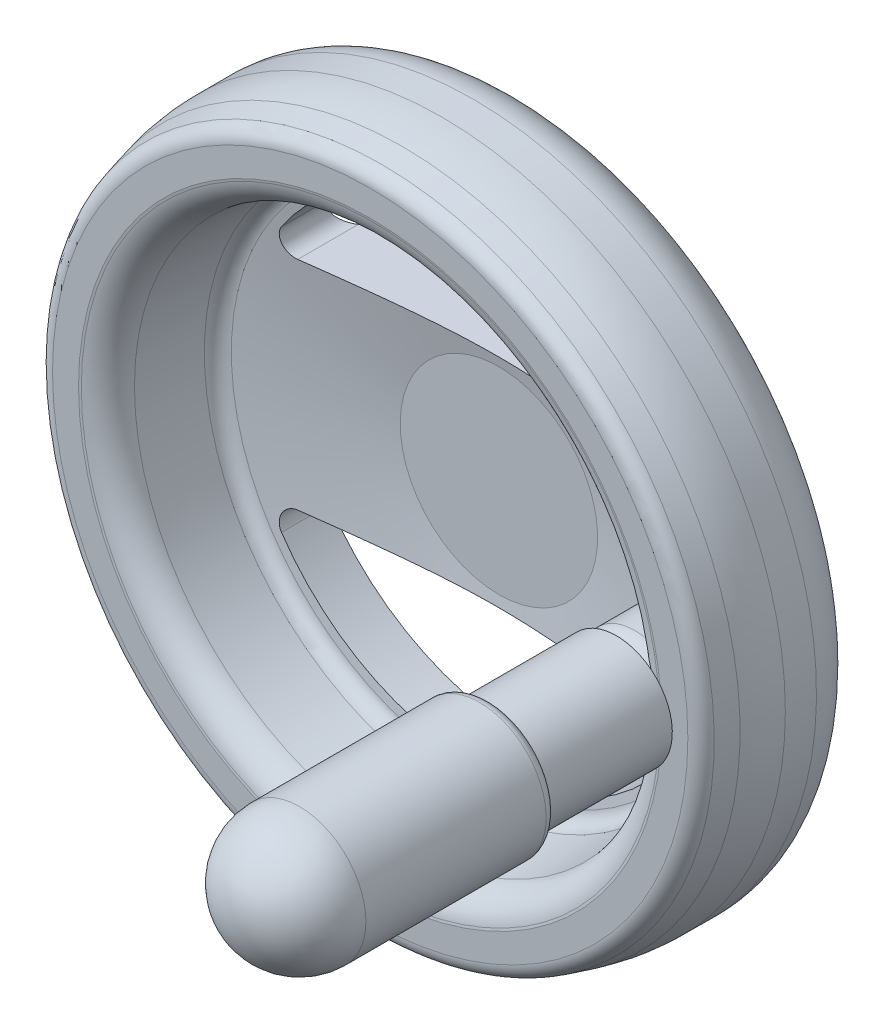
ISO-10303-21;
HEADER;
FILE_DESCRIPTION(('STEP AP214'),'2;1');
FILE_NAME('part.step','',(''),(''),'','','');
FILE_SCHEMA(('AUTOMOTIVE_DESIGN { 1 0 10303 214 1 1 1 1 }'));
ENDSEC;
DATA;
#1=APPLICATION_CONTEXT('core data for automotive mechanical design processes');
#2=APPLICATION_PROTOCOL_DEFINITION('international standard','automotive_design',2000,#1);
#3=PRODUCT_CONTEXT('',#1,'mechanical');
#4=PRODUCT('Part','Part','',(#3));
#5=PRODUCT_RELATED_PRODUCT_CATEGORY('part','',(#4));
#6=PRODUCT_DEFINITION_FORMATION('','',#4);
#7=PRODUCT_DEFINITION_CONTEXT('part definition',#1,'design');
#8=PRODUCT_DEFINITION('design','',#6,#7);
#9=PRODUCT_DEFINITION_SHAPE('','',#8);
#10=(LENGTH_UNIT() NAMED_UNIT(*) SI_UNIT(.MILLI.,.METRE.));
#11=(NAMED_UNIT(*) PLANE_ANGLE_UNIT() SI_UNIT($,.RADIAN.));
#12=(NAMED_UNIT(*) SI_UNIT($,.STERADIAN.) SOLID_ANGLE_UNIT());
#13=UNCERTAINTY_MEASURE_WITH_UNIT(LENGTH_MEASURE(1.E-05),#10,'distance_accuracy_value','');
#14=(GEOMETRIC_REPRESENTATION_CONTEXT(3) GLOBAL_UNCERTAINTY_ASSIGNED_CONTEXT((#13)) GLOBAL_UNIT_ASSIGNED_CONTEXT((#10,
#11,#12)) REPRESENTATION_CONTEXT('',''));
#15=CARTESIAN_POINT('',(0.,0.,0.));
#16=DIRECTION('',(0.,0.,1.));
#17=DIRECTION('',(1.,0.,0.));
#18=AXIS2_PLACEMENT_3D('',#15,#16,#17);
#19=CARTESIAN_POINT('',(0.,0.,16.2068560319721));
#20=DIRECTION('',(0.,0.,1.));
#21=DIRECTION('',(0.,-1.,0.));
#22=AXIS2_PLACEMENT_3D('',#19,#20,#21);
#23=CONICAL_SURFACE('',#22,26.3880782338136,0.89415818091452);
#24=CARTESIAN_POINT('',(-21.3989308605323,-12.65,14.9782932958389));
#25=CARTESIAN_POINT('',(-21.4610547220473,-12.6500133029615,15.0212499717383));
#26=CARTESIAN_POINT('',(-21.5224885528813,-12.6532558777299,15.0650938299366));
#27=CARTESIAN_POINT('',(-21.6436537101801,-12.6658686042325,15.1541543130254));
#28=CARTESIAN_POINT('',(-21.7033861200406,-12.6752347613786,15.1993700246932));
#29=CARTESIAN_POINT('',(-21.8797542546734,-12.7120473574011,15.3366260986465));
#30=CARTESIAN_POINT('',(-21.9934694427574,-12.7482069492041,15.4302116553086));
#31=CARTESIAN_POINT('',(-22.2118338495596,-12.8422167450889,15.6198135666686));
#32=CARTESIAN_POINT('',(-22.3163555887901,-12.9003261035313,15.7158456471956));
#33=CARTESIAN_POINT('',(-22.5121828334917,-13.0366120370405,15.9067871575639));
#34=CARTESIAN_POINT('',(-22.6035183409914,-13.1147418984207,16.0016986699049));
#35=CARTESIAN_POINT('',(-22.7204383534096,-13.2376134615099,16.132494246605));
#36=CARTESIAN_POINT('',(-22.7527823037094,-13.2745232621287,16.169864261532));
#37=CARTESIAN_POINT('',(-22.7836981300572,-13.3129175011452,16.2068560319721));
#38=B_SPLINE_CURVE_WITH_KNOTS('',3,(#24,#25,#26,#27,#28,#29,#30,#31,#32,#33,#34,#35,#36,#37),
.UNSPECIFIED.,.F.,.F.,(4,2,2,2,2,2,4),(0.,0.226402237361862,0.452656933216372,0.905496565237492,
1.36385890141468,1.82116133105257,2.00607794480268),.UNSPECIFIED.);
#39=CARTESIAN_POINT('',(-21.3989308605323,-12.65,14.9782932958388));
#40=VERTEX_POINT('',#39);
#41=CARTESIAN_POINT('',(-22.7836981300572,-13.3129175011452,16.2068560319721));
#42=VERTEX_POINT('',#41);
#43=EDGE_CURVE('E787',#40,#42,#38,.T.);
#44=ORIENTED_EDGE('',*,*,#43,.T.);
#45=CARTESIAN_POINT('',(0.,0.,16.2068560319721));
#46=DIRECTION('',(0.,0.,-1.));
#47=DIRECTION('',(0.,1.,0.));
#48=AXIS2_PLACEMENT_3D('',#45,#46,#47);
#49=CIRCLE('',#48,26.3880782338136);
#50=CARTESIAN_POINT('',(-22.7836981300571,13.3129175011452,16.2068560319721));
#51=VERTEX_POINT('',#50);
#52=EDGE_CURVE('E351',#42,#51,#49,.T.);
#53=ORIENTED_EDGE('',*,*,#52,.T.);
#54=CARTESIAN_POINT('',(-22.7836981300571,13.3129175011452,16.2068560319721));
#55=CARTESIAN_POINT('',(-22.7459774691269,13.2660802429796,16.1617237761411));
#56=CARTESIAN_POINT('',(-22.7061736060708,13.2214903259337,16.1160758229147));
#57=CARTESIAN_POINT('',(-22.6227539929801,13.136930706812,16.0240217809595));
#58=CARTESIAN_POINT('',(-22.5791393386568,13.096959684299,15.9776159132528));
#59=CARTESIAN_POINT('',(-22.4426527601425,12.9837735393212,15.8371959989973));
#60=CARTESIAN_POINT('',(-22.344496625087,12.9177249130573,15.7424058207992));
#61=CARTESIAN_POINT('',(-22.1302005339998,12.802506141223,15.5470962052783));
#62=CARTESIAN_POINT('',(-22.0133082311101,12.7547030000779,15.4466024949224));
#63=CARTESIAN_POINT('',(-21.7698021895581,12.6845298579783,15.2491942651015));
#64=CARTESIAN_POINT('',(-21.6432295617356,12.6620580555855,15.1522669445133));
#65=CARTESIAN_POINT('',(-21.4754888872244,12.6512453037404,15.0317500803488));
#66=CARTESIAN_POINT('',(-21.4373276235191,12.6500033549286,15.0048419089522));
#67=CARTESIAN_POINT('',(-21.3989308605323,12.65,14.9782932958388));
#68=B_SPLINE_CURVE_WITH_KNOTS('',3,(#54,#55,#56,#57,#58,#59,#60,#61,#62,#63,#64,#65,#66,#67),
.UNSPECIFIED.,.F.,.F.,(4,2,2,2,2,2,4),(0.,0.225422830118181,0.450781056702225,0.903602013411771,
1.38569343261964,1.8658404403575,2.00590562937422),.UNSPECIFIED.);
#69=CARTESIAN_POINT('',(-21.3989308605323,12.65,14.9782932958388));
#70=VERTEX_POINT('',#69);
#71=EDGE_CURVE('E418',#51,#70,#68,.T.);
#72=ORIENTED_EDGE('',*,*,#71,.T.);
#73=CARTESIAN_POINT('',(-21.3989308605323,12.65,14.9782932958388));
#74=CARTESIAN_POINT('',(-21.0186384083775,12.65,14.7153958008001));
#75=CARTESIAN_POINT('',(-20.6375100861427,12.65,14.4537006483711));
#76=CARTESIAN_POINT('',(-19.8733151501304,12.65,13.9331313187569));
#77=CARTESIAN_POINT('',(-19.4902484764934,12.65,13.6742572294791));
#78=CARTESIAN_POINT('',(-18.7216473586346,12.65,13.1595708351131));
#79=CARTESIAN_POINT('',(-18.3361112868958,12.65,12.903760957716));
#80=CARTESIAN_POINT('',(-17.5625467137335,12.65,12.39594076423));
#81=CARTESIAN_POINT('',(-17.1745182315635,12.65,12.1439304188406));
#82=CARTESIAN_POINT('',(-16.3842582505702,12.65,11.6370818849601));
#83=CARTESIAN_POINT('',(-15.9819422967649,12.65,11.3823751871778));
#84=CARTESIAN_POINT('',(-15.1738233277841,12.65,10.8785548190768));
#85=CARTESIAN_POINT('',(-14.7680203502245,12.65,10.629441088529));
#86=CARTESIAN_POINT('',(-13.9524762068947,12.65,10.1379618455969));
#87=CARTESIAN_POINT('',(-13.5427360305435,12.65,9.89559469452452));
#88=CARTESIAN_POINT('',(-12.7185869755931,12.65,9.41892431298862));
#89=CARTESIAN_POINT('',(-12.3041781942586,12.65,9.18462091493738));
#90=CARTESIAN_POINT('',(-11.5582035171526,12.65,8.77436341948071));
#91=CARTESIAN_POINT('',(-11.2276601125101,12.65,8.59655215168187));
#92=CARTESIAN_POINT('',(-10.562819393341,12.65,8.24809998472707));
#93=CARTESIAN_POINT('',(-10.228522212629,12.65,8.07745883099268));
#94=CARTESIAN_POINT('',(-9.55558868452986,12.65,7.7445430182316));
#95=CARTESIAN_POINT('',(-9.21695046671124,12.65,7.58227212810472));
#96=CARTESIAN_POINT('',(-8.53505086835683,12.65,7.26771912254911));
#97=CARTESIAN_POINT('',(-8.19178952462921,12.65,7.11543692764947));
#98=CARTESIAN_POINT('',(-7.50356641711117,12.65,6.8241046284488));
#99=CARTESIAN_POINT('',(-7.15865281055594,12.65,6.68494128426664));
#100=CARTESIAN_POINT('',(-6.4635673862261,12.65,6.42029618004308));
#101=CARTESIAN_POINT('',(-6.1133953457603,12.65,6.29481500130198));
#102=CARTESIAN_POINT('',(-5.40793811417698,12.65,6.06001430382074));
#103=CARTESIAN_POINT('',(-5.05265702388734,12.65,5.95068253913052));
#104=CARTESIAN_POINT('',(-4.33688412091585,12.65,5.75067661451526));
#105=CARTESIAN_POINT('',(-3.97639322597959,12.65,5.65999921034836));
#106=CARTESIAN_POINT('',(-3.37230197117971,12.65,5.52673921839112));
#107=CARTESIAN_POINT('',(-3.13000345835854,12.65,5.47822155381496));
#108=CARTESIAN_POINT('',(-2.64360354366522,12.65,5.39131209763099));
#109=CARTESIAN_POINT('',(-2.39950229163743,12.65,5.35291947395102));
#110=CARTESIAN_POINT('',(-1.90987765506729,12.65,5.28689267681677));
#111=CARTESIAN_POINT('',(-1.66435447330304,12.65,5.25925700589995));
#112=CARTESIAN_POINT('',(-1.17229451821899,12.65,5.21522541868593));
#113=CARTESIAN_POINT('',(-0.925757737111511,12.65,5.19882958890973));
#114=CARTESIAN_POINT('',(-0.432687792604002,12.65,5.17760598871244));
#115=CARTESIAN_POINT('',(-0.18615564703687,12.65,5.17275469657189));
#116=CARTESIAN_POINT('',(0.30686089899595,12.65,5.17464369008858));
#117=CARTESIAN_POINT('',(0.553345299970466,12.65,5.18138384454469));
#118=CARTESIAN_POINT('',(1.04575797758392,12.65,5.2063292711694));
#119=CARTESIAN_POINT('',(1.29168619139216,12.65,5.2245357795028));
#120=CARTESIAN_POINT('',(1.78246843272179,12.65,5.27207762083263));
#121=CARTESIAN_POINT('',(2.02732239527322,12.65,5.30141361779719));
#122=CARTESIAN_POINT('',(2.58212830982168,12.65,5.3801637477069));
#123=CARTESIAN_POINT('',(2.89161629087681,12.65,5.43287205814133));
#124=CARTESIAN_POINT('',(3.50744705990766,12.65,5.55414172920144));
#125=CARTESIAN_POINT('',(3.81378955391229,12.65,5.62270455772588));
#126=CARTESIAN_POINT('',(4.7277144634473,12.65,5.8499289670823));
#127=CARTESIAN_POINT('',(5.33003314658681,12.65,6.03010213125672));
#128=CARTESIAN_POINT('',(6.22571394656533,12.65,6.33518139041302));
#129=CARTESIAN_POINT('',(6.52497577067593,12.65,6.44353339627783));
#130=CARTESIAN_POINT('',(7.11970616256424,12.65,6.67026158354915));
#131=CARTESIAN_POINT('',(7.41517471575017,12.65,6.78863780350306));
#132=CARTESIAN_POINT('',(8.00237682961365,12.65,7.03404345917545));
#133=CARTESIAN_POINT('',(8.29411139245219,12.65,7.16107051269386));
#134=CARTESIAN_POINT('',(8.87418813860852,12.65,7.42266411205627));
#135=CARTESIAN_POINT('',(9.16253014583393,12.65,7.55723104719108));
#136=CARTESIAN_POINT('',(9.98820656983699,12.65,7.95405711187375));
#137=CARTESIAN_POINT('',(10.5215789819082,12.65,8.22456823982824));
#138=CARTESIAN_POINT('',(11.5789925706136,12.65,8.7832668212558));
#139=CARTESIAN_POINT('',(12.103032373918,12.65,9.07145684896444));
#140=CARTESIAN_POINT('',(13.1437615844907,12.65,9.66184956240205));
#141=CARTESIAN_POINT('',(13.66044385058,12.65,9.96406479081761));
#142=CARTESIAN_POINT('',(14.6872579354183,12.65,10.579318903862));
#143=CARTESIAN_POINT('',(15.1973901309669,12.65,10.8923571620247));
#144=CARTESIAN_POINT('',(16.1878766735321,12.65,11.5118608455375));
#145=CARTESIAN_POINT('',(16.668485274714,12.65,11.8179208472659));
#146=CARTESIAN_POINT('',(17.6255631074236,12.65,12.4364605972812));
#147=CARTESIAN_POINT('',(18.1020322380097,12.65,12.7489405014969));
#148=CARTESIAN_POINT('',(19.0502926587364,12.65,13.3784114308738));
#149=CARTESIAN_POINT('',(19.5220925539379,12.65,13.6953895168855));
#150=CARTESIAN_POINT('',(20.4626557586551,12.65,14.3337448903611));
#151=CARTESIAN_POINT('',(20.9314192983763,12.65,14.6551218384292));
#152=CARTESIAN_POINT('',(21.3989308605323,12.65,14.9782932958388));
#153=B_SPLINE_CURVE_WITH_KNOTS('',3,(#73,#74,#75,#76,#77,#78,#79,#80,#81,#82,#83,#84,#85,#86,
#87,#88,#89,#90,#91,#92,#93,#94,#95,#96,#97,#98,#99,#100,#101,#102,#103,#104,#105,#106,#107,
#108,#109,#110,#111,#112,#113,#114,#115,#116,#117,#118,#119,#120,#121,#122,#123,#124,#125,#126,
#127,#128,#129,#130,#131,#132,#133,#134,#135,#136,#137,#138,#139,#140,#141,#142,#143,#144,#145,
#146,#147,#148,#149,#150,#151,#152),.UNSPECIFIED.,.F.,.F.,(4,2,2,2,2,2,2,2,2,2,2,2,2,2,2,2,2,2,
2,2,2,2,2,2,2,2,2,2,2,2,2,2,2,2,2,2,2,2,2,4),(0.,1.38695581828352,2.77395473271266,
4.1619881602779,5.55001087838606,6.9784691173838,8.40691196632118,9.83500477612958,
11.2630678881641,12.3889979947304,13.5148880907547,14.6412807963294,15.7676645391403,
16.8832080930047,17.9987990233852,19.1135396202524,20.2280861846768,20.969223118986,
21.7102991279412,22.4512719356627,23.1922504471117,23.9317179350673,24.6711770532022,
25.4107159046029,26.1502988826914,27.0916477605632,28.0330838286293,29.9164428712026,
30.871154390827,31.8258695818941,32.7803229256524,33.7348255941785,35.5284895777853,
37.3224153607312,39.11797758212,40.9134360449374,42.6227370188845,44.3320795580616,
46.0372310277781,47.7422516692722),.UNSPECIFIED.);
#154=CARTESIAN_POINT('',(21.3989308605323,12.65,14.9782932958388));
#155=VERTEX_POINT('',#154);
#156=EDGE_CURVE('E610',#70,#155,#153,.T.);
#157=ORIENTED_EDGE('',*,*,#156,.T.);
#158=CARTESIAN_POINT('',(21.3989308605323,12.65,14.9782932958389));
#159=CARTESIAN_POINT('',(21.4610547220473,12.6500133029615,15.0212499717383));
#160=CARTESIAN_POINT('',(21.5224885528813,12.6532558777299,15.0650938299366));
#161=CARTESIAN_POINT('',(21.6436537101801,12.6658686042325,15.1541543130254));
#162=CARTESIAN_POINT('',(21.7033861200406,12.6752347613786,15.1993700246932));
#163=CARTESIAN_POINT('',(21.8797542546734,12.7120473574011,15.3366260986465));
#164=CARTESIAN_POINT('',(21.9934694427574,12.7482069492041,15.4302116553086));
#165=CARTESIAN_POINT('',(22.2118338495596,12.8422167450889,15.6198135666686));
#166=CARTESIAN_POINT('',(22.3163555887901,12.9003261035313,15.7158456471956));
#167=CARTESIAN_POINT('',(22.5121828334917,13.0366120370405,15.9067871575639));
#168=CARTESIAN_POINT('',(22.6035183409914,13.1147418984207,16.0016986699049));
#169=CARTESIAN_POINT('',(22.7204383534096,13.2376134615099,16.132494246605));
#170=CARTESIAN_POINT('',(22.7527823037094,13.2745232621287,16.169864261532));
#171=CARTESIAN_POINT('',(22.7836981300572,13.3129175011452,16.2068560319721));
#172=B_SPLINE_CURVE_WITH_KNOTS('',3,(#158,#159,#160,#161,#162,#163,#164,#165,#166,#167,#168,
#169,#170,#171),.UNSPECIFIED.,.F.,.F.,(4,2,2,2,2,2,4),(0.,0.226402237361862,0.452656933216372,
0.905496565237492,1.36385890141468,1.82116133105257,2.00607794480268),.UNSPECIFIED.);
#173=CARTESIAN_POINT('',(22.7836981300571,13.3129175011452,16.2068560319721));
#174=VERTEX_POINT('',#173);
#175=EDGE_CURVE('E617',#155,#174,#172,.T.);
#176=ORIENTED_EDGE('',*,*,#175,.T.);
#177=CARTESIAN_POINT('',(0.,0.,16.2068560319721));
#178=DIRECTION('',(0.,0.,-1.));
#179=DIRECTION('',(0.,1.,0.));
#180=AXIS2_PLACEMENT_3D('',#177,#178,#179);
#181=CIRCLE('',#180,26.3880782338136);
#182=CARTESIAN_POINT('',(22.7836981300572,-13.3129175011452,16.2068560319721));
#183=VERTEX_POINT('',#182);
#184=EDGE_CURVE('E326',#174,#183,#181,.T.);
#185=ORIENTED_EDGE('',*,*,#184,.T.);
#186=CARTESIAN_POINT('',(22.7836981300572,-13.3129175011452,16.2068560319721));
#187=CARTESIAN_POINT('',(22.745977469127,-13.2660802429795,16.1617237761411));
#188=CARTESIAN_POINT('',(22.7061736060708,-13.2214903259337,16.1160758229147));
#189=CARTESIAN_POINT('',(22.6227539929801,-13.1369307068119,16.0240217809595));
#190=CARTESIAN_POINT('',(22.5791393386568,-13.096959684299,15.9776159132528));
#191=CARTESIAN_POINT('',(22.4426527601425,-12.9837735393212,15.8371959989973));
#192=CARTESIAN_POINT('',(22.344496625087,-12.9177249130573,15.7424058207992));
#193=CARTESIAN_POINT('',(22.1302005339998,-12.802506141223,15.5470962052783));
#194=CARTESIAN_POINT('',(22.0133082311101,-12.7547030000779,15.4466024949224));
#195=CARTESIAN_POINT('',(21.7698021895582,-12.6845298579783,15.2491942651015));
#196=CARTESIAN_POINT('',(21.6432295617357,-12.6620580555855,15.1522669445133));
#197=CARTESIAN_POINT('',(21.4754888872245,-12.6512453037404,15.0317500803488));
#198=CARTESIAN_POINT('',(21.4373276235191,-12.6500033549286,15.0048419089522));
#199=CARTESIAN_POINT('',(21.3989308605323,-12.65,14.9782932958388));
#200=B_SPLINE_CURVE_WITH_KNOTS('',3,(#186,#187,#188,#189,#190,#191,#192,#193,#194,#195,#196,
#197,#198,#199),.UNSPECIFIED.,.F.,.F.,(4,2,2,2,2,2,4),(0.,0.225422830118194,0.450781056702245,
0.903602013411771,1.38569343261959,1.86584044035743,2.00590562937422),.UNSPECIFIED.);
#201=CARTESIAN_POINT('',(21.3989308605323,-12.65,14.9782932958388));
#202=VERTEX_POINT('',#201);
#203=EDGE_CURVE('E380',#183,#202,#200,.T.);
#204=ORIENTED_EDGE('',*,*,#203,.T.);
#205=CARTESIAN_POINT('',(21.3989308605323,-12.65,14.9782932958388));
#206=CARTESIAN_POINT('',(21.0186384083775,-12.65,14.7153958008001));
#207=CARTESIAN_POINT('',(20.6375100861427,-12.65,14.4537006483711));
#208=CARTESIAN_POINT('',(19.8733151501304,-12.65,13.9331313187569));
#209=CARTESIAN_POINT('',(19.4902484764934,-12.65,13.6742572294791));
#210=CARTESIAN_POINT('',(18.7216473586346,-12.65,13.1595708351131));
#211=CARTESIAN_POINT('',(18.3361112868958,-12.65,12.903760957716));
#212=CARTESIAN_POINT('',(17.5625467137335,-12.65,12.39594076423));
#213=CARTESIAN_POINT('',(17.1745182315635,-12.65,12.1439304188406));
#214=CARTESIAN_POINT('',(16.3842582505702,-12.65,11.6370818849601));
#215=CARTESIAN_POINT('',(15.9819422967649,-12.65,11.3823751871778));
#216=CARTESIAN_POINT('',(15.1738233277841,-12.65,10.8785548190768));
#217=CARTESIAN_POINT('',(14.7680203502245,-12.65,10.629441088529));
#218=CARTESIAN_POINT('',(13.9524762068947,-12.65,10.1379618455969));
#219=CARTESIAN_POINT('',(13.5427360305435,-12.65,9.89559469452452));
#220=CARTESIAN_POINT('',(12.7185869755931,-12.65,9.41892431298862));
#221=CARTESIAN_POINT('',(12.3041781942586,-12.65,9.18462091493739));
#222=CARTESIAN_POINT('',(11.5582035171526,-12.65,8.77436341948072));
#223=CARTESIAN_POINT('',(11.2276601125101,-12.65,8.59655215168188));
#224=CARTESIAN_POINT('',(10.562819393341,-12.65,8.24809998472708));
#225=CARTESIAN_POINT('',(10.228522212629,-12.65,8.07745883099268));
#226=CARTESIAN_POINT('',(9.55558868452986,-12.65,7.74454301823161));
#227=CARTESIAN_POINT('',(9.21695046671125,-12.65,7.58227212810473));
#228=CARTESIAN_POINT('',(8.53505086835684,-12.65,7.26771912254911));
#229=CARTESIAN_POINT('',(8.19178952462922,-12.65,7.11543692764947));
#230=CARTESIAN_POINT('',(7.50356641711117,-12.65,6.82410462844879));
#231=CARTESIAN_POINT('',(7.15865281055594,-12.65,6.68494128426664));
#232=CARTESIAN_POINT('',(6.46356738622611,-12.65,6.42029618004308));
#233=CARTESIAN_POINT('',(6.1133953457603,-12.65,6.29481500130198));
#234=CARTESIAN_POINT('',(5.40793811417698,-12.65,6.06001430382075));
#235=CARTESIAN_POINT('',(5.05265702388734,-12.65,5.95068253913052));
#236=CARTESIAN_POINT('',(4.33688412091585,-12.65,5.75067661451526));
#237=CARTESIAN_POINT('',(3.97639322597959,-12.65,5.65999921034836));
#238=CARTESIAN_POINT('',(3.37230197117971,-12.65,5.52673921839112));
#239=CARTESIAN_POINT('',(3.13000345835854,-12.65,5.47822155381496));
#240=CARTESIAN_POINT('',(2.64360354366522,-12.65,5.39131209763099));
#241=CARTESIAN_POINT('',(2.39950229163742,-12.65,5.35291947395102));
#242=CARTESIAN_POINT('',(1.90987765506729,-12.65,5.28689267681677));
#243=CARTESIAN_POINT('',(1.66435447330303,-12.65,5.25925700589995));
#244=CARTESIAN_POINT('',(1.17229451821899,-12.65,5.21522541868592));
#245=CARTESIAN_POINT('',(0.92575773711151,-12.65,5.19882958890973));
#246=CARTESIAN_POINT('',(0.432687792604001,-12.65,5.17760598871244));
#247=CARTESIAN_POINT('',(0.186155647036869,-12.65,5.17275469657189));
#248=CARTESIAN_POINT('',(-0.306860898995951,-12.65,5.17464369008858));
#249=CARTESIAN_POINT('',(-0.553345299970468,-12.65,5.18138384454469));
#250=CARTESIAN_POINT('',(-1.04575797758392,-12.65,5.2063292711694));
#251=CARTESIAN_POINT('',(-1.29168619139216,-12.65,5.2245357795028));
#252=CARTESIAN_POINT('',(-1.78246843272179,-12.65,5.27207762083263));
#253=CARTESIAN_POINT('',(-2.02732239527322,-12.65,5.3014136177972));
#254=CARTESIAN_POINT('',(-2.58212830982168,-12.65,5.3801637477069));
#255=CARTESIAN_POINT('',(-2.89161629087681,-12.65,5.43287205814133));
#256=CARTESIAN_POINT('',(-3.50744705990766,-12.65,5.55414172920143));
#257=CARTESIAN_POINT('',(-3.81378955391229,-12.65,5.62270455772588));
#258=CARTESIAN_POINT('',(-4.7277144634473,-12.65,5.8499289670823));
#259=CARTESIAN_POINT('',(-5.33003314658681,-12.65,6.03010213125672));
#260=CARTESIAN_POINT('',(-6.22571394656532,-12.65,6.33518139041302));
#261=CARTESIAN_POINT('',(-6.52497577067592,-12.65,6.44353339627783));
#262=CARTESIAN_POINT('',(-7.11970616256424,-12.65,6.67026158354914));
#263=CARTESIAN_POINT('',(-7.41517471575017,-12.65,6.78863780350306));
#264=CARTESIAN_POINT('',(-8.00237682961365,-12.65,7.03404345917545));
#265=CARTESIAN_POINT('',(-8.29411139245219,-12.65,7.16107051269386));
#266=CARTESIAN_POINT('',(-8.87418813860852,-12.65,7.42266411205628));
#267=CARTESIAN_POINT('',(-9.16253014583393,-12.65,7.55723104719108));
#268=CARTESIAN_POINT('',(-9.988206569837,-12.65,7.95405711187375));
#269=CARTESIAN_POINT('',(-10.5215789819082,-12.65,8.22456823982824));
#270=CARTESIAN_POINT('',(-11.5789925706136,-12.65,8.7832668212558));
#271=CARTESIAN_POINT('',(-12.103032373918,-12.65,9.07145684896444));
#272=CARTESIAN_POINT('',(-13.1437615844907,-12.65,9.66184956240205));
#273=CARTESIAN_POINT('',(-13.66044385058,-12.65,9.96406479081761));
#274=CARTESIAN_POINT('',(-14.6872579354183,-12.65,10.579318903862));
#275=CARTESIAN_POINT('',(-15.1973901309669,-12.65,10.8923571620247));
#276=CARTESIAN_POINT('',(-16.1878766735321,-12.65,11.5118608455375));
#277=CARTESIAN_POINT('',(-16.668485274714,-12.65,11.8179208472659));
#278=CARTESIAN_POINT('',(-17.6255631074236,-12.65,12.4364605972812));
#279=CARTESIAN_POINT('',(-18.1020322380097,-12.65,12.7489405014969));
#280=CARTESIAN_POINT('',(-19.0502926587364,-12.65,13.3784114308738));
#281=CARTESIAN_POINT('',(-19.5220925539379,-12.65,13.6953895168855));
#282=CARTESIAN_POINT('',(-20.4626557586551,-12.65,14.3337448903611));
#283=CARTESIAN_POINT('',(-20.9314192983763,-12.65,14.6551218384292));
#284=CARTESIAN_POINT('',(-21.3989308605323,-12.65,14.9782932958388));
#285=B_SPLINE_CURVE_WITH_KNOTS('',3,(#205,#206,#207,#208,#209,#210,#211,#212,#213,#214,#215,
#216,#217,#218,#219,#220,#221,#222,#223,#224,#225,#226,#227,#228,#229,#230,#231,#232,#233,#234,
#235,#236,#237,#238,#239,#240,#241,#242,#243,#244,#245,#246,#247,#248,#249,#250,#251,#252,#253,
#254,#255,#256,#257,#258,#259,#260,#261,#262,#263,#264,#265,#266,#267,#268,#269,#270,#271,#272,
#273,#274,#275,#276,#277,#278,#279,#280,#281,#282,#283,#284),.UNSPECIFIED.,.F.,.F.,(4,2,2,2,2,2,
2,2,2,2,2,2,2,2,2,2,2,2,2,2,2,2,2,2,2,2,2,2,2,2,2,2,2,2,2,2,2,2,2,4),(0.,1.38695581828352,
2.77395473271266,4.16198816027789,5.55001087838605,6.9784691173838,8.40691196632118,
9.83500477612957,11.2630678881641,12.3889979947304,13.5148880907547,14.6412807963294,
15.7676645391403,16.8832080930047,17.9987990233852,19.1135396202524,20.2280861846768,
20.969223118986,21.7102991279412,22.4512719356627,23.1922504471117,23.9317179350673,
24.6711770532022,25.4107159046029,26.1502988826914,27.0916477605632,28.0330838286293,
29.9164428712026,30.871154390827,31.8258695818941,32.7803229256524,33.7348255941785,
35.5284895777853,37.3224153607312,39.11797758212,40.9134360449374,42.6227370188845,
44.3320795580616,46.0372310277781,47.7422516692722),.UNSPECIFIED.);
#286=EDGE_CURVE('E624',#202,#40,#285,.T.);
#287=ORIENTED_EDGE('',*,*,#286,.T.);
#288=EDGE_LOOP('',(#44,#53,#72,#157,#176,#185,#204,#287));
#289=FACE_BOUND('',#288,.T.);
#290=CARTESIAN_POINT('',(0.,0.,5.05311614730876));
#291=DIRECTION('',(0.,0.,1.));
#292=DIRECTION('',(-1.,0.,0.));
#293=AXIS2_PLACEMENT_3D('',#290,#291,#292);
#294=CIRCLE('',#293,12.5);
#295=CARTESIAN_POINT('',(12.2839972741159,-2.31374392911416,5.05311614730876));
#296=VERTEX_POINT('',#295);
#297=CARTESIAN_POINT('',(12.2839972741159,2.31374392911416,5.05311614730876));
#298=VERTEX_POINT('',#297);
#299=EDGE_CURVE('E23',#296,#298,#294,.F.);
#300=ORIENTED_EDGE('',*,*,#299,.F.);
#301=CARTESIAN_POINT('',(11.8118799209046,-2.10403421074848,4.6498));
#302=CARTESIAN_POINT('',(11.8606482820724,-2.13123317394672,4.69219185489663));
#303=CARTESIAN_POINT('',(11.9100350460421,-2.15682112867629,4.73487609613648));
#304=CARTESIAN_POINT('',(12.0098808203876,-2.2049159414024,4.82069150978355));
#305=CARTESIAN_POINT('',(12.0603394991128,-2.22742373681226,4.86382254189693));
#306=CARTESIAN_POINT('',(12.2129388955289,-2.29048582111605,4.99356264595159));
#307=CARTESIAN_POINT('',(12.3164793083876,-2.32667546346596,5.08067196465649));
#308=CARTESIAN_POINT('',(12.5260802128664,-2.38829546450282,5.25528201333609));
#309=CARTESIAN_POINT('',(12.6321371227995,-2.41374024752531,5.34278205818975));
#310=CARTESIAN_POINT('',(12.8462018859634,-2.45470661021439,5.51782108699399));
#311=CARTESIAN_POINT('',(12.9542108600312,-2.47022228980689,5.6053600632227));
#312=CARTESIAN_POINT('',(13.2039230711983,-2.49509026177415,5.80611185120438));
#313=CARTESIAN_POINT('',(13.34606102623,-2.5012207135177,5.91918909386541));
#314=CARTESIAN_POINT('',(13.6312659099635,-2.49838009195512,6.14399148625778));
#315=CARTESIAN_POINT('',(13.7743330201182,-2.48940597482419,6.25571635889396));
#316=CARTESIAN_POINT('',(14.0605267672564,-2.45655568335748,6.47740253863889));
#317=CARTESIAN_POINT('',(14.2036530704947,-2.43265346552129,6.58736041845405));
#318=CARTESIAN_POINT('',(14.4885078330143,-2.36967168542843,6.80464286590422));
#319=CARTESIAN_POINT('',(14.6302369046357,-2.33059910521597,6.91196862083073));
#320=CARTESIAN_POINT('',(14.8618650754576,-2.25292033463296,7.08627806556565));
#321=CARTESIAN_POINT('',(14.9525750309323,-2.21891902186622,7.1542576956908));
#322=CARTESIAN_POINT('',(15.1323155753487,-2.14378101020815,7.28845563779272));
#323=CARTESIAN_POINT('',(15.2213465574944,-2.10264600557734,7.35467436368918));
#324=CARTESIAN_POINT('',(15.3969281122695,-2.01284395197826,7.48482249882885));
#325=CARTESIAN_POINT('',(15.4834837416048,-1.96419378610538,7.54875665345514));
#326=CARTESIAN_POINT('',(15.6534493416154,-1.85868270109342,7.67391543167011));
#327=CARTESIAN_POINT('',(15.736860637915,-1.801825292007,7.73514119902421));
#328=CARTESIAN_POINT('',(15.9218439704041,-1.6622133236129,7.87054871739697));
#329=CARTESIAN_POINT('',(16.0221051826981,-1.57663631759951,7.94366537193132));
#330=CARTESIAN_POINT('',(16.2122644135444,-1.38892579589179,8.08193289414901));
#331=CARTESIAN_POINT('',(16.3021743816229,-1.28681170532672,8.1470929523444));
#332=CARTESIAN_POINT('',(16.4432154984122,-1.09540499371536,8.2490742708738));
#333=CARTESIAN_POINT('',(16.4981695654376,-1.01047488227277,8.28873155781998));
#334=CARTESIAN_POINT('',(16.5967568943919,-0.831075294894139,8.35978358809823));
#335=CARTESIAN_POINT('',(16.6404084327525,-0.736621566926,8.39119167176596));
#336=CARTESIAN_POINT('',(16.7057979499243,-0.558509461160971,8.43820054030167));
#337=CARTESIAN_POINT('',(16.7301456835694,-0.476318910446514,8.4556868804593));
#338=CARTESIAN_POINT('',(16.7673586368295,-0.308071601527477,8.48240298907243));
#339=CARTESIAN_POINT('',(16.7802333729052,-0.222018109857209,8.49163960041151));
#340=CARTESIAN_POINT('',(16.793362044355,-0.0481067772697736,8.50105832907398));
#341=CARTESIAN_POINT('',(16.7935681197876,0.0397566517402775,8.5012061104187));
#342=CARTESIAN_POINT('',(16.7812161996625,0.214113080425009,8.49234474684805));
#343=CARTESIAN_POINT('',(16.7686542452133,0.300605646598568,8.48333276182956));
#344=CARTESIAN_POINT('',(16.7328810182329,0.465356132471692,8.45765096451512));
#345=CARTESIAN_POINT('',(16.7102480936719,0.543808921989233,8.44139698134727));
#346=CARTESIAN_POINT('',(16.6561160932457,0.695866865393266,8.40248616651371));
#347=CARTESIAN_POINT('',(16.6246136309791,0.769470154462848,8.37982688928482));
#348=CARTESIAN_POINT('',(16.5345277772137,0.951236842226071,8.31495488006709));
#349=CARTESIAN_POINT('',(16.4706995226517,1.05543361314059,8.26892749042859));
#350=CARTESIAN_POINT('',(16.3306790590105,1.25024841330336,8.16771884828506));
#351=CARTESIAN_POINT('',(16.2544520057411,1.34082674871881,8.11251178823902));
#352=CARTESIAN_POINT('',(16.1101862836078,1.49183391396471,8.00774184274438));
#353=CARTESIAN_POINT('',(16.0437086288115,1.55462570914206,7.9593686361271));
#354=CARTESIAN_POINT('',(15.9066955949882,1.6728742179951,7.85943277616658));
#355=CARTESIAN_POINT('',(15.8361578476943,1.72832658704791,7.80786825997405));
#356=CARTESIAN_POINT('',(15.6919623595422,1.83250662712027,7.70218399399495));
#357=CARTESIAN_POINT('',(15.6183010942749,1.88122642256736,7.64806134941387));
#358=CARTESIAN_POINT('',(15.4686386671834,1.97239268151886,7.53778544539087));
#359=CARTESIAN_POINT('',(15.3926367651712,2.01483713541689,7.48163154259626));
#360=CARTESIAN_POINT('',(15.1943854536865,2.11673273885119,7.33470448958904));
#361=CARTESIAN_POINT('',(15.0708055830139,2.17182636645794,7.24268850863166));
#362=CARTESIAN_POINT('',(14.8208019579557,2.26869670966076,7.05551835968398));
#363=CARTESIAN_POINT('',(14.6943766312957,2.3104658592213,6.96036244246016));
#364=CARTESIAN_POINT('',(14.4395766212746,2.38152909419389,6.76740588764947));
#365=CARTESIAN_POINT('',(14.3111980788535,2.41079385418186,6.66959959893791));
#366=CARTESIAN_POINT('',(14.053747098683,2.4571116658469,6.47210782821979));
#367=CARTESIAN_POINT('',(13.9246748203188,2.47416741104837,6.37242276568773));
#368=CARTESIAN_POINT('',(13.6619573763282,2.49654694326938,6.16795879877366));
#369=CARTESIAN_POINT('',(13.528315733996,2.50142389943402,6.06312609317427));
#370=CARTESIAN_POINT('',(13.2620005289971,2.49786159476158,5.85234847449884));
#371=CARTESIAN_POINT('',(13.1293273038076,2.4894178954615,5.74640320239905));
#372=CARTESIAN_POINT('',(12.8666142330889,2.4586030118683,5.53450756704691));
#373=CARTESIAN_POINT('',(12.7365650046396,2.43629683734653,5.42855952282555));
#374=CARTESIAN_POINT('',(12.47975436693,2.37675794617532,5.21700197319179));
#375=CARTESIAN_POINT('',(12.3529899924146,2.33953922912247,5.11139224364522));
#376=CARTESIAN_POINT('',(12.1573718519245,2.26808688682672,4.94640133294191));
#377=CARTESIAN_POINT('',(12.0868990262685,2.23936236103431,4.886532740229));
#378=CARTESIAN_POINT('',(11.9478537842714,2.17612944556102,4.76752777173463));
#379=CARTESIAN_POINT('',(11.8792829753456,2.14161632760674,4.70839203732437));
#380=CARTESIAN_POINT('',(11.8118799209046,2.10403421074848,4.6498));
#381=B_SPLINE_CURVE_WITH_KNOTS('',3,(#301,#302,#303,#304,#305,#306,#307,#308,#309,#310,#311,
#312,#313,#314,#315,#316,#317,#318,#319,#320,#321,#322,#323,#324,#325,#326,#327,#328,#329,#330,
#331,#332,#333,#334,#335,#336,#337,#338,#339,#340,#341,#342,#343,#344,#345,#346,#347,#348,#349,
#350,#351,#352,#353,#354,#355,#356,#357,#358,#359,#360,#361,#362,#363,#364,#365,#366,#367,#368,
#369,#370,#371,#372,#373,#374,#375,#376,#377,#378,#379,#380),.UNSPECIFIED.,.F.,.F.,(4,2,2,2,2,2,
2,2,2,2,2,2,2,2,2,2,2,2,2,2,2,2,2,2,2,2,2,2,2,2,2,2,2,2,2,2,2,2,2,4),(0.,0.210273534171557,
0.420482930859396,0.840146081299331,1.25924405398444,1.67859083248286,2.22310141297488,
2.76772173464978,3.31329486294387,3.85861719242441,4.2134478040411,4.56819425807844,
4.92215504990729,5.2759649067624,5.72703477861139,6.17757859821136,6.50251218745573,
6.82691702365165,7.08829625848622,7.34945848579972,7.6116072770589,7.87383737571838,
8.12263750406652,8.37153275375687,8.76103886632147,9.15165914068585,9.46159248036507,
9.7717084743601,10.0821842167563,10.3927591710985,10.8829179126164,11.3733544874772,
11.8649350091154,12.356407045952,12.8656621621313,13.3750869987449,13.8821406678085,
14.3887194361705,14.6790298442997,14.9695785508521),.UNSPECIFIED.);
#382=EDGE_CURVE('E29',#296,#298,#381,.T.);
#383=ORIENTED_EDGE('',*,*,#382,.T.);
#384=EDGE_LOOP('',(#300,#383));
#385=FACE_BOUND('',#384,.T.);
#386=ADVANCED_FACE('F14',(#289,#385),#23,.T.);
#387=CARTESIAN_POINT('',(0.,0.,-4.70383149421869));
#388=DIRECTION('',(0.,0.,-1.));
#389=DIRECTION('',(1.,0.,0.));
#390=AXIS2_PLACEMENT_3D('',#387,#388,#389);
#391=CYLINDRICAL_SURFACE('',#390,12.5);
#392=CARTESIAN_POINT('',(0.,0.,0.7));
#393=DIRECTION('',(0.,0.,-1.));
#394=DIRECTION('',(1.,0.,0.));
#395=AXIS2_PLACEMENT_3D('',#392,#393,#394);
#396=CIRCLE('',#395,12.5);
#397=CARTESIAN_POINT('',(12.5,0.,0.7));
#398=VERTEX_POINT('',#397);
#399=EDGE_CURVE('E744',#398,#398,#396,.T.);
#400=ORIENTED_EDGE('',*,*,#399,.F.);
#401=EDGE_LOOP('',(#400));
#402=FACE_BOUND('',#401,.T.);
#403=ORIENTED_EDGE('',*,*,#299,.T.);
#404=CARTESIAN_POINT('',(12.2839972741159,2.31374392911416,5.05311614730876));
#405=CARTESIAN_POINT('',(12.2890327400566,2.28699731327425,4.98776147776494));
#406=CARTESIAN_POINT('',(12.2944993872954,2.25750668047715,4.92360244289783));
#407=CARTESIAN_POINT('',(12.3061269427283,2.19324428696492,4.79806136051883));
#408=CARTESIAN_POINT('',(12.3122877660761,2.15847317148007,4.73667897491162));
#409=CARTESIAN_POINT('',(12.331541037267,2.04665705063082,4.55744161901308));
#410=CARTESIAN_POINT('',(12.3454213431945,1.96202301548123,4.44428652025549));
#411=CARTESIAN_POINT('',(12.373691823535,1.7750138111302,4.23388329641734));
#412=CARTESIAN_POINT('',(12.3880820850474,1.67263559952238,4.13663790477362));
#413=CARTESIAN_POINT('',(12.4157688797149,1.45290072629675,3.96066781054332));
#414=CARTESIAN_POINT('',(12.4290655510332,1.33554596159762,3.8819407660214));
#415=CARTESIAN_POINT('',(12.4531106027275,1.08877040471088,3.74510939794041));
#416=CARTESIAN_POINT('',(12.4638530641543,0.959322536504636,3.68705282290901));
#417=CARTESIAN_POINT('',(12.4815345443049,0.692233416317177,3.59358674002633));
#418=CARTESIAN_POINT('',(12.4884736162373,0.554592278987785,3.55817691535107));
#419=CARTESIAN_POINT('',(12.4976802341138,0.277345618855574,3.51152043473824));
#420=CARTESIAN_POINT('',(12.5000193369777,0.137804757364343,3.49990353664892));
#421=CARTESIAN_POINT('',(12.4999804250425,-0.141254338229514,3.5000976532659));
#422=CARTESIAN_POINT('',(12.4976027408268,-0.280772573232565,3.51190702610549));
#423=CARTESIAN_POINT('',(12.4884503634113,-0.554183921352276,3.55830088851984));
#424=CARTESIAN_POINT('',(12.4817255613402,-0.68812272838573,3.59262702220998));
#425=CARTESIAN_POINT('',(12.4646585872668,-0.948311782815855,3.68274790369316));
#426=CARTESIAN_POINT('',(12.4543165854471,-1.07456239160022,3.73854164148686));
#427=CARTESIAN_POINT('',(12.4310091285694,-1.31720808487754,3.87062288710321));
#428=CARTESIAN_POINT('',(12.4180184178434,-1.43349170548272,3.94711019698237));
#429=CARTESIAN_POINT('',(12.3908740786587,-1.65177215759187,4.11828094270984));
#430=CARTESIAN_POINT('',(12.3767201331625,-1.75376507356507,4.21296934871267));
#431=CARTESIAN_POINT('',(12.3554156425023,-1.89636282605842,4.36930743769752));
#432=CARTESIAN_POINT('',(12.3481195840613,-1.94318299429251,4.42539593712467));
#433=CARTESIAN_POINT('',(12.3338524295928,-2.03177078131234,4.5414963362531));
#434=CARTESIAN_POINT('',(12.3268813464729,-2.07353819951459,4.60150839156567));
#435=CARTESIAN_POINT('',(12.3134755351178,-2.15172069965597,4.72506922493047));
#436=CARTESIAN_POINT('',(12.3070414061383,-2.18812983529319,4.78862182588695));
#437=CARTESIAN_POINT('',(12.2949141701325,-2.25526771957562,4.91873381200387));
#438=CARTESIAN_POINT('',(12.289221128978,-2.28599596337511,4.9852934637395));
#439=CARTESIAN_POINT('',(12.2839972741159,-2.31374392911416,5.05311614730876));
#440=B_SPLINE_CURVE_WITH_KNOTS('',3,(#404,#405,#406,#407,#408,#409,#410,#411,#412,#413,#414,
#415,#416,#417,#418,#419,#420,#421,#422,#423,#424,#425,#426,#427,#428,#429,#430,#431,#432,#433,
#434,#435,#436,#437,#438,#439),.UNSPECIFIED.,.F.,.F.,(4,2,2,2,2,2,2,2,2,2,2,2,2,2,2,2,2,4),(0.,
0.212250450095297,0.42447498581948,0.848250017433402,1.27209778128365,1.69589191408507,
2.12065874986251,2.54541964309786,2.96351900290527,3.3815890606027,3.79494419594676,
4.20827988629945,4.62575839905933,5.04335107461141,5.26339318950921,5.48344403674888,
5.70373727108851,5.92405007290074),.UNSPECIFIED.);
#441=EDGE_CURVE('E9',#298,#296,#440,.T.);
#442=ORIENTED_EDGE('',*,*,#441,.T.);
#443=EDGE_LOOP('',(#403,#442));
#444=FACE_BOUND('',#443,.T.);
#445=ADVANCED_FACE('F689',(#402,#444),#391,.T.);
#446=CARTESIAN_POINT('',(29.,0.,33.2));
#447=DIRECTION('',(0.,0.,-1.));
#448=DIRECTION('',(0.,1.,0.));
#449=AXIS2_PLACEMENT_3D('',#446,#447,#448);
#450=TOROIDAL_SURFACE('',#449,4.2,1.8);
#451=CARTESIAN_POINT('',(30.6761601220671,5.76111857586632,33.2));
#452=CARTESIAN_POINT('',(30.7059480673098,5.75244726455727,33.2481599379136));
#453=CARTESIAN_POINT('',(30.7369578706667,5.74116772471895,33.294989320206));
#454=CARTESIAN_POINT('',(30.8008570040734,5.71399772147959,33.3857792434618));
#455=CARTESIAN_POINT('',(30.8337414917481,5.69811874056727,33.429746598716));
#456=CARTESIAN_POINT('',(30.933707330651,5.64487432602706,33.5562676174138));
#457=CARTESIAN_POINT('',(31.0029129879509,5.60164089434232,33.6347145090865));
#458=CARTESIAN_POINT('',(31.1222333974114,5.51828977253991,33.7583522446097));
#459=CARTESIAN_POINT('',(31.1717108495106,5.48126584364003,33.8063746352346));
#460=CARTESIAN_POINT('',(31.2712263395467,5.40234334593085,33.8976094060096));
#461=CARTESIAN_POINT('',(31.3212644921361,5.36044376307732,33.9408207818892));
#462=CARTESIAN_POINT('',(31.4719915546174,5.22801287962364,34.0643305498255));
#463=CARTESIAN_POINT('',(31.5726915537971,5.13117834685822,34.1379051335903));
#464=CARTESIAN_POINT('',(31.7517457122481,4.94506324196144,34.2574365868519));
#465=CARTESIAN_POINT('',(31.8306722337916,4.85791259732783,34.3059835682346));
#466=CARTESIAN_POINT('',(31.9855051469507,4.67691643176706,34.3948959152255));
#467=CARTESIAN_POINT('',(32.0614097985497,4.58306713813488,34.4352566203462));
#468=CARTESIAN_POINT('',(32.2093597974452,4.38982890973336,34.5089751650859));
#469=CARTESIAN_POINT('',(32.2814060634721,4.29044130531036,34.5423346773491));
#470=CARTESIAN_POINT('',(32.4211196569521,4.08687545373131,34.6031213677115));
#471=CARTESIAN_POINT('',(32.4887858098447,3.9826959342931,34.6305469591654));
#472=CARTESIAN_POINT('',(32.6493058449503,3.72128500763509,34.6918239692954));
#473=CARTESIAN_POINT('',(32.7394256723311,3.56169671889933,34.7228268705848));
#474=CARTESIAN_POINT('',(32.9082571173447,3.23521266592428,34.7764231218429));
#475=CARTESIAN_POINT('',(32.9869639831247,3.06831389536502,34.7990129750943));
#476=CARTESIAN_POINT('',(33.1321341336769,2.72842101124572,34.8376545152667));
#477=CARTESIAN_POINT('',(33.1985893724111,2.5554229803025,34.853701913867));
#478=CARTESIAN_POINT('',(33.3184989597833,2.20463008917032,34.8807503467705));
#479=CARTESIAN_POINT('',(33.3719549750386,2.02683584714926,34.8917520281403));
#480=CARTESIAN_POINT('',(33.4662247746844,1.66421200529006,34.9100738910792));
#481=CARTESIAN_POINT('',(33.5067858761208,1.47931308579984,34.9173220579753));
#482=CARTESIAN_POINT('',(33.5735207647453,1.10684047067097,34.9287586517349));
#483=CARTESIAN_POINT('',(33.5996940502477,0.919266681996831,34.9329469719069));
#484=CARTESIAN_POINT('',(33.6374405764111,0.542670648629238,34.9388668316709));
#485=CARTESIAN_POINT('',(33.6490178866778,0.35364882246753,34.9405990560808));
#486=CARTESIAN_POINT('',(33.6575111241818,-0.0247321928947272,34.9418765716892));
#487=CARTESIAN_POINT('',(33.6544266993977,-0.214091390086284,34.9414218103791));
#488=CARTESIAN_POINT('',(33.6328597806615,-0.605655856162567,34.9381417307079));
#489=CARTESIAN_POINT('',(33.6132803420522,-0.807800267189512,34.9351474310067));
#490=CARTESIAN_POINT('',(33.5574365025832,-1.2097216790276,34.9260465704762));
#491=CARTESIAN_POINT('',(33.5211703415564,-1.40949842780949,34.9199396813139));
#492=CARTESIAN_POINT('',(33.4322821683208,-1.8053600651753,34.9036466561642));
#493=CARTESIAN_POINT('',(33.3796486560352,-2.00144225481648,34.893457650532));
#494=CARTESIAN_POINT('',(33.2586335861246,-2.3882898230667,34.8676070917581));
#495=CARTESIAN_POINT('',(33.190255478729,-2.57905635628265,34.8519467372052));
#496=CARTESIAN_POINT('',(33.0531328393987,-2.91785381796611,34.8170102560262));
#497=CARTESIAN_POINT('',(32.9869716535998,-3.06706637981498,34.7990028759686));
#498=CARTESIAN_POINT('',(32.8454480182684,-3.36022800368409,34.7569856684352));
#499=CARTESIAN_POINT('',(32.7700847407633,-3.50417659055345,34.7329753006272));
#500=CARTESIAN_POINT('',(32.6110214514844,-3.78548180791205,34.6775610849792));
#501=CARTESIAN_POINT('',(32.5273417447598,-3.9228533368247,34.6461750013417));
#502=CARTESIAN_POINT('',(32.3524095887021,-4.19007675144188,34.5742526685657));
#503=CARTESIAN_POINT('',(32.2611615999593,-4.31993299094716,34.5337217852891));
#504=CARTESIAN_POINT('',(32.0609092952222,-4.58555207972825,34.4358787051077));
#505=CARTESIAN_POINT('',(31.9510808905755,-4.72019973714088,34.377149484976));
#506=CARTESIAN_POINT('',(31.7819752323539,-4.91125842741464,34.2756717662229));
#507=CARTESIAN_POINT('',(31.7248471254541,-4.97315666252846,34.2395918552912));
#508=CARTESIAN_POINT('',(31.6095673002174,-5.09270339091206,34.1624008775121));
#509=CARTESIAN_POINT('',(31.5514158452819,-5.1503529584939,34.1212910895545));
#510=CARTESIAN_POINT('',(31.4063616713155,-5.28735403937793,34.0121924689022));
#511=CARTESIAN_POINT('',(31.3191359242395,-5.36374138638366,33.9408104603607));
#512=CARTESIAN_POINT('',(31.1464858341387,-5.50180113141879,33.7838796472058));
#513=CARTESIAN_POINT('',(31.0610543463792,-5.56355012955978,33.6984087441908));
#514=CARTESIAN_POINT('',(30.924797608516,-5.64924722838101,33.5444135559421));
#515=CARTESIAN_POINT('',(30.8723720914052,-5.67885122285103,33.4805071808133));
#516=CARTESIAN_POINT('',(30.7710499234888,-5.72811723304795,33.345539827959));
#517=CARTESIAN_POINT('',(30.7221859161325,-5.74769530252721,33.2744242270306));
#518=CARTESIAN_POINT('',(30.6761601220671,-5.76111857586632,33.2));
#519=B_SPLINE_CURVE_WITH_KNOTS('',3,(#451,#452,#453,#454,#455,#456,#457,#458,#459,#460,#461,
#462,#463,#464,#465,#466,#467,#468,#469,#470,#471,#472,#473,#474,#475,#476,#477,#478,#479,#480,
#481,#482,#483,#484,#485,#486,#487,#488,#489,#490,#491,#492,#493,#494,#495,#496,#497,#498,#499,
#500,#501,#502,#503,#504,#505,#506,#507,#508,#509,#510,#511,#512,#513,#514,#515,#516,#517,#518),
.UNSPECIFIED.,.F.,.F.,(4,2,2,2,2,2,2,2,2,2,2,2,2,2,2,2,2,2,2,2,2,2,2,2,2,2,2,2,2,2,2,2,2,4),(0.,
0.17163547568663,0.342846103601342,0.68073967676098,0.915252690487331,1.1498145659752,
1.62175863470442,2.00292112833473,2.38430001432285,2.76558768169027,3.1469771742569,
3.70382900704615,4.2609120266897,4.81835960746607,5.37573568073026,5.94344251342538,
6.51116914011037,7.07873743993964,7.64631936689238,8.25492939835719,8.86360364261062,
9.47270652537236,10.0816760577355,10.573899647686,11.0661675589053,11.557261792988,
12.0480686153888,12.5968709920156,12.8715722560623,13.1462038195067,13.5534597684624,
13.9585350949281,14.2210901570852,14.4858090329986),.UNSPECIFIED.);
#520=CARTESIAN_POINT('',(30.6761601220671,5.76111857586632,33.2));
#521=VERTEX_POINT('',#520);
#522=CARTESIAN_POINT('',(30.6761601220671,-5.76111857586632,33.2));
#523=VERTEX_POINT('',#522);
#524=EDGE_CURVE('E512',#521,#523,#519,.T.);
#525=ORIENTED_EDGE('',*,*,#524,.F.);
#526=CARTESIAN_POINT('',(29.,0.,33.2));
#527=DIRECTION('',(0.,0.,1.));
#528=DIRECTION('',(0.,-1.,0.));
#529=AXIS2_PLACEMENT_3D('',#526,#527,#528);
#530=CIRCLE('',#529,6.);
#531=EDGE_CURVE('E160',#523,#521,#530,.F.);
#532=ORIENTED_EDGE('',*,*,#531,.F.);
#533=EDGE_LOOP('',(#525,#532));
#534=FACE_BOUND('',#533,.T.);
#535=CARTESIAN_POINT('',(29.,0.,35.));
#536=DIRECTION('',(0.,0.,-1.));
#537=DIRECTION('',(0.,-1.,0.));
#538=AXIS2_PLACEMENT_3D('',#535,#536,#537);
#539=CIRCLE('',#538,4.2);
#540=CARTESIAN_POINT('',(29.,-4.2,35.));
#541=VERTEX_POINT('',#540);
#542=CARTESIAN_POINT('',(24.8,0.,35.));
#543=VERTEX_POINT('',#542);
#544=EDGE_CURVE('E37',#541,#543,#539,.T.);
#545=ORIENTED_EDGE('',*,*,#544,.T.);
#546=CARTESIAN_POINT('',(29.,0.,35.));
#547=DIRECTION('',(0.,0.,-1.));
#548=DIRECTION('',(-1.,0.,0.));
#549=AXIS2_PLACEMENT_3D('',#546,#547,#548);
#550=CIRCLE('',#549,4.19999999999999);
#551=CARTESIAN_POINT('',(29.,4.2,35.));
#552=VERTEX_POINT('',#551);
#553=EDGE_CURVE('E205',#543,#552,#550,.T.);
#554=ORIENTED_EDGE('',*,*,#553,.T.);
#555=CARTESIAN_POINT('',(29.,0.,35.));
#556=DIRECTION('',(0.,0.,-1.));
#557=DIRECTION('',(0.,1.,0.));
#558=AXIS2_PLACEMENT_3D('',#555,#556,#557);
#559=CIRCLE('',#558,4.2);
#560=EDGE_CURVE('E207',#552,#541,#559,.T.);
#561=ORIENTED_EDGE('',*,*,#560,.T.);
#562=EDGE_LOOP('',(#545,#554,#561));
#563=FACE_BOUND('',#562,.T.);
#564=ADVANCED_FACE('F204',(#534,#563),#450,.T.);
#565=CARTESIAN_POINT('',(0.,0.,31.4060347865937));
#566=DIRECTION('',(0.,0.,-1.));
#567=DIRECTION('',(0.,1.,0.));
#568=AXIS2_PLACEMENT_3D('',#565,#566,#567);
#569=TOROIDAL_SURFACE('',#568,34.3336218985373,3.6);
#570=CARTESIAN_POINT('',(30.6761601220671,-5.76111857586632,33.2));
#571=CARTESIAN_POINT('',(30.6273849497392,-5.77530049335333,33.1211928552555));
#572=CARTESIAN_POINT('',(30.5816886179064,-5.78793211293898,33.0402070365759));
#573=CARTESIAN_POINT('',(30.4968646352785,-5.81045182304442,32.874468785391));
#574=CARTESIAN_POINT('',(30.4577389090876,-5.82033911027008,32.7897152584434));
#575=CARTESIAN_POINT('',(30.3871954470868,-5.83754874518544,32.6187736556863));
#576=CARTESIAN_POINT('',(30.3556414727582,-5.84491763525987,32.5326464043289));
#577=CARTESIAN_POINT('',(30.2995651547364,-5.8576409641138,32.3580312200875));
#578=CARTESIAN_POINT('',(30.2750393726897,-5.8629963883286,32.2695444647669));
#579=CARTESIAN_POINT('',(30.2364864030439,-5.87123762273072,32.1047832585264));
#580=CARTESIAN_POINT('',(30.2214171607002,-5.87437868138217,32.0287632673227));
#581=CARTESIAN_POINT('',(30.1963946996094,-5.87952217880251,31.8751872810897));
#582=CARTESIAN_POINT('',(30.1864857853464,-5.88151477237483,31.7976237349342));
#583=CARTESIAN_POINT('',(30.1792715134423,-5.88296852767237,31.7197954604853));
#584=B_SPLINE_CURVE_WITH_KNOTS('',3,(#570,#571,#572,#573,#574,#575,#576,#577,#578,#579,#580,
#581,#582,#583),.UNSPECIFIED.,.F.,.F.,(4,2,2,2,2,2,4),(0.,0.281182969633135,0.562448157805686,
0.838191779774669,1.11380027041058,1.3463037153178,1.58077173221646),.UNSPECIFIED.);
#585=CARTESIAN_POINT('',(30.1792715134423,-5.88296852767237,31.7197954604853));
#586=VERTEX_POINT('',#585);
#587=EDGE_CURVE('E520',#523,#586,#584,.T.);
#588=ORIENTED_EDGE('',*,*,#587,.T.);
#589=CARTESIAN_POINT('',(0.,0.,31.7197954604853));
#590=DIRECTION('',(0.,0.,1.));
#591=DIRECTION('',(-1.,0.,0.));
#592=AXIS2_PLACEMENT_3D('',#589,#590,#591);
#593=CIRCLE('',#592,30.747320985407);
#594=CARTESIAN_POINT('',(30.1792715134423,5.88296852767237,31.7197954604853));
#595=VERTEX_POINT('',#594);
#596=EDGE_CURVE('E884',#586,#595,#593,.F.);
#597=ORIENTED_EDGE('',*,*,#596,.T.);
#598=CARTESIAN_POINT('',(30.1792715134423,5.88296852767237,31.7197954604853));
#599=CARTESIAN_POINT('',(30.1879164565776,5.88121949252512,31.8131314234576));
#600=CARTESIAN_POINT('',(30.2004481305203,5.87870326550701,31.9060945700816));
#601=CARTESIAN_POINT('',(30.2331330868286,5.8719427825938,32.0906530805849));
#602=CARTESIAN_POINT('',(30.2532899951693,5.86769770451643,32.1822477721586));
#603=CARTESIAN_POINT('',(30.3005923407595,5.85739017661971,32.3615651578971));
#604=CARTESIAN_POINT('',(30.3275915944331,5.85136535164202,32.4493286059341));
#605=CARTESIAN_POINT('',(30.3885029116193,5.83721157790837,32.6221992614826));
#606=CARTESIAN_POINT('',(30.4224111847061,5.82908378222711,32.7073078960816));
#607=CARTESIAN_POINT('',(30.4910071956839,5.81187963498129,32.8612425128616));
#608=CARTESIAN_POINT('',(30.5247435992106,5.80315045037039,32.9305332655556));
#609=CARTESIAN_POINT('',(30.5969698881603,5.783691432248,33.0670662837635));
#610=CARTESIAN_POINT('',(30.6354977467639,5.77294522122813,33.1342861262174));
#611=CARTESIAN_POINT('',(30.6761601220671,5.76111857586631,33.2));
#612=B_SPLINE_CURVE_WITH_KNOTS('',3,(#598,#599,#600,#601,#602,#603,#604,#605,#606,#607,#608,
#609,#610,#611),.UNSPECIFIED.,.F.,.F.,(4,2,2,2,2,2,4),(0.,0.281175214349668,0.562484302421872,
0.838226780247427,1.11381838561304,1.34630753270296,1.58077317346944),.UNSPECIFIED.);
#613=EDGE_CURVE('E521',#595,#521,#612,.T.);
#614=ORIENTED_EDGE('',*,*,#613,.T.);
#615=ORIENTED_EDGE('',*,*,#524,.T.);
#616=EDGE_LOOP('',(#588,#597,#614,#615));
#617=FACE_BOUND('',#616,.T.);
#618=CARTESIAN_POINT('',(0.,0.,34.9513426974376));
#619=DIRECTION('',(0.,0.,1.));
#620=DIRECTION('',(-1.,0.,0.));
#621=AXIS2_PLACEMENT_3D('',#618,#619,#620);
#622=CIRCLE('',#621,33.7084884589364);
#623=CARTESIAN_POINT('',(-33.7084884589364,0.,34.9513426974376));
#624=VERTEX_POINT('',#623);
#625=EDGE_CURVE('E882',#624,#624,#622,.T.);
#626=ORIENTED_EDGE('',*,*,#625,.T.);
#627=EDGE_LOOP('',(#626));
#628=FACE_BOUND('',#627,.T.);
#629=ADVANCED_FACE('F505',(#617,#628),#569,.T.);
#630=CARTESIAN_POINT('',(29.,0.,26.6));
#631=DIRECTION('',(0.,0.,1.));
#632=DIRECTION('',(0.,-1.,0.));
#633=AXIS2_PLACEMENT_3D('',#630,#631,#632);
#634=CYLINDRICAL_SURFACE('',#633,6.);
#635=ORIENTED_EDGE('',*,*,#587,.F.);
#636=ORIENTED_EDGE('',*,*,#531,.T.);
#637=ORIENTED_EDGE('',*,*,#613,.F.);
#638=CARTESIAN_POINT('',(30.1792715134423,5.88296852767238,31.7197954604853));
#639=CARTESIAN_POINT('',(30.1214154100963,5.89456507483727,31.0960777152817));
#640=CARTESIAN_POINT('',(30.0637104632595,5.90524557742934,30.4723290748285));
#641=CARTESIAN_POINT('',(29.9486039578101,5.92482587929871,29.2247807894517));
#642=CARTESIAN_POINT('',(29.8912023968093,5.93372569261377,28.6009811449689));
#643=CARTESIAN_POINT('',(29.7767028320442,5.94979618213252,27.3533318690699));
#644=CARTESIAN_POINT('',(29.7196048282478,5.9569668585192,26.729482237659));
#645=CARTESIAN_POINT('',(29.605712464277,5.96962251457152,25.4817331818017));
#646=CARTESIAN_POINT('',(29.5489181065,5.97510748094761,24.8578337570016));
#647=CARTESIAN_POINT('',(29.4922760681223,5.97977125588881,24.2339144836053));
#648=B_SPLINE_CURVE_WITH_KNOTS('',3,(#638,#639,#640,#641,#642,#643,#644,#645,#646,#647),
.UNSPECIFIED.,.F.,.F.,(4,2,2,2,4),(0.,1.87950718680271,3.75899955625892,5.63849172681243,
7.51799871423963),.UNSPECIFIED.);
#649=CARTESIAN_POINT('',(29.4922760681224,5.9797712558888,24.2339144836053));
#650=VERTEX_POINT('',#649);
#651=EDGE_CURVE('E568',#595,#650,#648,.T.);
#652=ORIENTED_EDGE('',*,*,#651,.T.);
#653=CARTESIAN_POINT('',(29.4922760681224,5.9797712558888,24.2339144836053));
#654=CARTESIAN_POINT('',(29.4877633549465,5.98013823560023,24.1841300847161));
#655=CARTESIAN_POINT('',(29.4810885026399,5.98068702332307,24.1345484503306));
#656=CARTESIAN_POINT('',(29.4635155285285,5.98207700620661,24.0361553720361));
#657=CARTESIAN_POINT('',(29.4526184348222,5.9829181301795,23.9873437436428));
#658=CARTESIAN_POINT('',(29.4267261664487,5.98481988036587,23.890929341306));
#659=CARTESIAN_POINT('',(29.411739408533,5.98588005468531,23.8433243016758));
#660=CARTESIAN_POINT('',(29.37781218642,5.98811711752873,23.7495603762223));
#661=CARTESIAN_POINT('',(29.3588715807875,5.9892940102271,23.7034015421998));
#662=CARTESIAN_POINT('',(29.2963784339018,5.99282142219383,23.5676081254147));
#663=CARTESIAN_POINT('',(29.24711826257,5.99517190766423,23.4805228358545));
#664=CARTESIAN_POINT('',(29.1350562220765,5.99874082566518,23.3155665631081));
#665=CARTESIAN_POINT('',(29.0722493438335,5.99995883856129,23.2376990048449));
#666=CARTESIAN_POINT('',(28.9332068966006,6.0000400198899,23.0912280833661));
#667=CARTESIAN_POINT('',(28.8566741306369,5.99884338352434,23.0229059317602));
#668=CARTESIAN_POINT('',(28.6935876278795,5.9927259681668,22.8997674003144));
#669=CARTESIAN_POINT('',(28.6070362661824,5.98780607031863,22.8449478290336));
#670=CARTESIAN_POINT('',(28.4283761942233,5.97336344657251,22.7514437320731));
#671=CARTESIAN_POINT('',(28.3364353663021,5.9639462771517,22.7124253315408));
#672=CARTESIAN_POINT('',(28.195137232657,5.94596268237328,22.6656263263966));
#673=CARTESIAN_POINT('',(28.1474093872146,5.93931406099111,22.6519713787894));
#674=CARTESIAN_POINT('',(28.0511658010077,5.92470164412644,22.6286882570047));
#675=CARTESIAN_POINT('',(28.0026498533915,5.91673749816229,22.6190611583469));
#676=CARTESIAN_POINT('',(27.9539057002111,5.90810347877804,22.6114933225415));
#677=B_SPLINE_CURVE_WITH_KNOTS('',3,(#653,#654,#655,#656,#657,#658,#659,#660,#661,#662,#663,
#664,#665,#666,#667,#668,#669,#670,#671,#672,#673,#674,#675,#676),.UNSPECIFIED.,.F.,.F.,(4,2,2,
2,2,2,2,2,2,2,2,4),(0.,0.149914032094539,0.299791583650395,0.449362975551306,0.598939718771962,
0.897682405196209,1.19653574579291,1.50288175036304,1.80915527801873,2.10856926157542,
2.25866534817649,2.40880148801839),.UNSPECIFIED.);
#678=CARTESIAN_POINT('',(27.9539057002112,5.90810347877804,22.6114933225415));
#679=VERTEX_POINT('',#678);
#680=EDGE_CURVE('E561',#650,#679,#677,.T.);
#681=ORIENTED_EDGE('',*,*,#680,.T.);
#682=CARTESIAN_POINT('',(27.9539057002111,5.90810347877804,22.6114933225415));
#683=CARTESIAN_POINT('',(27.7862920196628,5.87844291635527,22.5854705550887));
#684=CARTESIAN_POINT('',(27.6199550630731,5.84161839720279,22.5594087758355));
#685=CARTESIAN_POINT('',(27.2909958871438,5.75397455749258,22.5074010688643));
#686=CARTESIAN_POINT('',(27.1283735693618,5.70315560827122,22.4814551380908));
#687=CARTESIAN_POINT('',(26.8080422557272,5.58787107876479,22.4298790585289));
#688=CARTESIAN_POINT('',(26.6503318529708,5.52340944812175,22.4042488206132));
#689=CARTESIAN_POINT('',(26.3408962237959,5.38127779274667,22.3535020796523));
#690=CARTESIAN_POINT('',(26.1891709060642,5.30360796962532,22.3283855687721));
#691=CARTESIAN_POINT('',(25.8927248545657,5.13555110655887,22.2788688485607));
#692=CARTESIAN_POINT('',(25.7480070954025,5.04515872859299,22.2544689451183));
#693=CARTESIAN_POINT('',(25.4666352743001,4.85226122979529,22.2066091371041));
#694=CARTESIAN_POINT('',(25.3299842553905,4.7497515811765,22.1831495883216));
#695=CARTESIAN_POINT('',(25.0659039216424,4.53343124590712,22.1374257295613));
#696=CARTESIAN_POINT('',(24.9384675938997,4.41962931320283,22.1151605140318));
#697=CARTESIAN_POINT('',(24.6935864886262,4.1813869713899,22.072027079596));
#698=CARTESIAN_POINT('',(24.5761462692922,4.05694176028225,22.0511594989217));
#699=CARTESIAN_POINT('',(24.3528772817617,3.79909969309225,22.0111845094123));
#700=CARTESIAN_POINT('',(24.2469830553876,3.66576104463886,21.9920672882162));
#701=CARTESIAN_POINT('',(24.0468497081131,3.39046440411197,21.955685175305));
#702=CARTESIAN_POINT('',(23.9526051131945,3.24851050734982,21.9384194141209));
#703=CARTESIAN_POINT('',(23.7763614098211,2.95679942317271,21.9059303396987));
#704=CARTESIAN_POINT('',(23.6943729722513,2.80703558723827,21.8907088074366));
#705=CARTESIAN_POINT('',(23.5434120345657,2.5009516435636,21.8625316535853));
#706=CARTESIAN_POINT('',(23.4744348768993,2.34463390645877,21.8495752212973));
#707=CARTESIAN_POINT('',(23.344419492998,2.01222464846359,21.825046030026));
#708=CARTESIAN_POINT('',(23.2846504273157,1.83561799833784,21.8137020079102));
#709=CARTESIAN_POINT('',(23.1817610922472,1.47743750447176,21.7941056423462));
#710=CARTESIAN_POINT('',(23.1386424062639,1.2958631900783,21.7858535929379));
#711=CARTESIAN_POINT('',(23.0694882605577,0.929404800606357,21.7725905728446));
#712=CARTESIAN_POINT('',(23.0434499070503,0.744521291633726,21.7675790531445));
#713=CARTESIAN_POINT('',(23.0087071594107,0.373087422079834,21.760887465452));
#714=CARTESIAN_POINT('',(23.0000007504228,0.186537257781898,21.7592070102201));
#715=CARTESIAN_POINT('',(22.9999993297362,-0.166611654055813,21.7592066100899));
#716=CARTESIAN_POINT('',(23.0069438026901,-0.333213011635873,21.7605468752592));
#717=CARTESIAN_POINT('',(23.0346693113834,-0.665277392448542,21.7658885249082));
#718=CARTESIAN_POINT('',(23.055454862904,-0.830740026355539,21.7698907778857));
#719=CARTESIAN_POINT('',(23.1106845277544,-1.15917029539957,21.780495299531));
#720=CARTESIAN_POINT('',(23.1451196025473,-1.32213950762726,21.7870958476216));
#721=CARTESIAN_POINT('',(23.2273930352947,-1.64459904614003,21.8028051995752));
#722=CARTESIAN_POINT('',(23.2752363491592,-1.80408806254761,21.811914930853));
#723=CARTESIAN_POINT('',(23.3839138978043,-2.11829984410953,21.8325079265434));
#724=CARTESIAN_POINT('',(23.4447395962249,-2.27302566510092,21.8439896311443));
#725=CARTESIAN_POINT('',(23.5789596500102,-2.57680131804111,21.8691808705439));
#726=CARTESIAN_POINT('',(23.6523583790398,-2.72584915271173,21.8828911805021));
#727=CARTESIAN_POINT('',(23.8111449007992,-3.01716720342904,21.9123587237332));
#728=CARTESIAN_POINT('',(23.8965305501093,-3.15943862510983,21.9281155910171));
#729=CARTESIAN_POINT('',(24.0786731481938,-3.43627658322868,21.961487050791));
#730=CARTESIAN_POINT('',(24.1754302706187,-3.57084300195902,21.97910167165));
#731=CARTESIAN_POINT('',(24.3805453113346,-3.83256196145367,22.0161544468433));
#732=CARTESIAN_POINT('',(24.4890007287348,-3.9596359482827,22.0356077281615));
#733=CARTESIAN_POINT('',(24.7159568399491,-4.204139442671,22.0759799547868));
#734=CARTESIAN_POINT('',(24.8344542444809,-4.32157208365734,22.0968984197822));
#735=CARTESIAN_POINT('',(25.0807887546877,-4.54616180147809,22.1400098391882));
#736=CARTESIAN_POINT('',(25.2086337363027,-4.65331003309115,22.1622038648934));
#737=CARTESIAN_POINT('',(25.472631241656,-4.85648058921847,22.2076278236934));
#738=CARTESIAN_POINT('',(25.6087808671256,-4.95250676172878,22.2308573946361));
#739=CARTESIAN_POINT('',(25.8908207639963,-5.1343574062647,22.278544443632));
#740=CARTESIAN_POINT('',(26.0368356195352,-5.2199850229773,22.3030159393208));
#741=CARTESIAN_POINT('',(26.3354346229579,-5.37853646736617,22.3525972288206));
#742=CARTESIAN_POINT('',(26.4880163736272,-5.45146488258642,22.3777067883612));
#743=CARTESIAN_POINT('',(26.7984817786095,-5.58406412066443,22.4283267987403));
#744=CARTESIAN_POINT('',(26.9563569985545,-5.64375497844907,22.4538365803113));
#745=CARTESIAN_POINT('',(27.2764707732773,-5.7495945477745,22.5050884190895));
#746=CARTESIAN_POINT('',(27.4387067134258,-5.79575118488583,22.5308303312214));
#747=CARTESIAN_POINT('',(27.6607579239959,-5.84893313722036,22.5657467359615));
#748=CARTESIAN_POINT('',(27.7191764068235,-5.86200273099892,22.5749035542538));
#749=CARTESIAN_POINT('',(27.8363111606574,-5.88637413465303,22.5932058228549));
#750=CARTESIAN_POINT('',(27.8950270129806,-5.89767795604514,22.6023512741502));
#751=CARTESIAN_POINT('',(27.9539057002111,-5.90810347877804,22.6114933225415));
#752=B_SPLINE_CURVE_WITH_KNOTS('',3,(#682,#683,#684,#685,#686,#687,#688,#689,#690,#691,#692,
#693,#694,#695,#696,#697,#698,#699,#700,#701,#702,#703,#704,#705,#706,#707,#708,#709,#710,#711,
#712,#713,#714,#715,#716,#717,#718,#719,#720,#721,#722,#723,#724,#725,#726,#727,#728,#729,#730,
#731,#732,#733,#734,#735,#736,#737,#738,#739,#740,#741,#742,#743,#744,#745,#746,#747,#748,#749,
#750,#751),.UNSPECIFIED.,.F.,.F.,(4,2,2,2,2,2,2,2,2,2,2,2,2,2,2,2,2,2,2,2,2,2,2,2,2,2,2,2,2,2,2,
2,2,2,4),(0.,0.516430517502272,1.03284733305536,1.54911484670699,2.06537448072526,
2.58185137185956,3.09852186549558,3.61479491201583,4.13130213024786,4.64470942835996,
5.15787455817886,5.67148390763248,6.18490905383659,6.74444002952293,7.30402420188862,
7.86351354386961,8.42293784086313,8.92260535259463,9.42243596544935,9.92193614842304,
10.4216211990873,10.9209786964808,11.4205102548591,11.9199526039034,12.4194025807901,
12.9233947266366,13.427222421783,13.9314796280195,14.4355618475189,14.9480511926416,
15.4603550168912,15.9718781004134,16.483101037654,16.6647579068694,16.8462063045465),.UNSPECIFIED.);
#753=CARTESIAN_POINT('',(27.9539057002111,-5.90810347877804,22.6114933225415));
#754=VERTEX_POINT('',#753);
#755=EDGE_CURVE('E575',#679,#754,#752,.T.);
#756=ORIENTED_EDGE('',*,*,#755,.T.);
#757=CARTESIAN_POINT('',(27.9539057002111,-5.90810347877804,22.6114933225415));
#758=CARTESIAN_POINT('',(28.0026384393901,-5.91673763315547,22.6190544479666));
#759=CARTESIAN_POINT('',(28.0511627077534,-5.92470212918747,22.6286854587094));
#760=CARTESIAN_POINT('',(28.1474236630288,-5.93931527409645,22.6519768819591));
#761=CARTESIAN_POINT('',(28.1951605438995,-5.94596425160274,22.6656362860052));
#762=CARTESIAN_POINT('',(28.2894075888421,-5.95796225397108,22.6968471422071));
#763=CARTESIAN_POINT('',(28.3359199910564,-5.96331382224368,22.7143908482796));
#764=CARTESIAN_POINT('',(28.4274650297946,-5.97279875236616,22.753232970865));
#765=CARTESIAN_POINT('',(28.4724976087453,-5.97693206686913,22.7745315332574));
#766=CARTESIAN_POINT('',(28.6048386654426,-5.9876246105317,22.8438051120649));
#767=CARTESIAN_POINT('',(28.6895245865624,-5.99249284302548,22.8972026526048));
#768=CARTESIAN_POINT('',(28.8493374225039,-5.99864354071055,23.016897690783));
#769=CARTESIAN_POINT('',(28.9244608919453,-5.99992471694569,23.0831998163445));
#770=CARTESIAN_POINT('',(29.0648059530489,-6.0000706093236,23.2288023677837));
#771=CARTESIAN_POINT('',(29.129735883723,-5.99887462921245,23.3083842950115));
#772=CARTESIAN_POINT('',(29.2453547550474,-5.99526173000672,23.4773175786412));
#773=CARTESIAN_POINT('',(29.2960474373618,-5.99284513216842,23.5666663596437));
#774=CARTESIAN_POINT('',(29.3594628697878,-5.98925814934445,23.7047976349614));
#775=CARTESIAN_POINT('',(29.3783165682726,-5.98808503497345,23.7508517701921));
#776=CARTESIAN_POINT('',(29.4120890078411,-5.98585579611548,23.8443955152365));
#777=CARTESIAN_POINT('',(29.4270079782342,-5.98479966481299,23.8918850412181));
#778=CARTESIAN_POINT('',(29.4527815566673,-5.98290564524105,23.9880466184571));
#779=CARTESIAN_POINT('',(29.4636289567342,-5.98206814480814,24.0367206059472));
#780=CARTESIAN_POINT('',(29.4811268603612,-5.98068389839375,24.1348338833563));
#781=CARTESIAN_POINT('',(29.4877762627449,-5.98013722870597,24.184273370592));
#782=CARTESIAN_POINT('',(29.4922760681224,-5.97977125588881,24.2339144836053));
#783=B_SPLINE_CURVE_WITH_KNOTS('',3,(#757,#758,#759,#760,#761,#762,#763,#764,#765,#766,#767,
#768,#769,#770,#771,#772,#773,#774,#775,#776,#777,#778,#779,#780,#781,#782),.UNSPECIFIED.,.F.,
.F.,(4,2,2,2,2,2,2,2,2,2,2,2,4),(0.,0.150141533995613,0.300245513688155,0.450052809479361,
0.599865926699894,0.899070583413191,1.19838274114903,1.50511543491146,1.8117674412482,
1.9609568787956,2.11013761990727,2.25958122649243,2.40906401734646),.UNSPECIFIED.);
#784=CARTESIAN_POINT('',(29.4922760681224,-5.97977125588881,24.2339144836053));
#785=VERTEX_POINT('',#784);
#786=EDGE_CURVE('E582',#754,#785,#783,.T.);
#787=ORIENTED_EDGE('',*,*,#786,.T.);
#788=CARTESIAN_POINT('',(29.4922760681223,-5.97977125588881,24.2339144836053));
#789=CARTESIAN_POINT('',(29.5489181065,-5.97510748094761,24.8578337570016));
#790=CARTESIAN_POINT('',(29.6057124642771,-5.96962251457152,25.4817331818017));
#791=CARTESIAN_POINT('',(29.7196048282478,-5.9569668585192,26.729482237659));
#792=CARTESIAN_POINT('',(29.7767028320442,-5.94979618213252,27.3533318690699));
#793=CARTESIAN_POINT('',(29.8912023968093,-5.93372569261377,28.6009811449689));
#794=CARTESIAN_POINT('',(29.9486039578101,-5.92482587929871,29.2247807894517));
#795=CARTESIAN_POINT('',(30.0637104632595,-5.90524557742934,30.4723290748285));
#796=CARTESIAN_POINT('',(30.1214154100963,-5.89456507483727,31.0960777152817));
#797=CARTESIAN_POINT('',(30.1792715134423,-5.88296852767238,31.7197954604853));
#798=B_SPLINE_CURVE_WITH_KNOTS('',3,(#788,#789,#790,#791,#792,#793,#794,#795,#796,#797),
.UNSPECIFIED.,.F.,.F.,(4,2,2,2,4),(0.,1.8795069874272,3.75899915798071,5.63849152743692,
7.51799871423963),.UNSPECIFIED.);
#799=EDGE_CURVE('E551',#785,#586,#798,.T.);
#800=ORIENTED_EDGE('',*,*,#799,.T.);
#801=EDGE_LOOP('',(#635,#636,#637,#652,#681,#756,#787,#800));
#802=FACE_BOUND('',#801,.T.);
#803=ADVANCED_FACE('F536',(#802),#634,.T.);
#804=CARTESIAN_POINT('',(0.,0.,31.7197954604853));
#805=DIRECTION('',(0.,0.,1.));
#806=DIRECTION('',(0.,-1.,0.));
#807=AXIS2_PLACEMENT_3D('',#804,#805,#806);
#808=CONICAL_SURFACE('',#807,30.747320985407,0.0872664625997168);
#809=CARTESIAN_POINT('',(0.,0.,24.2339144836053));
#810=DIRECTION('',(0.,0.,-1.));
#811=DIRECTION('',(0.,1.,0.));
#812=AXIS2_PLACEMENT_3D('',#809,#810,#811);
#813=CIRCLE('',#812,30.0923912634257);
#814=EDGE_CURVE('E589',#785,#650,#813,.T.);
#815=ORIENTED_EDGE('',*,*,#814,.T.);
#816=ORIENTED_EDGE('',*,*,#651,.F.);
#817=ORIENTED_EDGE('',*,*,#596,.F.);
#818=ORIENTED_EDGE('',*,*,#799,.F.);
#819=EDGE_LOOP('',(#815,#816,#817,#818));
#820=FACE_BOUND('',#819,.T.);
#821=ADVANCED_FACE('F541',(#820),#808,.F.);
#822=CARTESIAN_POINT('',(0.,0.,35.));
#823=DIRECTION('',(0.,0.,1.));
#824=DIRECTION('',(0.,-1.,0.));
#825=AXIS2_PLACEMENT_3D('',#822,#823,#824);
#826=CONICAL_SURFACE('',#825,33.9844377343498,1.39626340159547);
#827=CARTESIAN_POINT('',(0.,0.,35.));
#828=DIRECTION('',(0.,0.,1.));
#829=DIRECTION('',(0.,-1.,0.));
#830=AXIS2_PLACEMENT_3D('',#827,#828,#829);
#831=CIRCLE('',#830,33.9844377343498);
#832=CARTESIAN_POINT('',(0.,-33.9844377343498,35.));
#833=VERTEX_POINT('',#832);
#834=EDGE_CURVE('E590',#833,#833,#831,.F.);
#835=ORIENTED_EDGE('',*,*,#834,.F.);
#836=EDGE_LOOP('',(#835));
#837=FACE_BOUND('',#836,.T.);
#838=ORIENTED_EDGE('',*,*,#625,.F.);
#839=EDGE_LOOP('',(#838));
#840=FACE_BOUND('',#839,.T.);
#841=ADVANCED_FACE('F877',(#837,#840),#826,.F.);
#842=CARTESIAN_POINT('',(0.,0.,24.390794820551));
#843=DIRECTION('',(0.,0.,-1.));
#844=DIRECTION('',(0.,1.,0.));
#845=AXIS2_PLACEMENT_3D('',#842,#843,#844);
#846=TOROIDAL_SURFACE('',#845,28.2992408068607,1.79999999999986);
#847=CARTESIAN_POINT('',(0.,0.,22.6114933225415));
#848=DIRECTION('',(0.,0.,1.));
#849=DIRECTION('',(-1.,0.,0.));
#850=AXIS2_PLACEMENT_3D('',#847,#848,#849);
#851=CIRCLE('',#850,28.5714285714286);
#852=EDGE_CURVE('E664',#754,#679,#851,.F.);
#853=ORIENTED_EDGE('',*,*,#852,.T.);
#854=ORIENTED_EDGE('',*,*,#680,.F.);
#855=ORIENTED_EDGE('',*,*,#814,.F.);
#856=ORIENTED_EDGE('',*,*,#786,.F.);
#857=EDGE_LOOP('',(#853,#854,#855,#856));
#858=FACE_BOUND('',#857,.T.);
#859=ADVANCED_FACE('F542',(#858),#846,.F.);
#860=CARTESIAN_POINT('',(0.,0.,22.6114933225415));
#861=DIRECTION('',(0.,0.,1.));
#862=DIRECTION('',(0.,-1.,0.));
#863=AXIS2_PLACEMENT_3D('',#860,#861,#862);
#864=CONICAL_SURFACE('',#863,28.5714285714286,1.41899860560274);
#865=ORIENTED_EDGE('',*,*,#755,.F.);
#866=ORIENTED_EDGE('',*,*,#852,.F.);
#867=EDGE_LOOP('',(#865,#866));
#868=FACE_BOUND('',#867,.T.);
#869=CARTESIAN_POINT('',(21.3989308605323,-12.65,22.0434844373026));
#870=CARTESIAN_POINT('',(21.4495236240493,-12.650000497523,22.0501469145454));
#871=CARTESIAN_POINT('',(21.500068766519,-12.6521609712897,22.0569771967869));
#872=CARTESIAN_POINT('',(21.6007484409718,-12.6607693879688,22.0709245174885));
#873=CARTESIAN_POINT('',(21.6508830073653,-12.6672169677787,22.0780415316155));
#874=CARTESIAN_POINT('',(21.8000410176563,-12.6929129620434,22.0997264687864));
#875=CARTESIAN_POINT('',(21.8979933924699,-12.7185148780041,22.114651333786));
#876=CARTESIAN_POINT('',(22.0880610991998,-12.7858956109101,22.1449747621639));
#877=CARTESIAN_POINT('',(22.1801747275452,-12.8276791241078,22.1603734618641));
#878=CARTESIAN_POINT('',(22.3560012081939,-12.9262254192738,22.1912041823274));
#879=CARTESIAN_POINT('',(22.4397150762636,-12.9829863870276,22.2066361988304));
#880=CARTESIAN_POINT('',(22.5966134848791,-13.1100989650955,22.2371519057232));
#881=CARTESIAN_POINT('',(22.6697643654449,-13.1804924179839,22.2522343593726));
#882=CARTESIAN_POINT('',(22.803120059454,-13.3327931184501,22.2815927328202));
#883=CARTESIAN_POINT('',(22.8633232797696,-13.4147017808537,22.2958685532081));
#884=CARTESIAN_POINT('',(22.9688199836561,-13.5874485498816,22.3231871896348));
#885=CARTESIAN_POINT('',(23.0141590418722,-13.6782582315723,22.3362336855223));
#886=CARTESIAN_POINT('',(23.0887914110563,-13.8664335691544,22.3607987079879));
#887=CARTESIAN_POINT('',(23.1180868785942,-13.9637983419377,22.3723174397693));
#888=CARTESIAN_POINT('',(23.1595124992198,-14.1614135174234,22.393433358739));
#889=CARTESIAN_POINT('',(23.1717908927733,-14.2616311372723,22.4030465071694));
#890=CARTESIAN_POINT('',(23.1792116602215,-14.4629071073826,22.4202306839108));
#891=CARTESIAN_POINT('',(23.1743501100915,-14.5639656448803,22.4278012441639));
#892=CARTESIAN_POINT('',(23.1476859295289,-14.7629406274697,22.4406372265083));
#893=CARTESIAN_POINT('',(23.1260499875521,-14.8608781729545,22.4459245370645));
#894=CARTESIAN_POINT('',(23.0666008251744,-15.0517404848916,22.4541613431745));
#895=CARTESIAN_POINT('',(23.0288105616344,-15.1446721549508,22.4571141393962));
#896=CARTESIAN_POINT('',(22.9670461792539,-15.2661338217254,22.4595036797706));
#897=CARTESIAN_POINT('',(22.9495522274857,-15.2980622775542,22.4599823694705));
#898=CARTESIAN_POINT('',(22.9126691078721,-15.3607335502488,22.460619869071));
#899=CARTESIAN_POINT('',(22.8932832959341,-15.3914783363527,22.46077923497));
#900=CARTESIAN_POINT('',(22.8729664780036,-15.4216152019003,22.4607795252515));
#901=B_SPLINE_CURVE_WITH_KNOTS('',3,(#869,#870,#871,#872,#873,#874,#875,#876,#877,#878,#879,
#880,#881,#882,#883,#884,#885,#886,#887,#888,#889,#890,#891,#892,#893,#894,#895,#896,#897,#898,
#899,#900),.UNSPECIFIED.,.F.,.F.,(4,2,2,2,2,2,2,2,2,2,2,2,2,2,2,4),(0.,0.152992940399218,
0.305972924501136,0.61141124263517,0.91693827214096,1.22242831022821,1.52887129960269,
1.83535197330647,2.14088396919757,2.44637488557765,2.74918749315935,3.05206943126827,
3.35197958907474,3.65146495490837,3.76064188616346,3.86962855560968),.UNSPECIFIED.);
#902=CARTESIAN_POINT('',(21.3989308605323,-12.65,22.0434844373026));
#903=VERTEX_POINT('',#902);
#904=CARTESIAN_POINT('',(22.8729664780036,-15.4216152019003,22.4607795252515));
#905=VERTEX_POINT('',#904);
#906=EDGE_CURVE('E377',#903,#905,#901,.T.);
#907=ORIENTED_EDGE('',*,*,#906,.T.);
#908=CARTESIAN_POINT('',(0.,0.,22.4607795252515));
#909=DIRECTION('',(0.,0.,-1.));
#910=DIRECTION('',(0.,1.,0.));
#911=AXIS2_PLACEMENT_3D('',#908,#909,#910);
#912=CIRCLE('',#911,27.5862068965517);
#913=CARTESIAN_POINT('',(-22.8729664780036,-15.4216152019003,22.4607795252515));
#914=VERTEX_POINT('',#913);
#915=EDGE_CURVE('E376',#905,#914,#912,.T.);
#916=ORIENTED_EDGE('',*,*,#915,.T.);
#917=CARTESIAN_POINT('',(-22.8729664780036,-15.4216152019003,22.4607795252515));
#918=CARTESIAN_POINT('',(-22.9007186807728,-15.38045369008,22.4607794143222));
#919=CARTESIAN_POINT('',(-22.9267324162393,-15.338148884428,22.4604817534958));
#920=CARTESIAN_POINT('',(-22.9751293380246,-15.2515229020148,22.4592938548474));
#921=CARTESIAN_POINT('',(-22.9975127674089,-15.2072018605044,22.4584036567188));
#922=CARTESIAN_POINT('',(-23.0589155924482,-15.071780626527,22.4548524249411));
#923=CARTESIAN_POINT('',(-23.0922927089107,-14.9780659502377,22.451310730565));
#924=CARTESIAN_POINT('',(-23.1429603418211,-14.7865089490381,22.4419659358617));
#925=CARTESIAN_POINT('',(-23.1602448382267,-14.6886650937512,22.4361619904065));
#926=CARTESIAN_POINT('',(-23.1783130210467,-14.4916152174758,22.4224383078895));
#927=CARTESIAN_POINT('',(-23.1790986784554,-14.3924093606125,22.41451882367));
#928=CARTESIAN_POINT('',(-23.1641927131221,-14.1949970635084,22.3967231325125));
#929=CARTESIAN_POINT('',(-23.1484306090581,-14.0967967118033,22.3868387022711));
#930=CARTESIAN_POINT('',(-23.1008502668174,-13.9045450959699,22.3653806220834));
#931=CARTESIAN_POINT('',(-23.0690290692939,-13.8104946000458,22.3538066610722));
#932=CARTESIAN_POINT('',(-22.989916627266,-13.6282661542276,22.3291423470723));
#933=CARTESIAN_POINT('',(-22.9424799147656,-13.5401531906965,22.3160385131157));
#934=CARTESIAN_POINT('',(-22.8336281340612,-13.3732324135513,22.288742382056));
#935=CARTESIAN_POINT('',(-22.7722135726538,-13.2944242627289,22.2745501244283));
#936=CARTESIAN_POINT('',(-22.636490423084,-13.1475284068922,22.2453002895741));
#937=CARTESIAN_POINT('',(-22.5620606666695,-13.0795540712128,22.2302355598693));
#938=CARTESIAN_POINT('',(-22.4028227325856,-12.9571378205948,22.1997713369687));
#939=CARTESIAN_POINT('',(-22.318011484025,-12.9026999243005,22.1843717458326));
#940=CARTESIAN_POINT('',(-22.1398287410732,-12.8085835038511,22.1535682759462));
#941=CARTESIAN_POINT('',(-22.046403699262,-12.7690063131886,22.1381650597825));
#942=CARTESIAN_POINT('',(-21.8541638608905,-12.7063103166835,22.1079159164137));
#943=CARTESIAN_POINT('',(-21.7553557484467,-12.6831715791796,22.093069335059));
#944=CARTESIAN_POINT('',(-21.6128836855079,-12.6623975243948,22.0726527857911));
#945=CARTESIAN_POINT('',(-21.5702070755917,-12.6577484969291,22.0666609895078));
#946=CARTESIAN_POINT('',(-21.484675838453,-12.6515533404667,22.054901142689));
#947=CARTESIAN_POINT('',(-21.4418216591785,-12.6500017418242,22.049132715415));
#948=CARTESIAN_POINT('',(-21.3989308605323,-12.65,22.0434844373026));
#949=B_SPLINE_CURVE_WITH_KNOTS('',3,(#917,#918,#919,#920,#921,#922,#923,#924,#925,#926,#927,
#928,#929,#930,#931,#932,#933,#934,#935,#936,#937,#938,#939,#940,#941,#942,#943,#944,#945,#946,
#947,#948),.UNSPECIFIED.,.F.,.F.,(4,2,2,2,2,2,2,2,2,2,2,2,2,2,2,4),(0.,0.148837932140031,
0.297665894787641,0.594763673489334,0.891972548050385,1.1891459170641,1.48759018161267,
1.78608946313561,2.08745209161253,2.38880379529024,2.69312692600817,2.99754029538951,
3.30399327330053,3.61007403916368,3.74001820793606,3.8697327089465),.UNSPECIFIED.);
#950=CARTESIAN_POINT('',(-21.3989308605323,-12.65,22.0434844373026));
#951=VERTEX_POINT('',#950);
#952=EDGE_CURVE('E647',#914,#951,#949,.T.);
#953=ORIENTED_EDGE('',*,*,#952,.T.);
#954=CARTESIAN_POINT('',(21.3989308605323,-12.65,22.0434844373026));
#955=CARTESIAN_POINT('',(20.8795886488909,-12.65,21.9751037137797));
#956=CARTESIAN_POINT('',(20.3601645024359,-12.65,21.9073390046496));
#957=CARTESIAN_POINT('',(19.3211196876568,-12.65,21.7733099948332));
#958=CARTESIAN_POINT('',(18.801499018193,-12.65,21.7070457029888));
#959=CARTESIAN_POINT('',(17.7619947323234,-12.65,21.5762817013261));
#960=CARTESIAN_POINT('',(17.2421110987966,-12.65,21.5117821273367));
#961=CARTESIAN_POINT('',(16.2020857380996,-12.65,21.3848996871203));
#962=CARTESIAN_POINT('',(15.681944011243,-12.65,21.3225168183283));
#963=CARTESIAN_POINT('',(14.6398679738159,-12.65,21.2001144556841));
#964=CARTESIAN_POINT('',(14.1179328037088,-12.65,21.1401022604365));
#965=CARTESIAN_POINT('',(13.0737178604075,-12.65,21.0231554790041));
#966=CARTESIAN_POINT('',(12.5514380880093,-12.65,20.9662208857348));
#967=CARTESIAN_POINT('',(11.5064721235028,-12.65,20.856066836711));
#968=CARTESIAN_POINT('',(10.9837859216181,-12.65,20.8028474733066));
#969=CARTESIAN_POINT('',(9.93797370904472,-12.65,20.7008945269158));
#970=CARTESIAN_POINT('',(9.41484769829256,-12.65,20.6521609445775));
#971=CARTESIAN_POINT('',(8.372738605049,-12.65,20.5604899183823));
#972=CARTESIAN_POINT('',(7.85375971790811,-12.65,20.5175051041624));
#973=CARTESIAN_POINT('',(6.81531114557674,-12.65,20.4378248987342));
#974=CARTESIAN_POINT('',(6.29584145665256,-12.65,20.4011295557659));
#975=CARTESIAN_POINT('',(5.25646394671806,-12.65,20.3350894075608));
#976=CARTESIAN_POINT('',(4.73655615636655,-12.65,20.3057441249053));
#977=CARTESIAN_POINT('',(3.69634159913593,-12.65,20.2554281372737));
#978=CARTESIAN_POINT('',(3.17603484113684,-12.65,20.234457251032));
#979=CARTESIAN_POINT('',(2.13582587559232,-12.65,20.2017667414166));
#980=CARTESIAN_POINT('',(1.61592406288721,-12.65,20.190034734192));
#981=CARTESIAN_POINT('',(0.575990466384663,-12.65,20.1763044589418));
#982=CARTESIAN_POINT('',(0.0559586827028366,-12.65,20.1743061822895));
#983=CARTESIAN_POINT('',(-0.984058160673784,-12.65,20.1801384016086));
#984=CARTESIAN_POINT('',(-1.50404321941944,-12.65,20.187969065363));
#985=CARTESIAN_POINT('',(-2.54377893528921,-12.65,20.213094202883));
#986=CARTESIAN_POINT('',(-3.06352959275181,-12.65,20.2303886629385));
#987=CARTESIAN_POINT('',(-4.32610428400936,-12.65,20.283028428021));
#988=CARTESIAN_POINT('',(-5.06873846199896,-12.65,20.3229379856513));
#989=CARTESIAN_POINT('',(-6.55301604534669,-12.65,20.4177047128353));
#990=CARTESIAN_POINT('',(-7.29465946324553,-12.65,20.4725616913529));
#991=CARTESIAN_POINT('',(-8.7776655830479,-12.65,20.5942032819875));
#992=CARTESIAN_POINT('',(-9.51902734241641,-12.65,20.6609992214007));
#993=CARTESIAN_POINT('',(-11.0008660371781,-12.65,20.8037912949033));
#994=CARTESIAN_POINT('',(-11.7413429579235,-12.65,20.8797875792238));
#995=CARTESIAN_POINT('',(-13.2263962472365,-12.65,21.0393442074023));
#996=CARTESIAN_POINT('',(-13.9709675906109,-12.65,21.12295096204));
#997=CARTESIAN_POINT('',(-15.4594758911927,-12.65,21.2956250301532));
#998=CARTESIAN_POINT('',(-16.2034128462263,-12.65,21.3846923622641));
#999=CARTESIAN_POINT('',(-17.6895259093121,-12.65,21.5668680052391));
#1000=CARTESIAN_POINT('',(-18.4317028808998,-12.65,21.6599693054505));
#1001=CARTESIAN_POINT('',(-19.9156180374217,-12.65,21.8494713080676));
#1002=CARTESIAN_POINT('',(-20.6573562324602,-12.65,21.9458719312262));
#1003=CARTESIAN_POINT('',(-21.3989308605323,-12.65,22.0434844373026));
#1004=B_SPLINE_CURVE_WITH_KNOTS('',3,(#954,#955,#956,#957,#958,#959,#960,#961,#962,#963,#964,
#965,#966,#967,#968,#969,#970,#971,#972,#973,#974,#975,#976,#977,#978,#979,#980,#981,#982,#983,
#984,#985,#986,#987,#988,#989,#990,#991,#992,#993,#994,#995,#996,#997,#998,#999,#1000,#1001,
#1002,#1003),.UNSPECIFIED.,.F.,.F.,(4,2,2,2,2,2,2,2,2,2,2,2,2,2,2,2,2,2,2,2,2,2,2,2,4),(0.,
1.57147478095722,3.14295882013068,4.71456347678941,6.28616622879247,7.86228056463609,
9.43839127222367,11.0145411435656,12.5906912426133,14.1529270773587,15.71517489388,
17.2773212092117,18.8394337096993,20.399448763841,21.9594624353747,23.5195027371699,
25.0795407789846,27.3104614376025,29.5413535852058,31.7743736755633,34.0074302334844,
36.2551563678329,38.5028901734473,40.7468631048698,42.9907821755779),.UNSPECIFIED.);
#1005=EDGE_CURVE('E658',#903,#951,#1004,.T.);
#1006=ORIENTED_EDGE('',*,*,#1005,.F.);
#1007=EDGE_LOOP('',(#907,#916,#953,#1006));
#1008=FACE_BOUND('',#1007,.T.);
#1009=CARTESIAN_POINT('',(0.,0.,20.));
#1010=DIRECTION('',(0.,0.,1.));
#1011=DIRECTION('',(0.,-1.,0.));
#1012=AXIS2_PLACEMENT_3D('',#1009,#1010,#1011);
#1013=CIRCLE('',#1012,11.5);
#1014=CARTESIAN_POINT('',(0.,-11.5,20.));
#1015=VERTEX_POINT('',#1014);
#1016=EDGE_CURVE('E600',#1015,#1015,#1013,.T.);
#1017=ORIENTED_EDGE('',*,*,#1016,.F.);
#1018=EDGE_LOOP('',(#1017));
#1019=FACE_BOUND('',#1018,.T.);
#1020=CARTESIAN_POINT('',(22.8729664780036,15.4216152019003,22.4607795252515));
#1021=CARTESIAN_POINT('',(22.9007186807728,15.38045369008,22.4607794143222));
#1022=CARTESIAN_POINT('',(22.9267324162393,15.338148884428,22.4604817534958));
#1023=CARTESIAN_POINT('',(22.9751293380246,15.2515229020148,22.4592938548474));
#1024=CARTESIAN_POINT('',(22.9975127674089,15.2072018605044,22.4584036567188));
#1025=CARTESIAN_POINT('',(23.0589155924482,15.071780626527,22.4548524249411));
#1026=CARTESIAN_POINT('',(23.0922927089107,14.9780659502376,22.451310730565));
#1027=CARTESIAN_POINT('',(23.1429603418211,14.786508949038,22.4419659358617));
#1028=CARTESIAN_POINT('',(23.1602448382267,14.6886650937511,22.4361619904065));
#1029=CARTESIAN_POINT('',(23.1783130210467,14.4916152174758,22.4224383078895));
#1030=CARTESIAN_POINT('',(23.1790986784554,14.3924093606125,22.41451882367));
#1031=CARTESIAN_POINT('',(23.1641927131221,14.1949970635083,22.3967231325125));
#1032=CARTESIAN_POINT('',(23.1484306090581,14.0967967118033,22.3868387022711));
#1033=CARTESIAN_POINT('',(23.1008502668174,13.9045450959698,22.3653806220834));
#1034=CARTESIAN_POINT('',(23.0690290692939,13.8104946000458,22.3538066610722));
#1035=CARTESIAN_POINT('',(22.989916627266,13.6282661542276,22.3291423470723));
#1036=CARTESIAN_POINT('',(22.9424799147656,13.5401531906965,22.3160385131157));
#1037=CARTESIAN_POINT('',(22.8336281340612,13.3732324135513,22.288742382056));
#1038=CARTESIAN_POINT('',(22.7722135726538,13.2944242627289,22.2745501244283));
#1039=CARTESIAN_POINT('',(22.636490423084,13.1475284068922,22.2453002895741));
#1040=CARTESIAN_POINT('',(22.5620606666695,13.0795540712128,22.2302355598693));
#1041=CARTESIAN_POINT('',(22.4028227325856,12.9571378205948,22.1997713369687));
#1042=CARTESIAN_POINT('',(22.318011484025,12.9026999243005,22.1843717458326));
#1043=CARTESIAN_POINT('',(22.1398287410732,12.8085835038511,22.1535682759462));
#1044=CARTESIAN_POINT('',(22.046403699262,12.7690063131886,22.1381650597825));
#1045=CARTESIAN_POINT('',(21.8541638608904,12.7063103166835,22.1079159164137));
#1046=CARTESIAN_POINT('',(21.7553557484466,12.6831715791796,22.093069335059));
#1047=CARTESIAN_POINT('',(21.6128836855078,12.6623975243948,22.0726527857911));
#1048=CARTESIAN_POINT('',(21.5702070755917,12.6577484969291,22.0666609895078));
#1049=CARTESIAN_POINT('',(21.484675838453,12.6515533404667,22.054901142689));
#1050=CARTESIAN_POINT('',(21.4418216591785,12.6500017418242,22.049132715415));
#1051=CARTESIAN_POINT('',(21.3989308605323,12.65,22.0434844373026));
#1052=B_SPLINE_CURVE_WITH_KNOTS('',3,(#1020,#1021,#1022,#1023,#1024,#1025,#1026,#1027,#1028,
#1029,#1030,#1031,#1032,#1033,#1034,#1035,#1036,#1037,#1038,#1039,#1040,#1041,#1042,#1043,#1044,
#1045,#1046,#1047,#1048,#1049,#1050,#1051),.UNSPECIFIED.,.F.,.F.,(4,2,2,2,2,2,2,2,2,2,2,2,2,2,2,
4),(0.,0.148837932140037,0.29766589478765,0.594763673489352,0.891972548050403,1.18914591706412,
1.48759018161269,1.78608946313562,2.08745209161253,2.38880379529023,2.69312692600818,
2.99754029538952,3.30399327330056,3.61007403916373,3.74001820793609,3.8697327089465),.UNSPECIFIED.);
#1053=CARTESIAN_POINT('',(22.8729664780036,15.4216152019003,22.4607795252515));
#1054=VERTEX_POINT('',#1053);
#1055=CARTESIAN_POINT('',(21.3989308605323,12.65,22.0434844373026));
#1056=VERTEX_POINT('',#1055);
#1057=EDGE_CURVE('E384',#1054,#1056,#1052,.T.);
#1058=ORIENTED_EDGE('',*,*,#1057,.T.);
#1059=CARTESIAN_POINT('',(21.3989308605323,12.65,22.0434844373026));
#1060=CARTESIAN_POINT('',(20.8795886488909,12.65,21.9751037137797));
#1061=CARTESIAN_POINT('',(20.3601645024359,12.65,21.9073390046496));
#1062=CARTESIAN_POINT('',(19.3211196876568,12.65,21.7733099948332));
#1063=CARTESIAN_POINT('',(18.801499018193,12.65,21.7070457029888));
#1064=CARTESIAN_POINT('',(17.7619947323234,12.65,21.5762817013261));
#1065=CARTESIAN_POINT('',(17.2421110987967,12.65,21.5117821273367));
#1066=CARTESIAN_POINT('',(16.2020857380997,12.65,21.3848996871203));
#1067=CARTESIAN_POINT('',(15.681944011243,12.65,21.3225168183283));
#1068=CARTESIAN_POINT('',(14.639867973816,12.65,21.2001144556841));
#1069=CARTESIAN_POINT('',(14.1179328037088,12.65,21.1401022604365));
#1070=CARTESIAN_POINT('',(13.0737178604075,12.65,21.0231554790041));
#1071=CARTESIAN_POINT('',(12.5514380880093,12.65,20.9662208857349));
#1072=CARTESIAN_POINT('',(11.5064721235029,12.65,20.856066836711));
#1073=CARTESIAN_POINT('',(10.9837859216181,12.65,20.8028474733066));
#1074=CARTESIAN_POINT('',(9.93797370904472,12.65,20.7008945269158));
#1075=CARTESIAN_POINT('',(9.41484769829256,12.65,20.6521609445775));
#1076=CARTESIAN_POINT('',(8.37273860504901,12.65,20.5604899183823));
#1077=CARTESIAN_POINT('',(7.85375971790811,12.65,20.5175051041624));
#1078=CARTESIAN_POINT('',(6.81531114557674,12.65,20.4378248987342));
#1079=CARTESIAN_POINT('',(6.29584145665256,12.65,20.4011295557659));
#1080=CARTESIAN_POINT('',(5.25646394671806,12.65,20.3350894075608));
#1081=CARTESIAN_POINT('',(4.73655615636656,12.65,20.3057441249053));
#1082=CARTESIAN_POINT('',(3.69634159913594,12.65,20.2554281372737));
#1083=CARTESIAN_POINT('',(3.17603484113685,12.65,20.234457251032));
#1084=CARTESIAN_POINT('',(2.13582587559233,12.65,20.2017667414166));
#1085=CARTESIAN_POINT('',(1.61592406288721,12.65,20.190034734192));
#1086=CARTESIAN_POINT('',(0.575990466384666,12.65,20.1763044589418));
#1087=CARTESIAN_POINT('',(0.0559586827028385,12.65,20.1743061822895));
#1088=CARTESIAN_POINT('',(-0.984058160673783,12.65,20.1801384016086));
#1089=CARTESIAN_POINT('',(-1.50404321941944,12.65,20.187969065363));
#1090=CARTESIAN_POINT('',(-2.54377893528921,12.65,20.213094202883));
#1091=CARTESIAN_POINT('',(-3.0635295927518,12.65,20.2303886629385));
#1092=CARTESIAN_POINT('',(-4.32610428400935,12.65,20.283028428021));
#1093=CARTESIAN_POINT('',(-5.06873846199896,12.65,20.3229379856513));
#1094=CARTESIAN_POINT('',(-6.55301604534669,12.65,20.4177047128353));
#1095=CARTESIAN_POINT('',(-7.29465946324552,12.65,20.4725616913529));
#1096=CARTESIAN_POINT('',(-8.77766558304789,12.65,20.5942032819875));
#1097=CARTESIAN_POINT('',(-9.51902734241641,12.65,20.6609992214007));
#1098=CARTESIAN_POINT('',(-11.0008660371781,12.65,20.8037912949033));
#1099=CARTESIAN_POINT('',(-11.7413429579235,12.65,20.8797875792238));
#1100=CARTESIAN_POINT('',(-13.2263962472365,12.65,21.0393442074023));
#1101=CARTESIAN_POINT('',(-13.9709675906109,12.65,21.12295096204));
#1102=CARTESIAN_POINT('',(-15.4594758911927,12.65,21.2956250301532));
#1103=CARTESIAN_POINT('',(-16.2034128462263,12.65,21.3846923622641));
#1104=CARTESIAN_POINT('',(-17.6895259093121,12.65,21.5668680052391));
#1105=CARTESIAN_POINT('',(-18.4317028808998,12.65,21.6599693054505));
#1106=CARTESIAN_POINT('',(-19.9156180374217,12.65,21.8494713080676));
#1107=CARTESIAN_POINT('',(-20.6573562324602,12.65,21.9458719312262));
#1108=CARTESIAN_POINT('',(-21.3989308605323,12.65,22.0434844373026));
#1109=B_SPLINE_CURVE_WITH_KNOTS('',3,(#1059,#1060,#1061,#1062,#1063,#1064,#1065,#1066,#1067,
#1068,#1069,#1070,#1071,#1072,#1073,#1074,#1075,#1076,#1077,#1078,#1079,#1080,#1081,#1082,#1083,
#1084,#1085,#1086,#1087,#1088,#1089,#1090,#1091,#1092,#1093,#1094,#1095,#1096,#1097,#1098,#1099,
#1100,#1101,#1102,#1103,#1104,#1105,#1106,#1107,#1108),.UNSPECIFIED.,.F.,.F.,(4,2,2,2,2,2,2,2,2,
2,2,2,2,2,2,2,2,2,2,2,2,2,2,2,4),(0.,1.57147478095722,3.14295882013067,4.7145634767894,
6.28616622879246,7.86228056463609,9.43839127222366,11.0145411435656,12.5906912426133,
14.1529270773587,15.71517489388,17.2773212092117,18.8394337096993,20.399448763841,
21.9594624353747,23.5195027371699,25.0795407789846,27.3104614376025,29.5413535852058,
31.7743736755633,34.0074302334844,36.2551563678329,38.5028901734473,40.7468631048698,
42.9907821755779),.UNSPECIFIED.);
#1110=CARTESIAN_POINT('',(-21.3989308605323,12.65,22.0434844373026));
#1111=VERTEX_POINT('',#1110);
#1112=EDGE_CURVE('E594',#1056,#1111,#1109,.T.);
#1113=ORIENTED_EDGE('',*,*,#1112,.T.);
#1114=CARTESIAN_POINT('',(-21.3989308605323,12.65,22.0434844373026));
#1115=CARTESIAN_POINT('',(-21.4495236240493,12.650000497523,22.0501469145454));
#1116=CARTESIAN_POINT('',(-21.5000687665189,12.6521609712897,22.0569771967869));
#1117=CARTESIAN_POINT('',(-21.6007484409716,12.6607693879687,22.0709245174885));
#1118=CARTESIAN_POINT('',(-21.6508830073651,12.6672169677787,22.0780415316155));
#1119=CARTESIAN_POINT('',(-21.8000410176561,12.6929129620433,22.0997264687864));
#1120=CARTESIAN_POINT('',(-21.8979933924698,12.718514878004,22.1146513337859));
#1121=CARTESIAN_POINT('',(-22.0880610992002,12.7858956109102,22.144974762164));
#1122=CARTESIAN_POINT('',(-22.1801747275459,12.8276791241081,22.1603734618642));
#1123=CARTESIAN_POINT('',(-22.3560012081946,12.9262254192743,22.1912041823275));
#1124=CARTESIAN_POINT('',(-22.4397150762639,12.9829863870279,22.2066361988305));
#1125=CARTESIAN_POINT('',(-22.5966134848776,13.1100989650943,22.2371519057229));
#1126=CARTESIAN_POINT('',(-22.669764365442,13.1804924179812,22.2522343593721));
#1127=CARTESIAN_POINT('',(-22.8031200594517,13.332793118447,22.2815927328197));
#1128=CARTESIAN_POINT('',(-22.8633232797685,13.4147017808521,22.2958685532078));
#1129=CARTESIAN_POINT('',(-22.9688199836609,13.5874485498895,22.323187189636));
#1130=CARTESIAN_POINT('',(-23.0141590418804,13.6782582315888,22.3362336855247));
#1131=CARTESIAN_POINT('',(-23.0887914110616,13.8664335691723,22.36079870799));
#1132=CARTESIAN_POINT('',(-23.1180868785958,13.9637983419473,22.3723174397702));
#1133=CARTESIAN_POINT('',(-23.1595124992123,14.1614135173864,22.3934333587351));
#1134=CARTESIAN_POINT('',(-23.1717908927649,14.261631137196,22.4030465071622));
#1135=CARTESIAN_POINT('',(-23.1792116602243,14.4629071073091,22.4202306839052));
#1136=CARTESIAN_POINT('',(-23.1743501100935,14.5639656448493,22.4278012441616));
#1137=CARTESIAN_POINT('',(-23.1476859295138,14.7629406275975,22.4406372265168));
#1138=CARTESIAN_POINT('',(-23.1260499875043,14.8608781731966,22.4459245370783));
#1139=CARTESIAN_POINT('',(-23.0666008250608,15.0517404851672,22.4541613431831));
#1140=CARTESIAN_POINT('',(-23.0288105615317,15.1446721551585,22.4571141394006));
#1141=CARTESIAN_POINT('',(-22.9670462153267,15.2661337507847,22.4595036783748));
#1142=CARTESIAN_POINT('',(-22.9495523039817,15.2980621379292,22.4599823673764));
#1143=CARTESIAN_POINT('',(-22.912669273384,15.3607332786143,22.4606198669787));
#1144=CARTESIAN_POINT('',(-22.8932835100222,15.3914780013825,22.4607792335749));
#1145=CARTESIAN_POINT('',(-22.8729667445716,15.4216148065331,22.4607795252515));
#1146=B_SPLINE_CURVE_WITH_KNOTS('',3,(#1114,#1115,#1116,#1117,#1118,#1119,#1120,#1121,#1122,
#1123,#1124,#1125,#1126,#1127,#1128,#1129,#1130,#1131,#1132,#1133,#1134,#1135,#1136,#1137,#1138,
#1139,#1140,#1141,#1142,#1143,#1144,#1145),.UNSPECIFIED.,.F.,.F.,(4,2,2,2,2,2,2,2,2,2,2,2,2,2,2,
4),(0.,0.152992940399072,0.305972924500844,0.611411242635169,0.916938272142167,1.22242831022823,
1.52887129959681,1.83535197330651,2.14088396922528,2.44637488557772,2.74918749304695,
3.05206943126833,3.35197958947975,3.65146495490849,3.7606416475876,3.86962807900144),.UNSPECIFIED.);
#1147=CARTESIAN_POINT('',(-22.8729667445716,15.4216148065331,22.4607795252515));
#1148=VERTEX_POINT('',#1147);
#1149=EDGE_CURVE('E639',#1111,#1148,#1146,.T.);
#1150=ORIENTED_EDGE('',*,*,#1149,.T.);
#1151=CARTESIAN_POINT('',(0.,0.,22.4607795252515));
#1152=DIRECTION('',(0.,0.,-1.));
#1153=DIRECTION('',(0.,1.,0.));
#1154=AXIS2_PLACEMENT_3D('',#1151,#1152,#1153);
#1155=CIRCLE('',#1154,27.5862068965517);
#1156=EDGE_CURVE('E387',#1148,#1054,#1155,.T.);
#1157=ORIENTED_EDGE('',*,*,#1156,.T.);
#1158=EDGE_LOOP('',(#1058,#1113,#1150,#1157));
#1159=FACE_BOUND('',#1158,.T.);
#1160=ADVANCED_FACE('F466',(#868,#1008,#1019,#1159),#864,.F.);
#1161=CARTESIAN_POINT('',(-35.4977770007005,0.,35.));
#1162=DIRECTION('',(0.,0.,1.));
#1163=DIRECTION('',(0.,-1.,0.));
#1164=AXIS2_PLACEMENT_3D('',#1161,#1162,#1163);
#1165=PLANE('',#1164);
#1166=ORIENTED_EDGE('',*,*,#834,.T.);
#1167=EDGE_LOOP('',(#1166));
#1168=FACE_BOUND('',#1167,.T.);
#1169=CARTESIAN_POINT('',(0.,0.,35.));
#1170=DIRECTION('',(0.,0.,-1.));
#1171=DIRECTION('',(0.,-1.,0.));
#1172=AXIS2_PLACEMENT_3D('',#1169,#1170,#1171);
#1173=CIRCLE('',#1172,37.0111162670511);
#1174=CARTESIAN_POINT('',(0.,-37.0111162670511,35.));
#1175=VERTEX_POINT('',#1174);
#1176=CARTESIAN_POINT('',(-37.0111162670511,0.,35.));
#1177=VERTEX_POINT('',#1176);
#1178=EDGE_CURVE('E667',#1175,#1177,#1173,.T.);
#1179=ORIENTED_EDGE('',*,*,#1178,.F.);
#1180=CARTESIAN_POINT('',(0.,0.,35.));
#1181=DIRECTION('',(0.,0.,-1.));
#1182=DIRECTION('',(0.,1.,0.));
#1183=AXIS2_PLACEMENT_3D('',#1180,#1181,#1182);
#1184=CIRCLE('',#1183,37.0111162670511);
#1185=CARTESIAN_POINT('',(0.,37.0111162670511,35.));
#1186=VERTEX_POINT('',#1185);
#1187=EDGE_CURVE('E663',#1186,#1175,#1184,.T.);
#1188=ORIENTED_EDGE('',*,*,#1187,.F.);
#1189=CARTESIAN_POINT('',(0.,0.,35.));
#1190=DIRECTION('',(0.,0.,-1.));
#1191=DIRECTION('',(-1.,0.,0.));
#1192=AXIS2_PLACEMENT_3D('',#1189,#1190,#1191);
#1193=CIRCLE('',#1192,37.0111162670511);
#1194=EDGE_CURVE('E657',#1177,#1186,#1193,.T.);
#1195=ORIENTED_EDGE('',*,*,#1194,.F.);
#1196=EDGE_LOOP('',(#1179,#1188,#1195));
#1197=FACE_BOUND('',#1196,.T.);
#1198=ADVANCED_FACE('F475',(#1168,#1197),#1165,.T.);
#1199=CARTESIAN_POINT('',(21.3989308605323,-14.4277777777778,0.));
#1200=DIRECTION('',(0.,0.,-1.));
#1201=DIRECTION('',(0.,1.,0.));
#1202=AXIS2_PLACEMENT_3D('',#1199,#1200,#1201);
#1203=CYLINDRICAL_SURFACE('',#1202,1.77777777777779);
#1204=DIRECTION('',(0.,0.,-1.));
#1205=VECTOR('',#1204,1.);
#1206=CARTESIAN_POINT('',(22.8729664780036,-15.4216152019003,0.));
#1207=LINE('',#1206,#1205);
#1208=CARTESIAN_POINT('',(22.8729664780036,-15.4216152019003,16.8416052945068));
#1209=VERTEX_POINT('',#1208);
#1210=EDGE_CURVE('E373',#1209,#905,#1207,.F.);
#1211=ORIENTED_EDGE('',*,*,#1210,.T.);
#1212=ORIENTED_EDGE('',*,*,#906,.F.);
#1213=DIRECTION('',(0.,0.,-1.));
#1214=VECTOR('',#1213,1.);
#1215=CARTESIAN_POINT('',(21.3989308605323,-12.65,0.));
#1216=LINE('',#1215,#1214);
#1217=EDGE_CURVE('E378',#202,#903,#1216,.F.);
#1218=ORIENTED_EDGE('',*,*,#1217,.F.);
#1219=ORIENTED_EDGE('',*,*,#203,.F.);
#1220=CARTESIAN_POINT('',(22.7836981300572,-13.3129175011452,16.2068560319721));
#1221=CARTESIAN_POINT('',(22.8090614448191,-13.3444123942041,16.2372158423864));
#1222=CARTESIAN_POINT('',(22.8338493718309,-13.3774110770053,16.266517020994));
#1223=CARTESIAN_POINT('',(22.8818509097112,-13.4463488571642,16.3229161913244));
#1224=CARTESIAN_POINT('',(22.9050635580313,-13.4822897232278,16.3500128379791));
#1225=CARTESIAN_POINT('',(22.949497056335,-13.557070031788,16.4019242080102));
#1226=CARTESIAN_POINT('',(22.9707144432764,-13.5959143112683,16.426734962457));
#1227=CARTESIAN_POINT('',(23.0106619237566,-13.6762241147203,16.4739503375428));
#1228=CARTESIAN_POINT('',(23.0293925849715,-13.7176890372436,16.4963555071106));
#1229=CARTESIAN_POINT('',(23.0813610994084,-13.8460315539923,16.5601063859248));
#1230=CARTESIAN_POINT('',(23.1102212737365,-13.9366043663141,16.5978136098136));
#1231=CARTESIAN_POINT('',(23.1532386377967,-14.1242157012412,16.6637293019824));
#1232=CARTESIAN_POINT('',(23.1674240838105,-14.2212414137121,16.6919559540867));
#1233=CARTESIAN_POINT('',(23.1790330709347,-14.4118601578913,16.738481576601));
#1234=CARTESIAN_POINT('',(23.1774906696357,-14.5052636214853,16.7573084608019));
#1235=CARTESIAN_POINT('',(23.159482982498,-14.6918501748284,16.788731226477));
#1236=CARTESIAN_POINT('',(23.1429983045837,-14.7850328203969,16.8013189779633));
#1237=CARTESIAN_POINT('',(23.1065553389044,-14.9247853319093,16.8164830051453));
#1238=CARTESIAN_POINT('',(23.091906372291,-14.9726027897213,16.8209806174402));
#1239=CARTESIAN_POINT('',(23.0585863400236,-15.0669463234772,16.8286067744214));
#1240=CARTESIAN_POINT('',(23.0399149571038,-15.1134722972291,16.8317352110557));
#1241=CARTESIAN_POINT('',(22.9986839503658,-15.2048196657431,16.8367062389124));
#1242=CARTESIAN_POINT('',(22.9761254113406,-15.2496415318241,16.8385491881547));
#1243=CARTESIAN_POINT('',(22.9272908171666,-15.3372448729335,16.8409955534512));
#1244=CARTESIAN_POINT('',(22.9010149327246,-15.3800264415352,16.8415990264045));
#1245=CARTESIAN_POINT('',(22.8729664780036,-15.4216152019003,16.8416052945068));
#1246=B_SPLINE_CURVE_WITH_KNOTS('',3,(#1220,#1221,#1222,#1223,#1224,#1225,#1226,#1227,#1228,
#1229,#1230,#1231,#1232,#1233,#1234,#1235,#1236,#1237,#1238,#1239,#1240,#1241,#1242,#1243,#1244,
#1245),.UNSPECIFIED.,.F.,.F.,(4,2,2,2,2,2,2,2,2,2,2,2,4),(0.,0.151680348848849,
0.303452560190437,0.455483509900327,0.607479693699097,0.912487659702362,1.21690723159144,
1.50144834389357,1.78635926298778,1.93683332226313,2.08731925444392,2.23776325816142,
2.38820035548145),.UNSPECIFIED.);
#1247=EDGE_CURVE('E323',#183,#1209,#1246,.T.);
#1248=ORIENTED_EDGE('',*,*,#1247,.T.);
#1249=EDGE_LOOP('',(#1211,#1212,#1218,#1219,#1248));
#1250=FACE_BOUND('',#1249,.T.);
#1251=ADVANCED_FACE('F470',(#1250),#1203,.F.);
#1252=CARTESIAN_POINT('',(0.,0.,0.));
#1253=DIRECTION('',(0.,0.,-1.));
#1254=DIRECTION('',(0.,1.,0.));
#1255=AXIS2_PLACEMENT_3D('',#1252,#1253,#1254);
#1256=CYLINDRICAL_SURFACE('',#1255,27.5862068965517);
#1257=DIRECTION('',(0.,0.,-1.));
#1258=VECTOR('',#1257,1.);
#1259=CARTESIAN_POINT('',(-22.8729664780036,-15.4216152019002,0.));
#1260=LINE('',#1259,#1258);
#1261=CARTESIAN_POINT('',(-22.8729664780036,-15.4216152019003,16.8416052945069));
#1262=VERTEX_POINT('',#1261);
#1263=EDGE_CURVE('E814',#914,#1262,#1260,.T.);
#1264=ORIENTED_EDGE('',*,*,#1263,.F.);
#1265=ORIENTED_EDGE('',*,*,#915,.F.);
#1266=ORIENTED_EDGE('',*,*,#1210,.F.);
#1267=CARTESIAN_POINT('',(0.,0.,16.8416052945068));
#1268=DIRECTION('',(0.,0.,-1.));
#1269=DIRECTION('',(0.,1.,0.));
#1270=AXIS2_PLACEMENT_3D('',#1267,#1268,#1269);
#1271=CIRCLE('',#1270,27.5862068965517);
#1272=EDGE_CURVE('E320',#1209,#1262,#1271,.T.);
#1273=ORIENTED_EDGE('',*,*,#1272,.T.);
#1274=EDGE_LOOP('',(#1264,#1265,#1266,#1273));
#1275=FACE_BOUND('',#1274,.T.);
#1276=ADVANCED_FACE('F474',(#1275),#1256,.F.);
#1277=CARTESIAN_POINT('',(-21.3989308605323,-14.4277777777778,0.));
#1278=DIRECTION('',(0.,0.,-1.));
#1279=DIRECTION('',(0.,1.,0.));
#1280=AXIS2_PLACEMENT_3D('',#1277,#1278,#1279);
#1281=CYLINDRICAL_SURFACE('',#1280,1.77777777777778);
#1282=ORIENTED_EDGE('',*,*,#43,.F.);
#1283=DIRECTION('',(0.,0.,-1.));
#1284=VECTOR('',#1283,1.);
#1285=CARTESIAN_POINT('',(-21.3989308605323,-12.65,0.));
#1286=LINE('',#1285,#1284);
#1287=EDGE_CURVE('E654',#951,#40,#1286,.T.);
#1288=ORIENTED_EDGE('',*,*,#1287,.F.);
#1289=ORIENTED_EDGE('',*,*,#952,.F.);
#1290=ORIENTED_EDGE('',*,*,#1263,.T.);
#1291=CARTESIAN_POINT('',(-22.8729664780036,-15.4216152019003,16.8416052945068));
#1292=CARTESIAN_POINT('',(-22.8996763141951,-15.3820095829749,16.8416001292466));
#1293=CARTESIAN_POINT('',(-22.9247796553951,-15.3413229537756,16.8410523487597));
#1294=CARTESIAN_POINT('',(-22.9716219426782,-15.2580863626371,16.8388345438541));
#1295=CARTESIAN_POINT('',(-22.9933608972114,-15.2155364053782,16.8371645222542));
#1296=CARTESIAN_POINT('',(-23.0333210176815,-15.1288762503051,16.8326654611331));
#1297=CARTESIAN_POINT('',(-23.0515425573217,-15.0847662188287,16.8298365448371));
#1298=CARTESIAN_POINT('',(-23.0843560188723,-14.9953240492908,16.8229501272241));
#1299=CARTESIAN_POINT('',(-23.0989480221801,-14.9499919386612,16.8188926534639));
#1300=CARTESIAN_POINT('',(-23.137159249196,-14.8125802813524,16.8047323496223));
#1301=CARTESIAN_POINT('',(-23.1552164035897,-14.7190794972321,16.7926413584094));
#1302=CARTESIAN_POINT('',(-23.1761893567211,-14.5314973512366,16.7622317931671));
#1303=CARTESIAN_POINT('',(-23.179114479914,-14.4374163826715,16.7439170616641));
#1304=CARTESIAN_POINT('',(-23.1704438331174,-14.2525266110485,16.700196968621));
#1305=CARTESIAN_POINT('',(-23.1589847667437,-14.1616953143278,16.6748601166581));
#1306=CARTESIAN_POINT('',(-23.1231190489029,-13.9853178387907,16.6161578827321));
#1307=CARTESIAN_POINT('',(-23.0987087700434,-13.8997731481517,16.5827902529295));
#1308=CARTESIAN_POINT('',(-23.0391732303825,-13.7366680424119,16.5076734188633));
#1309=CARTESIAN_POINT('',(-23.0040636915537,-13.6590961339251,16.4659365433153));
#1310=CARTESIAN_POINT('',(-22.9258673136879,-13.5135698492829,16.3741900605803));
#1311=CARTESIAN_POINT('',(-22.8827885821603,-13.4456058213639,16.3241888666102));
#1312=CARTESIAN_POINT('',(-22.8284679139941,-13.3708287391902,16.2601022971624));
#1313=CARTESIAN_POINT('',(-22.8196226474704,-13.3589721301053,16.2496364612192));
#1314=CARTESIAN_POINT('',(-22.8017762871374,-13.3356547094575,16.228444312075));
#1315=CARTESIAN_POINT('',(-22.7927754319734,-13.3241933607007,16.2177183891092));
#1316=CARTESIAN_POINT('',(-22.7836981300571,-13.3129175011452,16.2068560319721));
#1317=B_SPLINE_CURVE_WITH_KNOTS('',3,(#1291,#1292,#1293,#1294,#1295,#1296,#1297,#1298,#1299,
#1300,#1301,#1302,#1303,#1304,#1305,#1306,#1307,#1308,#1309,#1310,#1311,#1312,#1313,#1314,#1315,
#1316),.UNSPECIFIED.,.F.,.F.,(4,2,2,2,2,2,2,2,2,2,2,2,4),(0.,0.143266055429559,
0.286531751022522,0.429782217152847,0.573029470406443,0.859504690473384,1.1458033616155,
1.42940160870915,1.71307932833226,1.99634219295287,2.27931844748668,2.33367800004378,
2.38796050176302),.UNSPECIFIED.);
#1318=EDGE_CURVE('E355',#1262,#42,#1317,.T.);
#1319=ORIENTED_EDGE('',*,*,#1318,.T.);
#1320=EDGE_LOOP('',(#1282,#1288,#1289,#1290,#1319));
#1321=FACE_BOUND('',#1320,.T.);
#1322=ADVANCED_FACE('F412',(#1321),#1281,.F.);
#1323=CARTESIAN_POINT('',(-21.3989308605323,-12.65,0.));
#1324=DIRECTION('',(0.,1.,0.));
#1325=DIRECTION('',(-1.,0.,0.));
#1326=AXIS2_PLACEMENT_3D('',#1323,#1324,#1325);
#1327=PLANE('',#1326);
#1328=ORIENTED_EDGE('',*,*,#1217,.T.);
#1329=ORIENTED_EDGE('',*,*,#1005,.T.);
#1330=ORIENTED_EDGE('',*,*,#1287,.T.);
#1331=ORIENTED_EDGE('',*,*,#286,.F.);
#1332=EDGE_LOOP('',(#1328,#1329,#1330,#1331));
#1333=FACE_BOUND('',#1332,.T.);
#1334=ADVANCED_FACE('F606',(#1333),#1327,.F.);
#1335=CARTESIAN_POINT('',(-5.75,0.,20.));
#1336=DIRECTION('',(0.,0.,1.));
#1337=DIRECTION('',(-1.,0.,0.));
#1338=AXIS2_PLACEMENT_3D('',#1335,#1336,#1337);
#1339=PLANE('',#1338);
#1340=ORIENTED_EDGE('',*,*,#1016,.T.);
#1341=EDGE_LOOP('',(#1340));
#1342=FACE_BOUND('',#1341,.T.);
#1343=ADVANCED_FACE('F546',(#1342),#1339,.T.);
#1344=CARTESIAN_POINT('',(21.3989308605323,14.4277777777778,0.));
#1345=DIRECTION('',(0.,0.,-1.));
#1346=DIRECTION('',(0.,1.,0.));
#1347=AXIS2_PLACEMENT_3D('',#1344,#1345,#1346);
#1348=CYLINDRICAL_SURFACE('',#1347,1.77777777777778);
#1349=DIRECTION('',(0.,0.,-1.));
#1350=VECTOR('',#1349,1.);
#1351=CARTESIAN_POINT('',(22.8729664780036,15.4216152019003,0.));
#1352=LINE('',#1351,#1350);
#1353=CARTESIAN_POINT('',(22.8729664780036,15.4216152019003,16.8416052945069));
#1354=VERTEX_POINT('',#1353);
#1355=EDGE_CURVE('E381',#1354,#1054,#1352,.F.);
#1356=ORIENTED_EDGE('',*,*,#1355,.F.);
#1357=CARTESIAN_POINT('',(22.8729664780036,15.4216152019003,16.8416052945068));
#1358=CARTESIAN_POINT('',(22.8996763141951,15.3820095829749,16.8416001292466));
#1359=CARTESIAN_POINT('',(22.9247796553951,15.3413229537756,16.8410523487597));
#1360=CARTESIAN_POINT('',(22.9716219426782,15.2580863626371,16.8388345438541));
#1361=CARTESIAN_POINT('',(22.9933608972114,15.2155364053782,16.8371645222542));
#1362=CARTESIAN_POINT('',(23.0333210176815,15.1288762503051,16.8326654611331));
#1363=CARTESIAN_POINT('',(23.0515425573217,15.0847662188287,16.8298365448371));
#1364=CARTESIAN_POINT('',(23.0843560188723,14.9953240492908,16.8229501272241));
#1365=CARTESIAN_POINT('',(23.0989480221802,14.9499919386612,16.8188926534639));
#1366=CARTESIAN_POINT('',(23.1371592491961,14.8125802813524,16.8047323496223));
#1367=CARTESIAN_POINT('',(23.1552164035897,14.7190794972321,16.7926413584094));
#1368=CARTESIAN_POINT('',(23.176189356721,14.5314973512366,16.7622317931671));
#1369=CARTESIAN_POINT('',(23.179114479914,14.4374163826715,16.7439170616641));
#1370=CARTESIAN_POINT('',(23.1704438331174,14.2525266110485,16.700196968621));
#1371=CARTESIAN_POINT('',(23.1589847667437,14.1616953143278,16.6748601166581));
#1372=CARTESIAN_POINT('',(23.1231190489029,13.9853178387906,16.6161578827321));
#1373=CARTESIAN_POINT('',(23.0987087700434,13.8997731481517,16.5827902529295));
#1374=CARTESIAN_POINT('',(23.0391732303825,13.7366680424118,16.5076734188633));
#1375=CARTESIAN_POINT('',(23.0040636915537,13.6590961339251,16.4659365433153));
#1376=CARTESIAN_POINT('',(22.9258673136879,13.5135698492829,16.3741900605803));
#1377=CARTESIAN_POINT('',(22.8827885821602,13.4456058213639,16.3241888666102));
#1378=CARTESIAN_POINT('',(22.8284679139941,13.3708287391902,16.2601022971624));
#1379=CARTESIAN_POINT('',(22.8196226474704,13.3589721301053,16.2496364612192));
#1380=CARTESIAN_POINT('',(22.8017762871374,13.3356547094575,16.228444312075));
#1381=CARTESIAN_POINT('',(22.7927754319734,13.3241933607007,16.2177183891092));
#1382=CARTESIAN_POINT('',(22.7836981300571,13.3129175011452,16.2068560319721));
#1383=B_SPLINE_CURVE_WITH_KNOTS('',3,(#1357,#1358,#1359,#1360,#1361,#1362,#1363,#1364,#1365,
#1366,#1367,#1368,#1369,#1370,#1371,#1372,#1373,#1374,#1375,#1376,#1377,#1378,#1379,#1380,#1381,
#1382),.UNSPECIFIED.,.F.,.F.,(4,2,2,2,2,2,2,2,2,2,2,2,4),(0.,0.143266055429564,
0.286531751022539,0.429782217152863,0.573029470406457,0.859504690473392,1.1458033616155,
1.42940160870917,1.71307932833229,1.99634219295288,2.27931844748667,2.33367800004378,
2.38796050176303),.UNSPECIFIED.);
#1384=EDGE_CURVE('E328',#1354,#174,#1383,.T.);
#1385=ORIENTED_EDGE('',*,*,#1384,.T.);
#1386=ORIENTED_EDGE('',*,*,#175,.F.);
#1387=DIRECTION('',(0.,0.,-1.));
#1388=VECTOR('',#1387,1.);
#1389=CARTESIAN_POINT('',(21.3989308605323,12.65,0.));
#1390=LINE('',#1389,#1388);
#1391=EDGE_CURVE('E385',#1056,#155,#1390,.T.);
#1392=ORIENTED_EDGE('',*,*,#1391,.F.);
#1393=ORIENTED_EDGE('',*,*,#1057,.F.);
#1394=EDGE_LOOP('',(#1356,#1385,#1386,#1392,#1393));
#1395=FACE_BOUND('',#1394,.T.);
#1396=ADVANCED_FACE('F604',(#1395),#1348,.F.);
#1397=CARTESIAN_POINT('',(21.3989308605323,12.65,0.));
#1398=DIRECTION('',(0.,-1.,0.));
#1399=DIRECTION('',(1.,0.,0.));
#1400=AXIS2_PLACEMENT_3D('',#1397,#1398,#1399);
#1401=PLANE('',#1400);
#1402=ORIENTED_EDGE('',*,*,#1391,.T.);
#1403=ORIENTED_EDGE('',*,*,#156,.F.);
#1404=DIRECTION('',(0.,0.,-1.));
#1405=VECTOR('',#1404,1.);
#1406=CARTESIAN_POINT('',(-21.3989308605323,12.65,0.));
#1407=LINE('',#1406,#1405);
#1408=EDGE_CURVE('E646',#70,#1111,#1407,.F.);
#1409=ORIENTED_EDGE('',*,*,#1408,.T.);
#1410=ORIENTED_EDGE('',*,*,#1112,.F.);
#1411=EDGE_LOOP('',(#1402,#1403,#1409,#1410));
#1412=FACE_BOUND('',#1411,.T.);
#1413=ADVANCED_FACE('F410',(#1412),#1401,.F.);
#1414=CARTESIAN_POINT('',(-21.3989308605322,14.4277777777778,0.));
#1415=DIRECTION('',(0.,0.,-1.));
#1416=DIRECTION('',(0.,1.,0.));
#1417=AXIS2_PLACEMENT_3D('',#1414,#1415,#1416);
#1418=CYLINDRICAL_SURFACE('',#1417,1.77777777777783);
#1419=ORIENTED_EDGE('',*,*,#1408,.F.);
#1420=ORIENTED_EDGE('',*,*,#71,.F.);
#1421=CARTESIAN_POINT('',(-22.7836981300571,13.3129175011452,16.2068560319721));
#1422=CARTESIAN_POINT('',(-22.8090614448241,13.3444123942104,16.2372158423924));
#1423=CARTESIAN_POINT('',(-22.8338493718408,13.3774110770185,16.2665170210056));
#1424=CARTESIAN_POINT('',(-22.8818509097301,13.4463488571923,16.3229161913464));
#1425=CARTESIAN_POINT('',(-22.9050635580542,13.482289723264,16.3500128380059));
#1426=CARTESIAN_POINT('',(-22.9494970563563,13.5570700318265,16.4019242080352));
#1427=CARTESIAN_POINT('',(-22.9707144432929,13.5959143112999,16.4267349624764));
#1428=CARTESIAN_POINT('',(-23.0106619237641,13.676224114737,16.4739503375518));
#1429=CARTESIAN_POINT('',(-23.0293925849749,13.7176890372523,16.4963555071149));
#1430=CARTESIAN_POINT('',(-23.081361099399,13.8460315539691,16.5601063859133));
#1431=CARTESIAN_POINT('',(-23.1102212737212,13.9366043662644,16.5978136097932));
#1432=CARTESIAN_POINT('',(-23.1532386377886,14.1242157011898,16.6637293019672));
#1433=CARTESIAN_POINT('',(-23.1674240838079,14.2212414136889,16.6919559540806));
#1434=CARTESIAN_POINT('',(-23.1790330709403,14.4118601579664,16.7384815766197));
#1435=CARTESIAN_POINT('',(-23.1774906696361,14.5052636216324,16.7573084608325));
#1436=CARTESIAN_POINT('',(-23.1594829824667,14.6918501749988,16.7887312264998));
#1437=CARTESIAN_POINT('',(-23.1429983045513,14.7850328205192,16.8013189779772));
#1438=CARTESIAN_POINT('',(-23.1065553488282,14.924785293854,16.8164830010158));
#1439=CARTESIAN_POINT('',(-23.0919063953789,14.9726027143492,16.8209806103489));
#1440=CARTESIAN_POINT('',(-23.058586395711,15.0669461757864,16.8286067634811));
#1441=CARTESIAN_POINT('',(-23.0399150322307,15.1134721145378,16.8317351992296));
#1442=CARTESIAN_POINT('',(-22.9986840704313,15.2048194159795,16.8367062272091));
#1443=CARTESIAN_POINT('',(-22.9761255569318,15.24964125,16.8385491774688));
#1444=CARTESIAN_POINT('',(-22.9272910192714,15.3372445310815,16.8409955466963));
#1445=CARTESIAN_POINT('',(-22.9010151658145,15.3800260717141,16.8415990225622));
#1446=CARTESIAN_POINT('',(-22.8729667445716,15.4216148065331,16.8416052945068));
#1447=B_SPLINE_CURVE_WITH_KNOTS('',3,(#1421,#1422,#1423,#1424,#1425,#1426,#1427,#1428,#1429,
#1430,#1431,#1432,#1433,#1434,#1435,#1436,#1437,#1438,#1439,#1440,#1441,#1442,#1443,#1444,#1445,
#1446),.UNSPECIFIED.,.F.,.F.,(4,2,2,2,2,2,2,2,2,2,2,2,4),(0.,0.151680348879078,
0.303452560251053,0.455483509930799,0.607479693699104,0.912487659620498,1.21690723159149,
1.50144834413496,1.78635926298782,1.93683320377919,2.08731901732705,2.23776290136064,
2.38819987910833),.UNSPECIFIED.);
#1448=CARTESIAN_POINT('',(-22.8729667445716,15.4216148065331,16.8416052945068));
#1449=VERTEX_POINT('',#1448);
#1450=EDGE_CURVE('E354',#51,#1449,#1447,.T.);
#1451=ORIENTED_EDGE('',*,*,#1450,.T.);
#1452=DIRECTION('',(0.,0.,-1.));
#1453=VECTOR('',#1452,1.);
#1454=CARTESIAN_POINT('',(-22.8729667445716,15.4216148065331,0.));
#1455=LINE('',#1454,#1453);
#1456=EDGE_CURVE('E645',#1449,#1148,#1455,.F.);
#1457=ORIENTED_EDGE('',*,*,#1456,.T.);
#1458=ORIENTED_EDGE('',*,*,#1149,.F.);
#1459=EDGE_LOOP('',(#1419,#1420,#1451,#1457,#1458));
#1460=FACE_BOUND('',#1459,.T.);
#1461=ADVANCED_FACE('F406',(#1460),#1418,.F.);
#1462=CARTESIAN_POINT('',(0.,0.,0.));
#1463=DIRECTION('',(0.,0.,-1.));
#1464=DIRECTION('',(0.,1.,0.));
#1465=AXIS2_PLACEMENT_3D('',#1462,#1463,#1464);
#1466=CYLINDRICAL_SURFACE('',#1465,27.5862068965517);
#1467=ORIENTED_EDGE('',*,*,#1456,.F.);
#1468=CARTESIAN_POINT('',(0.,0.,16.8416052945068));
#1469=DIRECTION('',(0.,0.,-1.));
#1470=DIRECTION('',(0.,1.,0.));
#1471=AXIS2_PLACEMENT_3D('',#1468,#1469,#1470);
#1472=CIRCLE('',#1471,27.5862068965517);
#1473=EDGE_CURVE('E331',#1449,#1354,#1472,.T.);
#1474=ORIENTED_EDGE('',*,*,#1473,.T.);
#1475=ORIENTED_EDGE('',*,*,#1355,.T.);
#1476=ORIENTED_EDGE('',*,*,#1156,.F.);
#1477=EDGE_LOOP('',(#1467,#1474,#1475,#1476));
#1478=FACE_BOUND('',#1477,.T.);
#1479=ADVANCED_FACE('F404',(#1478),#1466,.F.);
#1480=CARTESIAN_POINT('',(0.,0.,33.2));
#1481=DIRECTION('',(0.,0.,-1.));
#1482=DIRECTION('',(0.,1.,0.));
#1483=AXIS2_PLACEMENT_3D('',#1480,#1481,#1482);
#1484=TOROIDAL_SURFACE('',#1483,37.0111162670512,1.8);
#1485=CARTESIAN_POINT('',(0.,0.,33.6658742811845));
#1486=DIRECTION('',(0.,0.,-1.));
#1487=DIRECTION('',(-1.,0.,0.));
#1488=AXIS2_PLACEMENT_3D('',#1485,#1486,#1487);
#1489=CIRCLE('',#1488,38.7497827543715);
#1490=CARTESIAN_POINT('',(-38.7497827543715,0.,33.6658742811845));
#1491=VERTEX_POINT('',#1490);
#1492=EDGE_CURVE('E453',#1491,#1491,#1489,.T.);
#1493=ORIENTED_EDGE('',*,*,#1492,.F.);
#1494=EDGE_LOOP('',(#1493));
#1495=FACE_BOUND('',#1494,.T.);
#1496=ORIENTED_EDGE('',*,*,#1178,.T.);
#1497=ORIENTED_EDGE('',*,*,#1194,.T.);
#1498=ORIENTED_EDGE('',*,*,#1187,.T.);
#1499=EDGE_LOOP('',(#1496,#1497,#1498));
#1500=FACE_BOUND('',#1499,.T.);
#1501=ADVANCED_FACE('F310',(#1495,#1500),#1484,.T.);
#1502=CARTESIAN_POINT('',(0.,0.,13.4));
#1503=DIRECTION('',(0.,0.,-1.));
#1504=DIRECTION('',(0.,1.,0.));
#1505=AXIS2_PLACEMENT_3D('',#1502,#1503,#1504);
#1506=TOROIDAL_SURFACE('',#1505,28.6423096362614,3.6);
#1507=ORIENTED_EDGE('',*,*,#1473,.F.);
#1508=ORIENTED_EDGE('',*,*,#1450,.F.);
#1509=ORIENTED_EDGE('',*,*,#52,.F.);
#1510=ORIENTED_EDGE('',*,*,#1318,.F.);
#1511=ORIENTED_EDGE('',*,*,#1272,.F.);
#1512=ORIENTED_EDGE('',*,*,#1247,.F.);
#1513=ORIENTED_EDGE('',*,*,#184,.F.);
#1514=ORIENTED_EDGE('',*,*,#1384,.F.);
#1515=EDGE_LOOP('',(#1507,#1508,#1509,#1510,#1511,#1512,#1513,#1514));
#1516=FACE_BOUND('',#1515,.T.);
#1517=CARTESIAN_POINT('',(0.,0.,17.));
#1518=DIRECTION('',(0.,0.,-1.));
#1519=DIRECTION('',(0.,-1.,0.));
#1520=AXIS2_PLACEMENT_3D('',#1517,#1518,#1519);
#1521=CIRCLE('',#1520,28.6423096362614);
#1522=CARTESIAN_POINT('',(0.,28.6423096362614,17.));
#1523=VERTEX_POINT('',#1522);
#1524=CARTESIAN_POINT('',(0.,-28.6423096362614,17.));
#1525=VERTEX_POINT('',#1524);
#1526=EDGE_CURVE('E1243',#1523,#1525,#1521,.F.);
#1527=ORIENTED_EDGE('',*,*,#1526,.F.);
#1528=CARTESIAN_POINT('',(0.,0.,17.));
#1529=DIRECTION('',(0.,0.,-1.));
#1530=DIRECTION('',(0.,1.,0.));
#1531=AXIS2_PLACEMENT_3D('',#1528,#1529,#1530);
#1532=CIRCLE('',#1531,28.6423096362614);
#1533=CARTESIAN_POINT('',(28.3686534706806,3.94986095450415,17.));
#1534=VERTEX_POINT('',#1533);
#1535=EDGE_CURVE('E360',#1534,#1523,#1532,.F.);
#1536=ORIENTED_EDGE('',*,*,#1535,.F.);
#1537=CARTESIAN_POINT('',(0.,0.,17.));
#1538=DIRECTION('',(0.,0.,-1.));
#1539=DIRECTION('',(0.990445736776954,0.137903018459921,0.));
#1540=AXIS2_PLACEMENT_3D('',#1537,#1538,#1539);
#1541=CIRCLE('',#1540,28.6423096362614);
#1542=CARTESIAN_POINT('',(28.3686534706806,-3.94986095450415,17.));
#1543=VERTEX_POINT('',#1542);
#1544=EDGE_CURVE('E333',#1543,#1534,#1541,.F.);
#1545=ORIENTED_EDGE('',*,*,#1544,.F.);
#1546=CARTESIAN_POINT('',(0.,0.,17.));
#1547=DIRECTION('',(0.,0.,-1.));
#1548=DIRECTION('',(0.990445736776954,-0.13790301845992,0.));
#1549=AXIS2_PLACEMENT_3D('',#1546,#1547,#1548);
#1550=CIRCLE('',#1549,28.6423096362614);
#1551=EDGE_CURVE('E340',#1525,#1543,#1550,.F.);
#1552=ORIENTED_EDGE('',*,*,#1551,.F.);
#1553=EDGE_LOOP('',(#1527,#1536,#1545,#1552));
#1554=FACE_BOUND('',#1553,.T.);
#1555=ADVANCED_FACE('F305',(#1516,#1554),#1506,.F.);
#1556=CARTESIAN_POINT('',(0.,0.,31.2889978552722));
#1557=DIRECTION('',(0.,0.,-1.));
#1558=DIRECTION('',(0.,1.,0.));
#1559=AXIS2_PLACEMENT_3D('',#1556,#1557,#1558);
#1560=CONICAL_SURFACE('',#1559,39.3866648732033,0.261799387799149);
#1561=CARTESIAN_POINT('',(0.,0.,31.2889978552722));
#1562=DIRECTION('',(0.,0.,-1.));
#1563=DIRECTION('',(0.,1.,0.));
#1564=AXIS2_PLACEMENT_3D('',#1561,#1562,#1563);
#1565=CIRCLE('',#1564,39.3866648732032);
#1566=CARTESIAN_POINT('',(0.,39.3866648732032,31.2889978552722));
#1567=VERTEX_POINT('',#1566);
#1568=EDGE_CURVE('E322',#1567,#1567,#1565,.T.);
#1569=ORIENTED_EDGE('',*,*,#1568,.F.);
#1570=EDGE_LOOP('',(#1569));
#1571=FACE_BOUND('',#1570,.T.);
#1572=ORIENTED_EDGE('',*,*,#1492,.T.);
#1573=EDGE_LOOP('',(#1572));
#1574=FACE_BOUND('',#1573,.T.);
#1575=ADVANCED_FACE('F309',(#1571,#1574),#1560,.T.);
#1576=CARTESIAN_POINT('',(29.,0.,27.5));
#1577=DIRECTION('',(0.,0.,1.));
#1578=DIRECTION('',(0.,-1.,0.));
#1579=AXIS2_PLACEMENT_3D('',#1576,#1577,#1578);
#1580=CYLINDRICAL_SURFACE('',#1579,2.4585);
#1581=CARTESIAN_POINT('',(29.,0.,22.0719999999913));
#1582=DIRECTION('',(0.,0.,1.));
#1583=DIRECTION('',(0.,-1.,0.));
#1584=AXIS2_PLACEMENT_3D('',#1581,#1582,#1583);
#1585=CIRCLE('',#1584,2.4585);
#1586=CARTESIAN_POINT('',(29.,-2.45849999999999,22.0719999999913));
#1587=VERTEX_POINT('',#1586);
#1588=EDGE_CURVE('E704',#1587,#1587,#1585,.F.);
#1589=ORIENTED_EDGE('',*,*,#1588,.F.);
#1590=EDGE_LOOP('',(#1589));
#1591=FACE_BOUND('',#1590,.T.);
#1592=CARTESIAN_POINT('',(29.,0.,20.5415000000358));
#1593=DIRECTION('',(0.,0.,-1.));
#1594=DIRECTION('',(-1.,0.,0.));
#1595=AXIS2_PLACEMENT_3D('',#1592,#1593,#1594);
#1596=CIRCLE('',#1595,2.45849999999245);
#1597=CARTESIAN_POINT('',(26.5415000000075,0.,20.5415000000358));
#1598=VERTEX_POINT('',#1597);
#1599=EDGE_CURVE('E593',#1598,#1598,#1596,.T.);
#1600=ORIENTED_EDGE('',*,*,#1599,.T.);
#1601=EDGE_LOOP('',(#1600));
#1602=FACE_BOUND('',#1601,.T.);
#1603=ADVANCED_FACE('F1274',(#1591,#1602),#1580,.F.);
#1604=CARTESIAN_POINT('',(29.,0.,20.0000000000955));
#1605=DIRECTION('',(0.,0.,-1.));
#1606=DIRECTION('',(0.,1.,0.));
#1607=AXIS2_PLACEMENT_3D('',#1604,#1605,#1606);
#1608=CONICAL_SURFACE('',#1607,2.9999999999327,0.785398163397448);
#1609=CARTESIAN_POINT('',(29.,0.,19.9999999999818));
#1610=DIRECTION('',(0.,0.,-1.));
#1611=DIRECTION('',(0.,1.,0.));
#1612=AXIS2_PLACEMENT_3D('',#1609,#1610,#1611);
#1613=CIRCLE('',#1612,3.00000000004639);
#1614=CARTESIAN_POINT('',(29.,3.00000000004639,19.9999999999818));
#1615=VERTEX_POINT('',#1614);
#1616=EDGE_CURVE('E655',#1615,#1615,#1613,.T.);
#1617=ORIENTED_EDGE('',*,*,#1616,.T.);
#1618=EDGE_LOOP('',(#1617));
#1619=FACE_BOUND('',#1618,.T.);
#1620=ORIENTED_EDGE('',*,*,#1599,.F.);
#1621=EDGE_LOOP('',(#1620));
#1622=FACE_BOUND('',#1621,.T.);
#1623=ADVANCED_FACE('F608',(#1619,#1622),#1608,.F.);
#1624=CARTESIAN_POINT('',(25.5,0.,20.));
#1625=DIRECTION('',(0.,0.,1.));
#1626=DIRECTION('',(0.,-1.,0.));
#1627=AXIS2_PLACEMENT_3D('',#1624,#1625,#1626);
#1628=PLANE('',#1627);
#1629=ORIENTED_EDGE('',*,*,#1616,.F.);
#1630=EDGE_LOOP('',(#1629));
#1631=FACE_BOUND('',#1630,.T.);
#1632=CARTESIAN_POINT('',(29.,0.,20.));
#1633=DIRECTION('',(0.,0.,1.));
#1634=DIRECTION('',(0.,-1.,0.));
#1635=AXIS2_PLACEMENT_3D('',#1632,#1633,#1634);
#1636=CIRCLE('',#1635,4.);
#1637=CARTESIAN_POINT('',(29.,-4.,20.));
#1638=VERTEX_POINT('',#1637);
#1639=EDGE_CURVE('E448',#1638,#1638,#1636,.F.);
#1640=ORIENTED_EDGE('',*,*,#1639,.T.);
#1641=EDGE_LOOP('',(#1640));
#1642=FACE_BOUND('',#1641,.T.);
#1643=ADVANCED_FACE('F822',(#1631,#1642),#1628,.F.);
#1644=CARTESIAN_POINT('',(29.,0.,18.5));
#1645=DIRECTION('',(0.,0.,1.));
#1646=DIRECTION('',(0.,-1.,0.));
#1647=AXIS2_PLACEMENT_3D('',#1644,#1645,#1646);
#1648=CYLINDRICAL_SURFACE('',#1647,4.);
#1649=CARTESIAN_POINT('',(29.,0.,17.));
#1650=DIRECTION('',(0.,0.,1.));
#1651=DIRECTION('',(0.,-1.,0.));
#1652=AXIS2_PLACEMENT_3D('',#1649,#1650,#1651);
#1653=CIRCLE('',#1652,4.);
#1654=EDGE_CURVE('E372',#1543,#1534,#1653,.T.);
#1655=ORIENTED_EDGE('',*,*,#1654,.F.);
#1656=CARTESIAN_POINT('',(29.,0.,17.));
#1657=DIRECTION('',(0.,0.,1.));
#1658=DIRECTION('',(0.,-1.,0.));
#1659=AXIS2_PLACEMENT_3D('',#1656,#1657,#1658);
#1660=CIRCLE('',#1659,4.);
#1661=EDGE_CURVE('E446',#1534,#1543,#1660,.T.);
#1662=ORIENTED_EDGE('',*,*,#1661,.F.);
#1663=EDGE_LOOP('',(#1655,#1662));
#1664=FACE_BOUND('',#1663,.T.);
#1665=ORIENTED_EDGE('',*,*,#1639,.F.);
#1666=EDGE_LOOP('',(#1665));
#1667=FACE_BOUND('',#1666,.T.);
#1668=ADVANCED_FACE('F1263',(#1664,#1667),#1648,.F.);
#1669=CARTESIAN_POINT('',(-31.3211548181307,0.,17.));
#1670=DIRECTION('',(0.,0.,-1.));
#1671=DIRECTION('',(1.,0.,0.));
#1672=AXIS2_PLACEMENT_3D('',#1669,#1670,#1671);
#1673=PLANE('',#1672);
#1674=CARTESIAN_POINT('',(0.,0.,17.));
#1675=DIRECTION('',(0.,0.,1.));
#1676=DIRECTION('',(0.,-1.,0.));
#1677=AXIS2_PLACEMENT_3D('',#1674,#1675,#1676);
#1678=CIRCLE('',#1677,34.);
#1679=CARTESIAN_POINT('',(0.,-34.,17.));
#1680=VERTEX_POINT('',#1679);
#1681=CARTESIAN_POINT('',(0.,34.,17.));
#1682=VERTEX_POINT('',#1681);
#1683=EDGE_CURVE('E294',#1680,#1682,#1678,.T.);
#1684=ORIENTED_EDGE('',*,*,#1683,.F.);
#1685=CARTESIAN_POINT('',(0.,0.,17.));
#1686=DIRECTION('',(0.,0.,1.));
#1687=DIRECTION('',(-1.,0.,0.));
#1688=AXIS2_PLACEMENT_3D('',#1685,#1686,#1687);
#1689=CIRCLE('',#1688,34.);
#1690=CARTESIAN_POINT('',(-34.,0.,17.));
#1691=VERTEX_POINT('',#1690);
#1692=EDGE_CURVE('E1302',#1691,#1680,#1689,.T.);
#1693=ORIENTED_EDGE('',*,*,#1692,.F.);
#1694=CARTESIAN_POINT('',(0.,0.,17.));
#1695=DIRECTION('',(0.,0.,1.));
#1696=DIRECTION('',(0.,1.,0.));
#1697=AXIS2_PLACEMENT_3D('',#1694,#1695,#1696);
#1698=CIRCLE('',#1697,34.);
#1699=EDGE_CURVE('E293',#1682,#1691,#1698,.T.);
#1700=ORIENTED_EDGE('',*,*,#1699,.F.);
#1701=EDGE_LOOP('',(#1684,#1693,#1700));
#1702=FACE_BOUND('',#1701,.T.);
#1703=ORIENTED_EDGE('',*,*,#1526,.T.);
#1704=ORIENTED_EDGE('',*,*,#1551,.T.);
#1705=ORIENTED_EDGE('',*,*,#1654,.T.);
#1706=ORIENTED_EDGE('',*,*,#1535,.T.);
#1707=EDGE_LOOP('',(#1703,#1704,#1705,#1706));
#1708=FACE_BOUND('',#1707,.T.);
#1709=ADVANCED_FACE('F303',(#1702,#1708),#1673,.T.);
#1710=CARTESIAN_POINT('',(27.,0.,17.));
#1711=DIRECTION('',(0.,0.,-1.));
#1712=DIRECTION('',(0.,1.,0.));
#1713=AXIS2_PLACEMENT_3D('',#1710,#1711,#1712);
#1714=PLANE('',#1713);
#1715=ORIENTED_EDGE('',*,*,#1661,.T.);
#1716=ORIENTED_EDGE('',*,*,#1544,.T.);
#1717=EDGE_LOOP('',(#1715,#1716));
#1718=FACE_BOUND('',#1717,.T.);
#1719=ADVANCED_FACE('F266',(#1718),#1714,.F.);
#1720=CARTESIAN_POINT('',(0.,0.,23.));
#1721=DIRECTION('',(0.,0.,-1.));
#1722=DIRECTION('',(0.,1.,0.));
#1723=AXIS2_PLACEMENT_3D('',#1720,#1721,#1722);
#1724=TOROIDAL_SURFACE('',#1723,34.,6.);
#1725=ORIENTED_EDGE('',*,*,#1683,.T.);
#1726=ORIENTED_EDGE('',*,*,#1699,.T.);
#1727=ORIENTED_EDGE('',*,*,#1692,.T.);
#1728=EDGE_LOOP('',(#1725,#1726,#1727));
#1729=FACE_BOUND('',#1728,.T.);
#1730=CARTESIAN_POINT('',(0.,0.,23.));
#1731=DIRECTION('',(0.,0.,-1.));
#1732=DIRECTION('',(0.,1.,0.));
#1733=AXIS2_PLACEMENT_3D('',#1730,#1731,#1732);
#1734=CIRCLE('',#1733,40.);
#1735=CARTESIAN_POINT('',(0.,40.,23.));
#1736=VERTEX_POINT('',#1735);
#1737=EDGE_CURVE('E297',#1736,#1736,#1734,.T.);
#1738=ORIENTED_EDGE('',*,*,#1737,.T.);
#1739=EDGE_LOOP('',(#1738));
#1740=FACE_BOUND('',#1739,.T.);
#1741=ADVANCED_FACE('F260',(#1729,#1740),#1724,.T.);
#1742=CARTESIAN_POINT('',(0.,0.,26.630255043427));
#1743=DIRECTION('',(0.,0.,-1.));
#1744=DIRECTION('',(0.,1.,0.));
#1745=AXIS2_PLACEMENT_3D('',#1742,#1743,#1744);
#1746=TOROIDAL_SURFACE('',#1745,22.0000000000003,17.9999999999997);
#1747=ORIENTED_EDGE('',*,*,#1568,.T.);
#1748=EDGE_LOOP('',(#1747));
#1749=FACE_BOUND('',#1748,.T.);
#1750=CARTESIAN_POINT('',(0.,0.,26.6302550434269));
#1751=DIRECTION('',(0.,0.,1.));
#1752=DIRECTION('',(0.,-1.,0.));
#1753=AXIS2_PLACEMENT_3D('',#1750,#1751,#1752);
#1754=CIRCLE('',#1753,40.);
#1755=CARTESIAN_POINT('',(0.,-40.,26.6302550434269));
#1756=VERTEX_POINT('',#1755);
#1757=EDGE_CURVE('E285',#1756,#1756,#1754,.F.);
#1758=ORIENTED_EDGE('',*,*,#1757,.F.);
#1759=EDGE_LOOP('',(#1758));
#1760=FACE_BOUND('',#1759,.T.);
#1761=ADVANCED_FACE('F265',(#1749,#1760),#1746,.T.);
#1762=CARTESIAN_POINT('',(0.,0.,24.8151275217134));
#1763=DIRECTION('',(0.,0.,1.));
#1764=DIRECTION('',(0.,-1.,0.));
#1765=AXIS2_PLACEMENT_3D('',#1762,#1763,#1764);
#1766=CYLINDRICAL_SURFACE('',#1765,40.);
#1767=ORIENTED_EDGE('',*,*,#1757,.T.);
#1768=EDGE_LOOP('',(#1767));
#1769=FACE_BOUND('',#1768,.T.);
#1770=ORIENTED_EDGE('',*,*,#1737,.F.);
#1771=EDGE_LOOP('',(#1770));
#1772=FACE_BOUND('',#1771,.T.);
#1773=ADVANCED_FACE('F270',(#1769,#1772),#1766,.T.);
#1774=CARTESIAN_POINT('',(29.,1.19325,22.));
#1775=DIRECTION('',(0.,0.,-1.));
#1776=DIRECTION('',(0.,1.,0.));
#1777=AXIS2_PLACEMENT_3D('',#1774,#1775,#1776);
#1778=PLANE('',#1777);
#1779=CARTESIAN_POINT('',(29.,0.,21.9999999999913));
#1780=DIRECTION('',(0.,0.,1.));
#1781=DIRECTION('',(0.,-1.,0.));
#1782=AXIS2_PLACEMENT_3D('',#1779,#1780,#1781);
#1783=CIRCLE('',#1782,2.38650000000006);
#1784=CARTESIAN_POINT('',(29.,-2.38650000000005,21.9999999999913));
#1785=VERTEX_POINT('',#1784);
#1786=EDGE_CURVE('E218',#1785,#1785,#1783,.T.);
#1787=ORIENTED_EDGE('',*,*,#1786,.F.);
#1788=EDGE_LOOP('',(#1787));
#1789=FACE_BOUND('',#1788,.T.);
#1790=DIRECTION('',(0.,1.,0.));
#1791=VECTOR('',#1790,1.);
#1792=CARTESIAN_POINT('',(30.5,0.866025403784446,22.));
#1793=LINE('',#1792,#1791);
#1794=CARTESIAN_POINT('',(30.5,-0.866025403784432,22.));
#1795=VERTEX_POINT('',#1794);
#1796=CARTESIAN_POINT('',(30.5,0.866025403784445,22.));
#1797=VERTEX_POINT('',#1796);
#1798=EDGE_CURVE('E1479',#1795,#1797,#1793,.T.);
#1799=ORIENTED_EDGE('',*,*,#1798,.T.);
#1800=DIRECTION('',(-0.86602540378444,0.5,0.));
#1801=VECTOR('',#1800,1.);
#1802=CARTESIAN_POINT('',(30.5,0.866025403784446,22.));
#1803=LINE('',#1802,#1801);
#1804=CARTESIAN_POINT('',(29.,1.73205080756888,22.));
#1805=VERTEX_POINT('',#1804);
#1806=EDGE_CURVE('E1453',#1797,#1805,#1803,.T.);
#1807=ORIENTED_EDGE('',*,*,#1806,.T.);
#1808=DIRECTION('',(-0.866025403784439,-0.5,0.));
#1809=VECTOR('',#1808,1.);
#1810=CARTESIAN_POINT('',(27.5,0.866025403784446,22.));
#1811=LINE('',#1810,#1809);
#1812=CARTESIAN_POINT('',(27.5,0.866025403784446,22.));
#1813=VERTEX_POINT('',#1812);
#1814=EDGE_CURVE('E1477',#1805,#1813,#1811,.T.);
#1815=ORIENTED_EDGE('',*,*,#1814,.T.);
#1816=DIRECTION('',(0.,-1.,0.));
#1817=VECTOR('',#1816,1.);
#1818=CARTESIAN_POINT('',(27.5,-0.866025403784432,22.));
#1819=LINE('',#1818,#1817);
#1820=CARTESIAN_POINT('',(27.5,-0.866025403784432,22.));
#1821=VERTEX_POINT('',#1820);
#1822=EDGE_CURVE('E1489',#1813,#1821,#1819,.T.);
#1823=ORIENTED_EDGE('',*,*,#1822,.T.);
#1824=DIRECTION('',(0.866025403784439,-0.5,0.));
#1825=VECTOR('',#1824,1.);
#1826=CARTESIAN_POINT('',(29.,-1.73205080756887,22.));
#1827=LINE('',#1826,#1825);
#1828=CARTESIAN_POINT('',(29.,-1.73205080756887,22.));
#1829=VERTEX_POINT('',#1828);
#1830=EDGE_CURVE('E1301',#1821,#1829,#1827,.T.);
#1831=ORIENTED_EDGE('',*,*,#1830,.T.);
#1832=DIRECTION('',(0.866025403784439,0.5,0.));
#1833=VECTOR('',#1832,1.);
#1834=CARTESIAN_POINT('',(30.5,-0.866025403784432,22.));
#1835=LINE('',#1834,#1833);
#1836=EDGE_CURVE('E1494',#1829,#1795,#1835,.T.);
#1837=ORIENTED_EDGE('',*,*,#1836,.T.);
#1838=EDGE_LOOP('',(#1799,#1807,#1815,#1823,#1831,#1837));
#1839=FACE_BOUND('',#1838,.T.);
#1840=ADVANCED_FACE('F1081',(#1789,#1839),#1778,.T.);
#1841=CARTESIAN_POINT('',(29.,1.73205080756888,22.));
#1842=DIRECTION('',(0.5,0.866025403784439,0.));
#1843=DIRECTION('',(-0.866025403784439,0.5,0.));
#1844=AXIS2_PLACEMENT_3D('',#1841,#1842,#1843);
#1845=PLANE('',#1844);
#1846=DIRECTION('',(0.,0.,1.));
#1847=VECTOR('',#1846,1.);
#1848=CARTESIAN_POINT('',(29.,1.73205080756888,22.));
#1849=LINE('',#1848,#1847);
#1850=CARTESIAN_POINT('',(29.,1.73205080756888,25.));
#1851=VERTEX_POINT('',#1850);
#1852=EDGE_CURVE('E1460',#1805,#1851,#1849,.T.);
#1853=ORIENTED_EDGE('',*,*,#1852,.F.);
#1854=ORIENTED_EDGE('',*,*,#1806,.F.);
#1855=DIRECTION('',(0.,0.,1.));
#1856=VECTOR('',#1855,1.);
#1857=CARTESIAN_POINT('',(30.5,0.866025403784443,22.));
#1858=LINE('',#1857,#1856);
#1859=CARTESIAN_POINT('',(30.5,0.866025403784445,25.));
#1860=VERTEX_POINT('',#1859);
#1861=EDGE_CURVE('E1466',#1860,#1797,#1858,.F.);
#1862=ORIENTED_EDGE('',*,*,#1861,.F.);
#1863=DIRECTION('',(-0.866025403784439,0.5,0.));
#1864=VECTOR('',#1863,1.);
#1865=CARTESIAN_POINT('',(29.,1.73205080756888,25.));
#1866=LINE('',#1865,#1864);
#1867=EDGE_CURVE('E1456',#1851,#1860,#1866,.F.);
#1868=ORIENTED_EDGE('',*,*,#1867,.F.);
#1869=EDGE_LOOP('',(#1853,#1854,#1862,#1868));
#1870=FACE_BOUND('',#1869,.T.);
#1871=ADVANCED_FACE('F1131',(#1870),#1845,.F.);
#1872=CARTESIAN_POINT('',(29.,0.,25.));
#1873=DIRECTION('',(0.,0.,1.));
#1874=DIRECTION('',(0.,-1.,0.));
#1875=AXIS2_PLACEMENT_3D('',#1872,#1873,#1874);
#1876=PLANE('',#1875);
#1877=ORIENTED_EDGE('',*,*,#1867,.T.);
#1878=DIRECTION('',(0.,-1.,0.));
#1879=VECTOR('',#1878,1.);
#1880=CARTESIAN_POINT('',(30.5,0.,25.));
#1881=LINE('',#1880,#1879);
#1882=CARTESIAN_POINT('',(30.5,-0.866025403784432,25.));
#1883=VERTEX_POINT('',#1882);
#1884=EDGE_CURVE('E1472',#1883,#1860,#1881,.F.);
#1885=ORIENTED_EDGE('',*,*,#1884,.F.);
#1886=DIRECTION('',(0.866025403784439,0.5,0.));
#1887=VECTOR('',#1886,1.);
#1888=CARTESIAN_POINT('',(30.5,-0.866025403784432,25.));
#1889=LINE('',#1888,#1887);
#1890=CARTESIAN_POINT('',(29.,-1.73205080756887,25.));
#1891=VERTEX_POINT('',#1890);
#1892=EDGE_CURVE('E1491',#1883,#1891,#1889,.F.);
#1893=ORIENTED_EDGE('',*,*,#1892,.T.);
#1894=DIRECTION('',(0.866025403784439,-0.5,0.));
#1895=VECTOR('',#1894,1.);
#1896=CARTESIAN_POINT('',(29.,-1.73205080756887,25.));
#1897=LINE('',#1896,#1895);
#1898=CARTESIAN_POINT('',(27.5,-0.866025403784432,25.));
#1899=VERTEX_POINT('',#1898);
#1900=EDGE_CURVE('E1303',#1891,#1899,#1897,.F.);
#1901=ORIENTED_EDGE('',*,*,#1900,.T.);
#1902=DIRECTION('',(0.,-1.,0.));
#1903=VECTOR('',#1902,1.);
#1904=CARTESIAN_POINT('',(27.5,-0.866025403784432,25.));
#1905=LINE('',#1904,#1903);
#1906=CARTESIAN_POINT('',(27.5,0.866025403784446,25.));
#1907=VERTEX_POINT('',#1906);
#1908=EDGE_CURVE('E1484',#1899,#1907,#1905,.F.);
#1909=ORIENTED_EDGE('',*,*,#1908,.T.);
#1910=DIRECTION('',(-0.86602540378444,-0.5,0.));
#1911=VECTOR('',#1910,1.);
#1912=CARTESIAN_POINT('',(29.,1.73205080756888,25.));
#1913=LINE('',#1912,#1911);
#1914=EDGE_CURVE('E1469',#1851,#1907,#1913,.T.);
#1915=ORIENTED_EDGE('',*,*,#1914,.F.);
#1916=EDGE_LOOP('',(#1877,#1885,#1893,#1901,#1909,#1915));
#1917=FACE_BOUND('',#1916,.T.);
#1918=ADVANCED_FACE('F1122',(#1917),#1876,.F.);
#1919=CARTESIAN_POINT('',(27.5,0.866025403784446,22.));
#1920=DIRECTION('',(-0.5,0.866025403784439,0.));
#1921=DIRECTION('',(-0.866025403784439,-0.5,0.));
#1922=AXIS2_PLACEMENT_3D('',#1919,#1920,#1921);
#1923=PLANE('',#1922);
#1924=DIRECTION('',(0.,0.,1.));
#1925=VECTOR('',#1924,1.);
#1926=CARTESIAN_POINT('',(27.5,0.866025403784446,22.));
#1927=LINE('',#1926,#1925);
#1928=EDGE_CURVE('E1474',#1813,#1907,#1927,.T.);
#1929=ORIENTED_EDGE('',*,*,#1928,.F.);
#1930=ORIENTED_EDGE('',*,*,#1814,.F.);
#1931=ORIENTED_EDGE('',*,*,#1852,.T.);
#1932=ORIENTED_EDGE('',*,*,#1914,.T.);
#1933=EDGE_LOOP('',(#1929,#1930,#1931,#1932));
#1934=FACE_BOUND('',#1933,.T.);
#1935=ADVANCED_FACE('F1113',(#1934),#1923,.F.);
#1936=CARTESIAN_POINT('',(30.5,0.866025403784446,22.));
#1937=DIRECTION('',(1.,0.,0.));
#1938=DIRECTION('',(0.,1.,0.));
#1939=AXIS2_PLACEMENT_3D('',#1936,#1937,#1938);
#1940=PLANE('',#1939);
#1941=ORIENTED_EDGE('',*,*,#1861,.T.);
#1942=ORIENTED_EDGE('',*,*,#1798,.F.);
#1943=DIRECTION('',(0.,0.,1.));
#1944=VECTOR('',#1943,1.);
#1945=CARTESIAN_POINT('',(30.5,-0.866025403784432,22.));
#1946=LINE('',#1945,#1944);
#1947=EDGE_CURVE('E1481',#1883,#1795,#1946,.F.);
#1948=ORIENTED_EDGE('',*,*,#1947,.F.);
#1949=ORIENTED_EDGE('',*,*,#1884,.T.);
#1950=EDGE_LOOP('',(#1941,#1942,#1948,#1949));
#1951=FACE_BOUND('',#1950,.T.);
#1952=ADVANCED_FACE('F1104',(#1951),#1940,.F.);
#1953=CARTESIAN_POINT('',(27.5,-0.866025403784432,22.));
#1954=DIRECTION('',(-1.,0.,0.));
#1955=DIRECTION('',(0.,-1.,0.));
#1956=AXIS2_PLACEMENT_3D('',#1953,#1954,#1955);
#1957=PLANE('',#1956);
#1958=DIRECTION('',(0.,0.,1.));
#1959=VECTOR('',#1958,1.);
#1960=CARTESIAN_POINT('',(27.5,-0.866025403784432,22.));
#1961=LINE('',#1960,#1959);
#1962=EDGE_CURVE('E1486',#1821,#1899,#1961,.T.);
#1963=ORIENTED_EDGE('',*,*,#1962,.F.);
#1964=ORIENTED_EDGE('',*,*,#1822,.F.);
#1965=ORIENTED_EDGE('',*,*,#1928,.T.);
#1966=ORIENTED_EDGE('',*,*,#1908,.F.);
#1967=EDGE_LOOP('',(#1963,#1964,#1965,#1966));
#1968=FACE_BOUND('',#1967,.T.);
#1969=ADVANCED_FACE('F1096',(#1968),#1957,.F.);
#1970=CARTESIAN_POINT('',(30.5,-0.866025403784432,22.));
#1971=DIRECTION('',(0.5,-0.866025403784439,0.));
#1972=DIRECTION('',(0.866025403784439,0.5,0.));
#1973=AXIS2_PLACEMENT_3D('',#1970,#1971,#1972);
#1974=PLANE('',#1973);
#1975=ORIENTED_EDGE('',*,*,#1947,.T.);
#1976=ORIENTED_EDGE('',*,*,#1836,.F.);
#1977=DIRECTION('',(0.,0.,1.));
#1978=VECTOR('',#1977,1.);
#1979=CARTESIAN_POINT('',(29.,-1.73205080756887,22.));
#1980=LINE('',#1979,#1978);
#1981=EDGE_CURVE('E1439',#1891,#1829,#1980,.F.);
#1982=ORIENTED_EDGE('',*,*,#1981,.F.);
#1983=ORIENTED_EDGE('',*,*,#1892,.F.);
#1984=EDGE_LOOP('',(#1975,#1976,#1982,#1983));
#1985=FACE_BOUND('',#1984,.T.);
#1986=ADVANCED_FACE('F1088',(#1985),#1974,.F.);
#1987=CARTESIAN_POINT('',(29.,-1.73205080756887,22.));
#1988=DIRECTION('',(-0.5,-0.866025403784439,0.));
#1989=DIRECTION('',(0.866025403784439,-0.5,0.));
#1990=AXIS2_PLACEMENT_3D('',#1987,#1988,#1989);
#1991=PLANE('',#1990);
#1992=ORIENTED_EDGE('',*,*,#1981,.T.);
#1993=ORIENTED_EDGE('',*,*,#1830,.F.);
#1994=ORIENTED_EDGE('',*,*,#1962,.T.);
#1995=ORIENTED_EDGE('',*,*,#1900,.F.);
#1996=EDGE_LOOP('',(#1992,#1993,#1994,#1995));
#1997=FACE_BOUND('',#1996,.T.);
#1998=ADVANCED_FACE('F268',(#1997),#1991,.F.);
#1999=CARTESIAN_POINT('',(29.,0.,22.6135000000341));
#2000=DIRECTION('',(0.,0.,1.));
#2001=DIRECTION('',(0.,-1.,0.));
#2002=AXIS2_PLACEMENT_3D('',#1999,#2000,#2001);
#2003=CONICAL_SURFACE('',#2002,3.00000000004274,0.785398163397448);
#2004=ORIENTED_EDGE('',*,*,#1786,.T.);
#2005=EDGE_LOOP('',(#2004));
#2006=FACE_BOUND('',#2005,.T.);
#2007=ORIENTED_EDGE('',*,*,#1588,.T.);
#2008=EDGE_LOOP('',(#2007));
#2009=FACE_BOUND('',#2008,.T.);
#2010=ADVANCED_FACE('F234',(#2006,#2009),#2003,.T.);
#2011=CARTESIAN_POINT('',(29.,3.63075,35.));
#2012=DIRECTION('',(0.,0.,-1.));
#2013=DIRECTION('',(0.,1.,0.));
#2014=AXIS2_PLACEMENT_3D('',#2011,#2012,#2013);
#2015=PLANE('',#2014);
#2016=ORIENTED_EDGE('',*,*,#560,.F.);
#2017=ORIENTED_EDGE('',*,*,#553,.F.);
#2018=ORIENTED_EDGE('',*,*,#544,.F.);
#2019=EDGE_LOOP('',(#2016,#2017,#2018));
#2020=FACE_BOUND('',#2019,.T.);
#2021=CARTESIAN_POINT('',(29.,0.,35.));
#2022=DIRECTION('',(0.,0.,1.));
#2023=DIRECTION('',(0.,-1.,0.));
#2024=AXIS2_PLACEMENT_3D('',#2021,#2022,#2023);
#2025=CIRCLE('',#2024,4.875);
#2026=CARTESIAN_POINT('',(29.,-4.87499999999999,35.));
#2027=VERTEX_POINT('',#2026);
#2028=EDGE_CURVE('E1449',#2027,#2027,#2025,.T.);
#2029=ORIENTED_EDGE('',*,*,#2028,.F.);
#2030=EDGE_LOOP('',(#2029));
#2031=FACE_BOUND('',#2030,.T.);
#2032=ADVANCED_FACE('F212',(#2020,#2031),#2015,.T.);
#2033=CARTESIAN_POINT('',(29.,0.,35.15));
#2034=DIRECTION('',(0.,0.,1.));
#2035=DIRECTION('',(0.,-1.,0.));
#2036=AXIS2_PLACEMENT_3D('',#2033,#2034,#2035);
#2037=CYLINDRICAL_SURFACE('',#2036,4.875);
#2038=ORIENTED_EDGE('',*,*,#2028,.T.);
#2039=EDGE_LOOP('',(#2038));
#2040=FACE_BOUND('',#2039,.T.);
#2041=CARTESIAN_POINT('',(29.,0.,35.3));
#2042=DIRECTION('',(0.,0.,1.));
#2043=DIRECTION('',(0.,-1.,0.));
#2044=AXIS2_PLACEMENT_3D('',#2041,#2042,#2043);
#2045=CIRCLE('',#2044,4.875);
#2046=CARTESIAN_POINT('',(29.,-4.87499999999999,35.3));
#2047=VERTEX_POINT('',#2046);
#2048=EDGE_CURVE('E1447',#2047,#2047,#2045,.T.);
#2049=ORIENTED_EDGE('',*,*,#2048,.F.);
#2050=EDGE_LOOP('',(#2049));
#2051=FACE_BOUND('',#2050,.T.);
#2052=ADVANCED_FACE('F233',(#2040,#2051),#2037,.T.);
#2053=CARTESIAN_POINT('',(29.,5.6875,35.3));
#2054=DIRECTION('',(0.,0.,-1.));
#2055=DIRECTION('',(0.,1.,0.));
#2056=AXIS2_PLACEMENT_3D('',#2053,#2054,#2055);
#2057=PLANE('',#2056);
#2058=CARTESIAN_POINT('',(29.,0.,35.3));
#2059=DIRECTION('',(0.,0.,1.));
#2060=DIRECTION('',(0.,-1.,0.));
#2061=AXIS2_PLACEMENT_3D('',#2058,#2059,#2060);
#2062=CIRCLE('',#2061,6.5);
#2063=CARTESIAN_POINT('',(29.,-6.49999999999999,35.3));
#2064=VERTEX_POINT('',#2063);
#2065=EDGE_CURVE('E1443',#2064,#2064,#2062,.T.);
#2066=ORIENTED_EDGE('',*,*,#2065,.F.);
#2067=EDGE_LOOP('',(#2066));
#2068=FACE_BOUND('',#2067,.T.);
#2069=ORIENTED_EDGE('',*,*,#2048,.T.);
#2070=EDGE_LOOP('',(#2069));
#2071=FACE_BOUND('',#2070,.T.);
#2072=ADVANCED_FACE('F764',(#2068,#2071),#2057,.T.);
#2073=CARTESIAN_POINT('',(29.,0.,42.65));
#2074=DIRECTION('',(0.,0.,1.));
#2075=DIRECTION('',(0.,-1.,0.));
#2076=AXIS2_PLACEMENT_3D('',#2073,#2074,#2075);
#2077=CYLINDRICAL_SURFACE('',#2076,6.5);
#2078=ORIENTED_EDGE('',*,*,#2065,.T.);
#2079=EDGE_LOOP('',(#2078));
#2080=FACE_BOUND('',#2079,.T.);
#2081=CARTESIAN_POINT('',(29.,0.,50.));
#2082=DIRECTION('',(0.,0.,-1.));
#2083=DIRECTION('',(-1.,0.,0.));
#2084=AXIS2_PLACEMENT_3D('',#2081,#2082,#2083);
#2085=CIRCLE('',#2084,6.5);
#2086=CARTESIAN_POINT('',(22.5,0.,50.));
#2087=VERTEX_POINT('',#2086);
#2088=EDGE_CURVE('E1446',#2087,#2087,#2085,.F.);
#2089=ORIENTED_EDGE('',*,*,#2088,.F.);
#2090=EDGE_LOOP('',(#2089));
#2091=FACE_BOUND('',#2090,.T.);
#2092=ADVANCED_FACE('F757',(#2080,#2091),#2077,.T.);
#2093=CARTESIAN_POINT('',(29.,0.,51.25));
#2094=DIRECTION('',(0.,0.,-1.));
#2095=DIRECTION('',(-1.,0.,0.));
#2096=AXIS2_PLACEMENT_3D('',#2093,#2094,#2095);
#2097=TOROIDAL_SURFACE('',#2096,6.5,1.25);
#2098=CARTESIAN_POINT('',(29.,0.,51.25));
#2099=DIRECTION('',(0.,0.,1.));
#2100=DIRECTION('',(0.,-1.,0.));
#2101=AXIS2_PLACEMENT_3D('',#2098,#2099,#2100);
#2102=CIRCLE('',#2101,7.75);
#2103=CARTESIAN_POINT('',(29.,-7.74999999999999,51.25));
#2104=VERTEX_POINT('',#2103);
#2105=EDGE_CURVE('E215',#2104,#2104,#2102,.T.);
#2106=ORIENTED_EDGE('',*,*,#2105,.F.);
#2107=EDGE_LOOP('',(#2106));
#2108=FACE_BOUND('',#2107,.T.);
#2109=ORIENTED_EDGE('',*,*,#2088,.T.);
#2110=EDGE_LOOP('',(#2109));
#2111=FACE_BOUND('',#2110,.T.);
#2112=ADVANCED_FACE('F752',(#2108,#2111),#2097,.T.);
#2113=CARTESIAN_POINT('',(29.,0.,61.75));
#2114=DIRECTION('',(0.,0.,1.));
#2115=DIRECTION('',(0.,-1.,0.));
#2116=AXIS2_PLACEMENT_3D('',#2113,#2114,#2115);
#2117=CYLINDRICAL_SURFACE('',#2116,7.75);
#2118=CARTESIAN_POINT('',(29.,0.,72.25));
#2119=DIRECTION('',(0.,0.,1.));
#2120=DIRECTION('',(0.,-1.,0.));
#2121=AXIS2_PLACEMENT_3D('',#2118,#2119,#2120);
#2122=CIRCLE('',#2121,7.75);
#2123=CARTESIAN_POINT('',(29.,-7.74999999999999,72.25));
#2124=VERTEX_POINT('',#2123);
#2125=EDGE_CURVE('E1509',#2124,#2124,#2122,.F.);
#2126=ORIENTED_EDGE('',*,*,#2125,.T.);
#2127=EDGE_LOOP('',(#2126));
#2128=FACE_BOUND('',#2127,.T.);
#2129=ORIENTED_EDGE('',*,*,#2105,.T.);
#2130=EDGE_LOOP('',(#2129));
#2131=FACE_BOUND('',#2130,.T.);
#2132=ADVANCED_FACE('F756',(#2128,#2131),#2117,.T.);
#2133=CARTESIAN_POINT('',(29.,0.,72.25));
#2134=DIRECTION('',(0.,0.,1.));
#2135=DIRECTION('',(0.,1.,0.));
#2136=AXIS2_PLACEMENT_3D('',#2133,#2134,#2135);
#2137=SPHERICAL_SURFACE('',#2136,7.75);
#2138=CARTESIAN_POINT('',(29.,0.,80.));
#2139=VERTEX_POINT('',#2138);
#2140=VERTEX_LOOP('',#2139);
#2141=FACE_BOUND('',#2140,.T.);
#2142=ORIENTED_EDGE('',*,*,#2125,.F.);
#2143=EDGE_LOOP('',(#2142));
#2144=FACE_BOUND('',#2143,.T.);
#2145=ADVANCED_FACE('F691',(#2141,#2144),#2137,.T.);
#2146=CARTESIAN_POINT('',(0.,0.,0.7));
#2147=DIRECTION('',(0.,0.,-1.));
#2148=DIRECTION('',(1.,0.,0.));
#2149=AXIS2_PLACEMENT_3D('',#2146,#2147,#2148);
#2150=TOROIDAL_SURFACE('',#2149,12.,0.5);
#2151=ORIENTED_EDGE('',*,*,#399,.T.);
#2152=EDGE_LOOP('',(#2151));
#2153=FACE_BOUND('',#2152,.T.);
#2154=CARTESIAN_POINT('',(0.,0.,0.2));
#2155=DIRECTION('',(0.,0.,-1.));
#2156=DIRECTION('',(1.,0.,0.));
#2157=AXIS2_PLACEMENT_3D('',#2154,#2155,#2156);
#2158=CIRCLE('',#2157,12.);
#2159=CARTESIAN_POINT('',(12.,0.,0.2));
#2160=VERTEX_POINT('',#2159);
#2161=EDGE_CURVE('E736',#2160,#2160,#2158,.T.);
#2162=ORIENTED_EDGE('',*,*,#2161,.F.);
#2163=EDGE_LOOP('',(#2162));
#2164=FACE_BOUND('',#2163,.T.);
#2165=ADVANCED_FACE('F761',(#2153,#2164),#2150,.T.);
#2166=CARTESIAN_POINT('',(-2.53125,0.,17.));
#2167=DIRECTION('',(0.,0.,-1.));
#2168=DIRECTION('',(0.,1.,0.));
#2169=AXIS2_PLACEMENT_3D('',#2166,#2167,#2168);
#2170=PLANE('',#2169);
#2171=CARTESIAN_POINT('',(0.,0.,16.9999999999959));
#2172=DIRECTION('',(0.,0.,1.));
#2173=DIRECTION('',(0.,-1.,0.));
#2174=AXIS2_PLACEMENT_3D('',#2171,#2172,#2173);
#2175=CIRCLE('',#2174,5.06249999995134);
#2176=CARTESIAN_POINT('',(0.,-5.06249999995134,16.9999999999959));
#2177=VERTEX_POINT('',#2176);
#2178=EDGE_CURVE('E493',#2177,#2177,#2175,.F.);
#2179=ORIENTED_EDGE('',*,*,#2178,.T.);
#2180=EDGE_LOOP('',(#2179));
#2181=FACE_BOUND('',#2180,.T.);
#2182=ADVANCED_FACE('F16',(#2181),#2170,.T.);
#2183=CARTESIAN_POINT('',(0.,0.,16.999999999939));
#2184=DIRECTION('',(0.,0.,1.));
#2185=DIRECTION('',(0.,-1.,0.));
#2186=AXIS2_PLACEMENT_3D('',#2183,#2184,#2185);
#2187=CONICAL_SURFACE('',#2186,5.0624999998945,0.785398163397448);
#2188=ORIENTED_EDGE('',*,*,#2178,.F.);
#2189=EDGE_LOOP('',(#2188));
#2190=FACE_BOUND('',#2189,.T.);
#2191=CARTESIAN_POINT('',(0.,0.,15.9375));
#2192=DIRECTION('',(0.,0.,1.));
#2193=DIRECTION('',(0.,-1.,0.));
#2194=AXIS2_PLACEMENT_3D('',#2191,#2192,#2193);
#2195=CIRCLE('',#2194,4.);
#2196=CARTESIAN_POINT('',(0.,-4.,15.9375));
#2197=VERTEX_POINT('',#2196);
#2198=EDGE_CURVE('E489',#2197,#2197,#2195,.F.);
#2199=ORIENTED_EDGE('',*,*,#2198,.T.);
#2200=EDGE_LOOP('',(#2199));
#2201=FACE_BOUND('',#2200,.T.);
#2202=ADVANCED_FACE('F1175',(#2190,#2201),#2187,.F.);
#2203=CARTESIAN_POINT('',(0.,0.,8.06875));
#2204=DIRECTION('',(0.,0.,1.));
#2205=DIRECTION('',(0.,-1.,0.));
#2206=AXIS2_PLACEMENT_3D('',#2203,#2204,#2205);
#2207=CYLINDRICAL_SURFACE('',#2206,4.);
#2208=CARTESIAN_POINT('',(4.,0.,4.));
#2209=CARTESIAN_POINT('',(3.99999426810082,-0.105143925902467,4.00000660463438));
#2210=CARTESIAN_POINT('',(3.99580982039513,-0.210413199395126,4.00834014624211));
#2211=CARTESIAN_POINT('',(3.97948312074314,-0.417840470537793,4.04130576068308));
#2212=CARTESIAN_POINT('',(3.96732575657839,-0.51999217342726,4.06596878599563));
#2213=CARTESIAN_POINT('',(3.93632558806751,-0.717867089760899,4.13038761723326));
#2214=CARTESIAN_POINT('',(3.91750878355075,-0.813613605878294,4.17008476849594));
#2215=CARTESIAN_POINT('',(3.87491553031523,-0.9969452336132,4.26314124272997));
#2216=CARTESIAN_POINT('',(3.85113947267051,-1.08453098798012,4.31649948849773));
#2217=CARTESIAN_POINT('',(3.79912516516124,-1.25501563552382,4.43903449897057));
#2218=CARTESIAN_POINT('',(3.77070398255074,-1.33731042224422,4.50897295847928));
#2219=CARTESIAN_POINT('',(3.71319940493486,-1.48955888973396,4.66104295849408));
#2220=CARTESIAN_POINT('',(3.68411552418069,-1.55950316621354,4.74318370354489));
#2221=CARTESIAN_POINT('',(3.62597902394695,-1.69050400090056,4.92496669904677));
#2222=CARTESIAN_POINT('',(3.59710373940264,-1.75045067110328,5.02547219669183));
#2223=CARTESIAN_POINT('',(3.54571957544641,-1.85233645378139,5.23673467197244));
#2224=CARTESIAN_POINT('',(3.52320615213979,-1.89428842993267,5.3474842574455));
#2225=CARTESIAN_POINT('',(3.48915734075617,-1.95626488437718,5.56933021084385));
#2226=CARTESIAN_POINT('',(3.47704543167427,-1.97745171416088,5.68000890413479));
#2227=CARTESIAN_POINT('',(3.46363779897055,-2.00085398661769,5.90395767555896));
#2228=CARTESIAN_POINT('',(3.46233138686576,-2.00308817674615,6.01722508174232));
#2229=CARTESIAN_POINT('',(3.47021860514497,-1.98937457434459,6.22857204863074));
#2230=CARTESIAN_POINT('',(3.47817527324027,-1.97556911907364,6.32684806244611));
#2231=CARTESIAN_POINT('',(3.50152457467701,-1.93387969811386,6.51944381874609));
#2232=CARTESIAN_POINT('',(3.51691957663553,-1.9059912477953,6.61376229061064));
#2233=CARTESIAN_POINT('',(3.55374952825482,-1.83641956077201,6.79845826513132));
#2234=CARTESIAN_POINT('',(3.57531681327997,-1.79443013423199,6.88869279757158));
#2235=CARTESIAN_POINT('',(3.62206808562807,-1.698083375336,7.06126858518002));
#2236=CARTESIAN_POINT('',(3.64725369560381,-1.64372048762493,7.14360627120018));
#2237=CARTESIAN_POINT('',(3.70226315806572,-1.51613210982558,7.30904250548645));
#2238=CARTESIAN_POINT('',(3.73227020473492,-1.44138891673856,7.39091374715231));
#2239=CARTESIAN_POINT('',(3.79095246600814,-1.27911115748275,7.5414708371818));
#2240=CARTESIAN_POINT('',(3.81962703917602,-1.19157051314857,7.61015038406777));
#2241=CARTESIAN_POINT('',(3.87403974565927,-1.0010330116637,7.73537132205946));
#2242=CARTESIAN_POINT('',(3.89957968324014,-0.897507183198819,7.79120094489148));
#2243=CARTESIAN_POINT('',(3.94315762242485,-0.680932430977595,7.88419405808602));
#2244=CARTESIAN_POINT('',(3.96120157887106,-0.567891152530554,7.92137237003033));
#2245=CARTESIAN_POINT('',(3.98648667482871,-0.345532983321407,7.97295080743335));
#2246=CARTESIAN_POINT('',(3.9944987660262,-0.236683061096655,7.98898247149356));
#2247=CARTESIAN_POINT('',(4.00146026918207,-0.0175591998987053,8.00292946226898));
#2248=CARTESIAN_POINT('',(4.00041397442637,0.0927140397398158,8.00085337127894));
#2249=CARTESIAN_POINT('',(3.9898238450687,0.302465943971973,7.97958662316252));
#2250=CARTESIAN_POINT('',(3.98094491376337,0.40211881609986,7.96173493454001));
#2251=CARTESIAN_POINT('',(3.95644342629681,0.596813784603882,7.91152385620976));
#2252=CARTESIAN_POINT('',(3.94082012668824,0.691855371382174,7.87916286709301));
#2253=CARTESIAN_POINT('',(3.90368502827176,0.877777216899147,7.80000306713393));
#2254=CARTESIAN_POINT('',(3.88201763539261,0.968460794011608,7.75281789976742));
#2255=CARTESIAN_POINT('',(3.83487948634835,1.14092272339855,7.64578492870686));
#2256=CARTESIAN_POINT('',(3.80940711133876,1.22269725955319,7.58593173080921));
#2257=CARTESIAN_POINT('',(3.75416442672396,1.38353537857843,7.44847914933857));
#2258=CARTESIAN_POINT('',(3.72421769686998,1.46154415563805,7.3697142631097));
#2259=CARTESIAN_POINT('',(3.6652478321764,1.60371264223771,7.20014969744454));
#2260=CARTESIAN_POINT('',(3.63622534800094,1.66786277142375,7.10934176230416));
#2261=CARTESIAN_POINT('',(3.58102384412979,1.78341582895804,6.91271269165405));
#2262=CARTESIAN_POINT('',(3.55505059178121,1.8340509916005,6.80637746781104));
#2263=CARTESIAN_POINT('',(3.51148144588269,1.91616565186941,6.58497986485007));
#2264=CARTESIAN_POINT('',(3.493874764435,1.94766983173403,6.46992894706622));
#2265=CARTESIAN_POINT('',(3.47123002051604,1.98772337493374,6.24617955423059));
#2266=CARTESIAN_POINT('',(3.4651476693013,1.9981859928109,6.13793149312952));
#2267=CARTESIAN_POINT('',(3.46330709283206,2.0013783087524,5.92110586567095));
#2268=CARTESIAN_POINT('',(3.4675443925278,1.99411569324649,5.81252846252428));
#2269=CARTESIAN_POINT('',(3.48475724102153,1.96385225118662,5.60903299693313));
#2270=CARTESIAN_POINT('',(3.49686188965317,1.94241662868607,5.51379905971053));
#2271=CARTESIAN_POINT('',(3.52742032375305,1.88635071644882,5.32838376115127));
#2272=CARTESIAN_POINT('',(3.54587615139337,1.85171618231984,5.23820403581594));
#2273=CARTESIAN_POINT('',(3.58857060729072,1.76763149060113,5.05875029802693));
#2274=CARTESIAN_POINT('',(3.61311444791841,1.7173422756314,4.96994419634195));
#2275=CARTESIAN_POINT('',(3.66470663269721,1.60430194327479,4.80145092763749));
#2276=CARTESIAN_POINT('',(3.69175627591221,1.54154434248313,4.72176853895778));
#2277=CARTESIAN_POINT('',(3.74924646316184,1.39640665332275,4.56371603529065));
#2278=CARTESIAN_POINT('',(3.77969966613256,1.31256884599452,4.48668179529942));
#2279=CARTESIAN_POINT('',(3.83755504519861,1.1323096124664,4.34747403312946));
#2280=CARTESIAN_POINT('',(3.8649555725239,1.0358814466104,4.28530852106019));
#2281=CARTESIAN_POINT('',(3.91396019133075,0.831863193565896,4.17752727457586));
#2282=CARTESIAN_POINT('',(3.93552192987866,0.724199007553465,4.13203166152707));
#2283=CARTESIAN_POINT('',(3.97002682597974,0.501484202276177,4.06038366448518));
#2284=CARTESIAN_POINT('',(3.98299446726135,0.386455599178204,4.03417630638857));
#2285=CARTESIAN_POINT('',(3.99390923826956,0.225203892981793,4.01220517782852));
#2286=CARTESIAN_POINT('',(3.99618730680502,0.180323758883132,4.00763471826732));
#2287=CARTESIAN_POINT('',(3.99923393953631,0.0903034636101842,4.00153066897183));
#2288=CARTESIAN_POINT('',(4.00000246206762,0.0451632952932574,3.99999716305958));
#2289=CARTESIAN_POINT('',(4.,0.,4.));
#2290=B_SPLINE_CURVE_WITH_KNOTS('',3,(#2208,#2209,#2210,#2211,#2212,#2213,#2214,#2215,#2216,
#2217,#2218,#2219,#2220,#2221,#2222,#2223,#2224,#2225,#2226,#2227,#2228,#2229,#2230,#2231,#2232,
#2233,#2234,#2235,#2236,#2237,#2238,#2239,#2240,#2241,#2242,#2243,#2244,#2245,#2246,#2247,#2248,
#2249,#2250,#2251,#2252,#2253,#2254,#2255,#2256,#2257,#2258,#2259,#2260,#2261,#2262,#2263,#2264,
#2265,#2266,#2267,#2268,#2269,#2270,#2271,#2272,#2273,#2274,#2275,#2276,#2277,#2278,#2279,#2280,
#2281,#2282,#2283,#2284,#2285,#2286,#2287,#2288,#2289),.UNSPECIFIED.,.T.,.F.,(4,2,2,2,2,2,2,2,2,
2,2,2,2,2,2,2,2,2,2,2,2,2,2,2,2,2,2,2,2,2,2,2,2,2,2,2,2,2,2,2,4),(0.,0.315248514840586,
0.631096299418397,0.945724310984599,1.26032752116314,1.59396351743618,1.92785247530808,
2.28763452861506,2.64715895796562,2.9851602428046,3.32282714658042,3.62011424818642,
3.91749607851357,4.22180480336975,4.52625042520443,4.86929882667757,5.21251069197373,
5.57166044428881,5.93052433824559,6.25966580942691,6.58865129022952,6.89213813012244,
7.19565843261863,7.50785712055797,7.82018901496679,8.16319221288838,8.50643177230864,
8.86629364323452,9.22569023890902,9.55058615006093,9.87534119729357,10.1691586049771,
10.463070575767,10.7767291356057,11.0905512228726,11.4425048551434,11.7946476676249,
12.1492802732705,12.502898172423,12.6383056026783,12.7737167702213),.UNSPECIFIED.);
#2291=CARTESIAN_POINT('',(4.,0.,4.));
#2292=VERTEX_POINT('',#2291);
#2293=EDGE_CURVE('E737',#2292,#2292,#2290,.T.);
#2294=ORIENTED_EDGE('',*,*,#2293,.F.);
#2295=EDGE_LOOP('',(#2294));
#2296=FACE_BOUND('',#2295,.T.);
#2297=ORIENTED_EDGE('',*,*,#2198,.F.);
#2298=EDGE_LOOP('',(#2297));
#2299=FACE_BOUND('',#2298,.T.);
#2300=CARTESIAN_POINT('',(0.,0.,0.199999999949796));
#2301=DIRECTION('',(0.,0.,-1.));
#2302=DIRECTION('',(-1.,0.,0.));
#2303=AXIS2_PLACEMENT_3D('',#2300,#2301,#2302);
#2304=CIRCLE('',#2303,3.99999999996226);
#2305=CARTESIAN_POINT('',(-3.99999999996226,0.,0.199999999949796));
#2306=VERTEX_POINT('',#2305);
#2307=EDGE_CURVE('E492',#2306,#2306,#2304,.T.);
#2308=ORIENTED_EDGE('',*,*,#2307,.T.);
#2309=EDGE_LOOP('',(#2308));
#2310=FACE_BOUND('',#2309,.T.);
#2311=ADVANCED_FACE('F1184',(#2296,#2299,#2310),#2207,.F.);
#2312=CARTESIAN_POINT('',(0.,0.,0.));
#2313=DIRECTION('',(0.,0.,-1.));
#2314=DIRECTION('',(0.,1.,0.));
#2315=AXIS2_PLACEMENT_3D('',#2312,#2313,#2314);
#2316=CONICAL_SURFACE('',#2315,4.19999999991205,0.785398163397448);
#2317=ORIENTED_EDGE('',*,*,#2307,.F.);
#2318=EDGE_LOOP('',(#2317));
#2319=FACE_BOUND('',#2318,.T.);
#2320=CARTESIAN_POINT('',(0.,0.,0.));
#2321=DIRECTION('',(0.,0.,-1.));
#2322=DIRECTION('',(0.,1.,0.));
#2323=AXIS2_PLACEMENT_3D('',#2320,#2321,#2322);
#2324=CIRCLE('',#2323,4.19999999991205);
#2325=CARTESIAN_POINT('',(0.,4.19999999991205,0.));
#2326=VERTEX_POINT('',#2325);
#2327=EDGE_CURVE('E496',#2326,#2326,#2324,.F.);
#2328=ORIENTED_EDGE('',*,*,#2327,.F.);
#2329=EDGE_LOOP('',(#2328));
#2330=FACE_BOUND('',#2329,.T.);
#2331=ADVANCED_FACE('F1196',(#2319,#2330),#2316,.F.);
#2332=CARTESIAN_POINT('',(-6.6,0.,0.));
#2333=DIRECTION('',(0.,0.,-1.));
#2334=DIRECTION('',(1.,0.,0.));
#2335=AXIS2_PLACEMENT_3D('',#2332,#2333,#2334);
#2336=PLANE('',#2335);
#2337=CARTESIAN_POINT('',(0.,0.,0.));
#2338=DIRECTION('',(0.,0.,1.));
#2339=DIRECTION('',(0.,-1.,0.));
#2340=AXIS2_PLACEMENT_3D('',#2337,#2338,#2339);
#2341=CIRCLE('',#2340,9.);
#2342=CARTESIAN_POINT('',(0.,-9.,0.));
#2343=VERTEX_POINT('',#2342);
#2344=EDGE_CURVE('E534',#2343,#2343,#2341,.T.);
#2345=ORIENTED_EDGE('',*,*,#2344,.F.);
#2346=EDGE_LOOP('',(#2345));
#2347=FACE_BOUND('',#2346,.T.);
#2348=ORIENTED_EDGE('',*,*,#2327,.T.);
#2349=EDGE_LOOP('',(#2348));
#2350=FACE_BOUND('',#2349,.T.);
#2351=ADVANCED_FACE('F1191',(#2347,#2350),#2336,.T.);
#2352=CARTESIAN_POINT('',(0.,0.,0.1));
#2353=DIRECTION('',(0.,0.,1.));
#2354=DIRECTION('',(0.,-1.,0.));
#2355=AXIS2_PLACEMENT_3D('',#2352,#2353,#2354);
#2356=CYLINDRICAL_SURFACE('',#2355,9.);
#2357=ORIENTED_EDGE('',*,*,#2344,.T.);
#2358=EDGE_LOOP('',(#2357));
#2359=FACE_BOUND('',#2358,.T.);
#2360=CARTESIAN_POINT('',(0.,0.,0.2));
#2361=DIRECTION('',(0.,0.,1.));
#2362=DIRECTION('',(0.,-1.,0.));
#2363=AXIS2_PLACEMENT_3D('',#2360,#2361,#2362);
#2364=CIRCLE('',#2363,9.);
#2365=CARTESIAN_POINT('',(0.,-9.,0.2));
#2366=VERTEX_POINT('',#2365);
#2367=EDGE_CURVE('E888',#2366,#2366,#2364,.T.);
#2368=ORIENTED_EDGE('',*,*,#2367,.F.);
#2369=EDGE_LOOP('',(#2368));
#2370=FACE_BOUND('',#2369,.T.);
#2371=ADVANCED_FACE('F509',(#2359,#2370),#2356,.T.);
#2372=CARTESIAN_POINT('',(-10.,0.,0.2));
#2373=DIRECTION('',(0.,0.,-1.));
#2374=DIRECTION('',(0.,1.,0.));
#2375=AXIS2_PLACEMENT_3D('',#2372,#2373,#2374);
#2376=PLANE('',#2375);
#2377=ORIENTED_EDGE('',*,*,#2367,.T.);
#2378=EDGE_LOOP('',(#2377));
#2379=FACE_BOUND('',#2378,.T.);
#2380=ORIENTED_EDGE('',*,*,#2161,.T.);
#2381=EDGE_LOOP('',(#2380));
#2382=FACE_BOUND('',#2381,.T.);
#2383=ADVANCED_FACE('F694',(#2379,#2382),#2376,.T.);
#2384=CARTESIAN_POINT('',(40.0004804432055,0.,6.));
#2385=DIRECTION('',(-1.,0.,0.));
#2386=DIRECTION('',(0.,0.,1.));
#2387=AXIS2_PLACEMENT_3D('',#2384,#2385,#2386);
#2388=CYLINDRICAL_SURFACE('',#2387,2.5);
#2389=ORIENTED_EDGE('',*,*,#441,.F.);
#2390=ORIENTED_EDGE('',*,*,#382,.F.);
#2391=EDGE_LOOP('',(#2389,#2390));
#2392=FACE_BOUND('',#2391,.T.);
#2393=CARTESIAN_POINT('',(9.,0.,6.));
#2394=DIRECTION('',(-1.,0.,0.));
#2395=DIRECTION('',(0.,0.,1.));
#2396=AXIS2_PLACEMENT_3D('',#2393,#2394,#2395);
#2397=CIRCLE('',#2396,2.5);
#2398=CARTESIAN_POINT('',(9.,0.,8.5));
#2399=VERTEX_POINT('',#2398);
#2400=EDGE_CURVE('E1561',#2399,#2399,#2397,.T.);
#2401=ORIENTED_EDGE('',*,*,#2400,.T.);
#2402=EDGE_LOOP('',(#2401));
#2403=FACE_BOUND('',#2402,.T.);
#2404=ADVANCED_FACE('F721',(#2392,#2403),#2388,.F.);
#2405=CARTESIAN_POINT('',(-40.0014804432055,0.,6.));
#2406=DIRECTION('',(1.,0.,0.));
#2407=DIRECTION('',(0.,0.,-1.));
#2408=AXIS2_PLACEMENT_3D('',#2405,#2406,#2407);
#2409=CYLINDRICAL_SURFACE('',#2408,2.);
#2410=CARTESIAN_POINT('',(8.7113248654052,0.,6.));
#2411=DIRECTION('',(1.,0.,0.));
#2412=DIRECTION('',(0.,0.,-1.));
#2413=AXIS2_PLACEMENT_3D('',#2410,#2411,#2412);
#2414=CIRCLE('',#2413,2.);
#2415=CARTESIAN_POINT('',(8.7113248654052,0.,4.));
#2416=VERTEX_POINT('',#2415);
#2417=EDGE_CURVE('E18',#2416,#2416,#2414,.T.);
#2418=ORIENTED_EDGE('',*,*,#2417,.T.);
#2419=EDGE_LOOP('',(#2418));
#2420=FACE_BOUND('',#2419,.T.);
#2421=ORIENTED_EDGE('',*,*,#2293,.T.);
#2422=EDGE_LOOP('',(#2421));
#2423=FACE_BOUND('',#2422,.T.);
#2424=ADVANCED_FACE('F725',(#2420,#2423),#2409,.F.);
#2425=CARTESIAN_POINT('',(7.55662432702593,0.,6.));
#2426=DIRECTION('',(1.,0.,0.));
#2427=DIRECTION('',(0.,0.,-1.));
#2428=AXIS2_PLACEMENT_3D('',#2425,#2426,#2427);
#2429=CONICAL_SURFACE('',#2428,0.,1.0471975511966);
#2430=ORIENTED_EDGE('',*,*,#2400,.F.);
#2431=EDGE_LOOP('',(#2430));
#2432=FACE_BOUND('',#2431,.T.);
#2433=ORIENTED_EDGE('',*,*,#2417,.F.);
#2434=EDGE_LOOP('',(#2433));
#2435=FACE_BOUND('',#2434,.T.);
#2436=ADVANCED_FACE('F1544',(#2432,#2435),#2429,.F.);
#2437=CLOSED_SHELL('',(#386,#445,#564,#629,#803,#821,#841,#859,#1160,#1198,#1251,#1276,#1322,
#1334,#1343,#1396,#1413,#1461,#1479,#1501,#1555,#1575,#1603,#1623,#1643,#1668,#1709,#1719,#1741,
#1761,#1773,#1840,#1871,#1918,#1935,#1952,#1969,#1986,#1998,#2010,#2032,#2052,#2072,#2092,#2112,
#2132,#2145,#2165,#2182,#2202,#2311,#2331,#2351,#2371,#2383,#2404,#2424,#2436));
#2438=MANIFOLD_SOLID_BREP('B1',#2437);
#2439=ADVANCED_BREP_SHAPE_REPRESENTATION('',(#18,#2438),#14);
#2440=SHAPE_DEFINITION_REPRESENTATION(#9,#2439);
ENDSEC;
END-ISO-10303-21;
